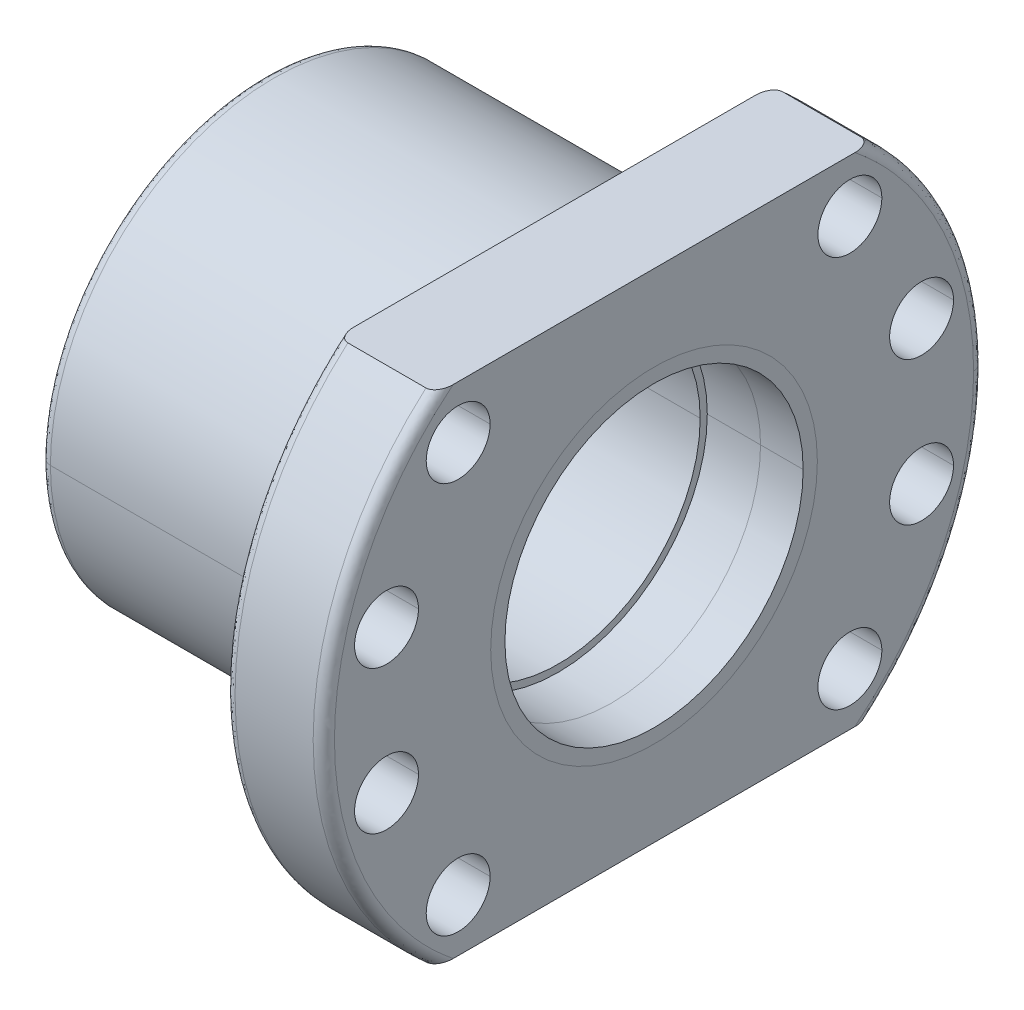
ISO-10303-21;
HEADER;
FILE_DESCRIPTION(('STEP AP214'),'2;1');
FILE_NAME('part.step','',(''),(''),'','','');
FILE_SCHEMA(('AUTOMOTIVE_DESIGN { 1 0 10303 214 1 1 1 1 }'));
ENDSEC;
DATA;
#1=APPLICATION_CONTEXT('core data for automotive mechanical design processes');
#2=APPLICATION_PROTOCOL_DEFINITION('international standard','automotive_design',2000,#1);
#3=PRODUCT_CONTEXT('',#1,'mechanical');
#4=PRODUCT('Part','Part','',(#3));
#5=PRODUCT_RELATED_PRODUCT_CATEGORY('part','',(#4));
#6=PRODUCT_DEFINITION_FORMATION('','',#4);
#7=PRODUCT_DEFINITION_CONTEXT('part definition',#1,'design');
#8=PRODUCT_DEFINITION('design','',#6,#7);
#9=PRODUCT_DEFINITION_SHAPE('','',#8);
#10=(LENGTH_UNIT() NAMED_UNIT(*) SI_UNIT(.MILLI.,.METRE.));
#11=(NAMED_UNIT(*) PLANE_ANGLE_UNIT() SI_UNIT($,.RADIAN.));
#12=(NAMED_UNIT(*) SI_UNIT($,.STERADIAN.) SOLID_ANGLE_UNIT());
#13=UNCERTAINTY_MEASURE_WITH_UNIT(LENGTH_MEASURE(1.E-05),#10,'distance_accuracy_value','');
#14=(GEOMETRIC_REPRESENTATION_CONTEXT(3) GLOBAL_UNCERTAINTY_ASSIGNED_CONTEXT((#13)) GLOBAL_UNIT_ASSIGNED_CONTEXT((#10,
#11,#12)) REPRESENTATION_CONTEXT('',''));
#15=CARTESIAN_POINT('',(0.,0.,0.));
#16=DIRECTION('',(0.,0.,1.));
#17=DIRECTION('',(1.,0.,0.));
#18=AXIS2_PLACEMENT_3D('',#15,#16,#17);
#19=CARTESIAN_POINT('',(0.,0.,0.));
#20=DIRECTION('',(-1.,0.,0.));
#21=DIRECTION('',(0.,0.,1.));
#22=AXIS2_PLACEMENT_3D('',#19,#20,#21);
#23=CYLINDRICAL_SURFACE('',#22,20.);
#24=DIRECTION('',(-1.,0.,0.));
#25=VECTOR('',#24,1.);
#26=CARTESIAN_POINT('',(0.,0.,-20.));
#27=LINE('',#26,#25);
#28=CARTESIAN_POINT('',(-33.5,0.,-20.));
#29=VERTEX_POINT('',#28);
#30=CARTESIAN_POINT('',(-73.5,0.,-20.));
#31=VERTEX_POINT('',#30);
#32=EDGE_CURVE('P0_E886',#29,#31,#27,.T.);
#33=ORIENTED_EDGE('',*,*,#32,.F.);
#34=CARTESIAN_POINT('',(-33.5,0.,0.));
#35=DIRECTION('',(-1.,0.,0.));
#36=DIRECTION('',(0.,0.,-1.));
#37=AXIS2_PLACEMENT_3D('',#34,#35,#36);
#38=CIRCLE('',#37,20.);
#39=CARTESIAN_POINT('',(-33.5,0.,20.));
#40=VERTEX_POINT('',#39);
#41=EDGE_CURVE('P0_E1092',#40,#29,#38,.T.);
#42=ORIENTED_EDGE('',*,*,#41,.F.);
#43=DIRECTION('',(-1.,0.,0.));
#44=VECTOR('',#43,1.);
#45=CARTESIAN_POINT('',(0.,0.,20.));
#46=LINE('',#45,#44);
#47=CARTESIAN_POINT('',(-73.5,0.,20.));
#48=VERTEX_POINT('',#47);
#49=EDGE_CURVE('P0_E868',#40,#48,#46,.T.);
#50=ORIENTED_EDGE('',*,*,#49,.T.);
#51=CARTESIAN_POINT('',(-73.5,0.,0.));
#52=DIRECTION('',(-1.,0.,0.));
#53=DIRECTION('',(0.,0.,-1.));
#54=AXIS2_PLACEMENT_3D('',#51,#52,#53);
#55=CIRCLE('',#54,20.);
#56=EDGE_CURVE('P0_E1143',#48,#31,#55,.T.);
#57=ORIENTED_EDGE('',*,*,#56,.T.);
#58=EDGE_LOOP('',(#33,#42,#50,#57));
#59=FACE_BOUND('',#58,.T.);
#60=ADVANCED_FACE('P0_F17',(#59),#23,.F.);
#61=CARTESIAN_POINT('',(-73.5,0.,31.5));
#62=CARTESIAN_POINT('',(-73.5,-63.,31.5));
#63=CARTESIAN_POINT('',(-73.5,-63.,-31.5));
#64=CARTESIAN_POINT('',(-73.5,0.,-31.5));
#65=CARTESIAN_POINT('',(-74.3786796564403,0.,31.5));
#66=CARTESIAN_POINT('',(-74.3786796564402,-63.,31.5));
#67=CARTESIAN_POINT('',(-74.3786796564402,-63.,-31.5));
#68=CARTESIAN_POINT('',(-74.3786796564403,0.,-31.5));
#69=CARTESIAN_POINT('',(-74.9999999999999,0.,30.8786796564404));
#70=CARTESIAN_POINT('',(-75.,-61.7573593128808,30.8786796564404));
#71=CARTESIAN_POINT('',(-75.,-61.7573593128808,-30.8786796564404));
#72=CARTESIAN_POINT('',(-74.9999999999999,0.,-30.8786796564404));
#73=CARTESIAN_POINT('',(-75.,0.,30.));
#74=CARTESIAN_POINT('',(-75.,-60.,30.));
#75=CARTESIAN_POINT('',(-75.,-60.,-30.));
#76=CARTESIAN_POINT('',(-75.,0.,-30.));
#77=(BOUNDED_SURFACE() B_SPLINE_SURFACE(3,3,((#61,#62,#63,#64),(#65,#66,#67,#68),(#69,#70,#71,
#72),(#73,#74,#75,#76)),.UNSPECIFIED.,.F.,.F.,.F.) B_SPLINE_SURFACE_WITH_KNOTS((4,4),(4,4),(0.,
1.),(0.,1.),.UNSPECIFIED.) GEOMETRIC_REPRESENTATION_ITEM() RATIONAL_B_SPLINE_SURFACE(((1.,
0.333333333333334,0.333333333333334,1.),(0.80473785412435,0.268245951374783,0.268245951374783,
0.80473785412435),(0.80473785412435,0.268245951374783,0.268245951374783,0.80473785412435),(1.,
0.333333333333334,0.333333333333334,1.))) REPRESENTATION_ITEM('') SURFACE());
#78=CARTESIAN_POINT('',(-73.5,0.,0.));
#79=DIRECTION('',(1.,0.,0.));
#80=DIRECTION('',(0.,0.,-1.));
#81=AXIS2_PLACEMENT_3D('',#78,#79,#80);
#82=CIRCLE('',#81,31.4999999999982);
#83=CARTESIAN_POINT('',(-73.5,0.,31.4999999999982));
#84=VERTEX_POINT('',#83);
#85=CARTESIAN_POINT('',(-73.5,0.,-31.4999999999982));
#86=VERTEX_POINT('',#85);
#87=EDGE_CURVE('P0_E11',#84,#86,#82,.T.);
#88=CARTESIAN_POINT('',(-73.5,0.,30.));
#89=DIRECTION('',(0.,-1.,0.));
#90=DIRECTION('',(0.,0.,1.));
#91=AXIS2_PLACEMENT_3D('',#88,#89,#90);
#92=CIRCLE('',#91,1.5);
#93=CARTESIAN_POINT('',(-75.,0.,30.));
#94=VERTEX_POINT('',#93);
#95=EDGE_CURVE('P0_E1123',#84,#94,#92,.T.);
#96=CARTESIAN_POINT('',(-75.,0.,30.));
#97=CARTESIAN_POINT('',(-75.,-60.,30.));
#98=CARTESIAN_POINT('',(-75.,-60.,-30.));
#99=CARTESIAN_POINT('',(-75.,0.,-30.));
#100=(BOUNDED_CURVE() B_SPLINE_CURVE(3,(#96,#97,#98,#99),.UNSPECIFIED.,.F.,
.F.) B_SPLINE_CURVE_WITH_KNOTS((4,4),(0.,1.),
.UNSPECIFIED.) CURVE() GEOMETRIC_REPRESENTATION_ITEM() RATIONAL_B_SPLINE_CURVE((1.,
0.333333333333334,0.333333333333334,1.)) REPRESENTATION_ITEM(''));
#101=CARTESIAN_POINT('',(-75.,0.,-30.));
#102=VERTEX_POINT('',#101);
#103=EDGE_CURVE('P0_E792',#94,#102,#100,.T.);
#104=CARTESIAN_POINT('',(-73.5,0.,-30.));
#105=DIRECTION('',(0.,1.,0.));
#106=DIRECTION('',(0.,0.,-1.));
#107=AXIS2_PLACEMENT_3D('',#104,#105,#106);
#108=CIRCLE('',#107,1.5);
#109=EDGE_CURVE('P0_E1115',#86,#102,#108,.T.);
#110=ORIENTED_EDGE('',*,*,#87,.F.);
#111=ORIENTED_EDGE('',*,*,#95,.T.);
#112=ORIENTED_EDGE('',*,*,#103,.T.);
#113=ORIENTED_EDGE('',*,*,#109,.F.);
#114=EDGE_LOOP('',(#110,#111,#112,#113));
#115=FACE_BOUND('',#114,.T.);
#116=ADVANCED_FACE('P0_F369',(#115),#77,.T.);
#117=CARTESIAN_POINT('',(-20.,0.,-45.));
#118=CARTESIAN_POINT('',(-20.,13.9178534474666,-45.));
#119=CARTESIAN_POINT('',(-20.,26.460811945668,-38.9683471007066));
#120=CARTESIAN_POINT('',(-20.,35.1507275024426,-28.0967321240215));
#121=CARTESIAN_POINT('',(-20.,0.,-45.8786796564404));
#122=CARTESIAN_POINT('',(-20.,14.1896164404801,-45.8786796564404));
#123=CARTESIAN_POINT('',(-20.,26.9774914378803,-39.7292514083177));
#124=CARTESIAN_POINT('',(-20.,35.8370881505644,-28.6453549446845));
#125=CARTESIAN_POINT('',(-20.6213203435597,0.,-46.5));
#126=CARTESIAN_POINT('',(-20.6213203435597,14.3817818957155,-46.5));
#127=CARTESIAN_POINT('',(-20.6213203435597,27.3428390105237,-40.2672920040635));
#128=CARTESIAN_POINT('',(-20.6213203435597,36.3224184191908,-29.0332898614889));
#129=CARTESIAN_POINT('',(-21.5,0.,-46.5));
#130=CARTESIAN_POINT('',(-21.5,14.3817818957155,-46.5));
#131=CARTESIAN_POINT('',(-21.5,27.3428390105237,-40.2672920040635));
#132=CARTESIAN_POINT('',(-21.5,36.3224184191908,-29.0332898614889));
#133=(BOUNDED_SURFACE() B_SPLINE_SURFACE(3,3,((#117,#118,#119,#120),(#121,#122,#123,#124),(#125,
#126,#127,#128),(#129,#130,#131,#132)),.UNSPECIFIED.,.F.,.F.,
.F.) B_SPLINE_SURFACE_WITH_KNOTS((4,4),(4,4),(0.,1.),(0.,1.),
.UNSPECIFIED.) GEOMETRIC_REPRESENTATION_ITEM() RATIONAL_B_SPLINE_SURFACE(((1.,0.93414238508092,
0.93414238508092,1.),(0.804737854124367,0.751739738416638,0.751739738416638,0.804737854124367),
(0.804737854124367,0.751739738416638,0.751739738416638,0.804737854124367),(1.,0.93414238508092,
0.93414238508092,1.))) REPRESENTATION_ITEM('') SURFACE());
#134=CARTESIAN_POINT('',(-20.,0.,-45.));
#135=CARTESIAN_POINT('',(-20.,1.55237196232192,-45.));
#136=CARTESIAN_POINT('',(-20.,3.87005069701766,-44.8804974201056));
#137=CARTESIAN_POINT('',(-20.,6.55497060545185,-44.5319482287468));
#138=CARTESIAN_POINT('',(-20.,7.70157086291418,-44.3377565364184));
#139=CARTESIAN_POINT('',(-20.,8.13103599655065,-44.2593329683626));
#140=CARTESIAN_POINT('',(-20.,8.17817472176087,-44.2506505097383));
#141=CARTESIAN_POINT('',(-20.,8.27931432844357,-44.2318409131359));
#142=CARTESIAN_POINT('',(-20.,8.43095125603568,-44.203373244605));
#143=CARTESIAN_POINT('',(-20.,8.78426337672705,-44.1351757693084));
#144=CARTESIAN_POINT('',(-20.,10.6967347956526,-43.7457121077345));
#145=CARTESIAN_POINT('',(-20.,13.2685719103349,-43.054719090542));
#146=CARTESIAN_POINT('',(-20.,15.5869088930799,-42.2223652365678));
#147=CARTESIAN_POINT('',(-20.,16.4493269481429,-41.8859182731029));
#148=CARTESIAN_POINT('',(-20.,16.5442764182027,-41.8485158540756));
#149=CARTESIAN_POINT('',(-20.,16.7434440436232,-41.769235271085));
#150=CARTESIAN_POINT('',(-20.,17.0416705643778,-41.6492983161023));
#151=CARTESIAN_POINT('',(-20.,17.7338580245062,-41.3623328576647));
#152=CARTESIAN_POINT('',(-20.,19.8862079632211,-40.4157338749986));
#153=CARTESIAN_POINT('',(-20.,22.1502392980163,-39.2205075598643));
#154=CARTESIAN_POINT('',(-20.,24.0577782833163,-38.0324332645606));
#155=CARTESIAN_POINT('',(-20.,24.5075799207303,-37.7410910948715));
#156=CARTESIAN_POINT('',(-20.,24.6871506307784,-37.623876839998));
#157=CARTESIAN_POINT('',(-20.,24.7799469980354,-37.5628358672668));
#158=CARTESIAN_POINT('',(-20.,25.0535575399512,-37.3814090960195));
#159=CARTESIAN_POINT('',(-20.,25.9605850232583,-36.7704744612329));
#160=CARTESIAN_POINT('',(-20.,28.2537569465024,-35.1017209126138));
#161=CARTESIAN_POINT('',(-20.,30.226310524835,-33.383385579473));
#162=CARTESIAN_POINT('',(-20.,32.1027171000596,-31.5464186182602));
#163=CARTESIAN_POINT('',(-20.,32.7105919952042,-30.9158907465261));
#164=CARTESIAN_POINT('',(-20.,33.8850241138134,-29.624538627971));
#165=CARTESIAN_POINT('',(-20.,34.4525042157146,-28.9627937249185));
#166=CARTESIAN_POINT('',(-20.,35.,-28.2847792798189));
#167=(BOUNDED_CURVE() B_SPLINE_CURVE(3,(#134,#135,#136,#137,#138,#139,#140,#141,#142,#143,#144,
#145,#146,#147,#148,#149,#150,#151,#152,#153,#154,#155,#156,#157,#158,#159,#160,#161,#162,#163,
#164,#165,#166),.UNSPECIFIED.,.F.,.F.) B_SPLINE_CURVE_WITH_KNOTS((4,1,1,2,2,1,1,1,1,2,2,1,1,1,1,
1,2,2,1,1,2,2,4),(0.,0.0352524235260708,0.0528786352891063,0.0616917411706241,
0.0627933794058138,0.0638950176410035,0.066098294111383,0.070504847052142,0.105757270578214,
0.12338348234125,0.12558675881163,0.127790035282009,0.132196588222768,0.141009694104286,
0.176262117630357,0.185075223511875,0.187278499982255,0.189481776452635,0.193888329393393,
0.21151454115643,0.246766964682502,0.264393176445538,0.282019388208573),
.UNSPECIFIED.) CURVE() GEOMETRIC_REPRESENTATION_ITEM() RATIONAL_B_SPLINE_CURVE((1.,1.,1.,1.,1.,
1.,1.,1.,1.,1.,1.,1.,1.,1.,1.,1.,1.,1.,1.,1.,1.,1.,1.,1.,1.,1.,1.,1.,1.,1.,1.,1.,1.)) REPRESENTATION_ITEM(''));
#168=CARTESIAN_POINT('',(-20.,0.,-45.));
#169=VERTEX_POINT('',#168);
#170=CARTESIAN_POINT('',(-20.,35.,-28.2847792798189));
#171=VERTEX_POINT('',#170);
#172=EDGE_CURVE('P0_E293',#169,#171,#167,.T.);
#173=CARTESIAN_POINT('',(-21.5,0.,-45.));
#174=DIRECTION('',(0.,1.,0.));
#175=DIRECTION('',(0.,0.,-1.));
#176=AXIS2_PLACEMENT_3D('',#173,#174,#175);
#177=CIRCLE('',#176,1.5);
#178=CARTESIAN_POINT('',(-21.5,0.,-46.5));
#179=VERTEX_POINT('',#178);
#180=EDGE_CURVE('P0_E464',#169,#179,#177,.T.);
#181=CARTESIAN_POINT('',(-21.5,0.,0.));
#182=DIRECTION('',(1.,0.,0.));
#183=DIRECTION('',(0.,0.,-1.));
#184=AXIS2_PLACEMENT_3D('',#181,#182,#183);
#185=CIRCLE('',#184,46.5);
#186=CARTESIAN_POINT('',(-21.5,35.,-30.6145390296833));
#187=VERTEX_POINT('',#186);
#188=EDGE_CURVE('P0_E552',#179,#187,#185,.T.);
#189=CARTESIAN_POINT('',(-21.5,35.,-30.6145390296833));
#190=CARTESIAN_POINT('',(-21.4896240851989,35.0000000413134,-30.6145391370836));
#191=CARTESIAN_POINT('',(-21.479248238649,35.0000013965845,-30.6143739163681));
#192=CARTESIAN_POINT('',(-21.4584748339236,35.0000056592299,-30.613714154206));
#193=CARTESIAN_POINT('',(-21.4480773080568,35.0000085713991,-30.613218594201));
#194=CARTESIAN_POINT('',(-21.4272677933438,35.0000148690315,-30.6118972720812));
#195=CARTESIAN_POINT('',(-21.416855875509,35.00001825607,-30.6110703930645));
#196=CARTESIAN_POINT('',(-21.3960248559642,35.0000247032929,-30.60908592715));
#197=CARTESIAN_POINT('',(-21.3856058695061,35.0000277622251,-30.6079271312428));
#198=CARTESIAN_POINT('',(-21.3647680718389,35.000032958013,-30.6052785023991));
#199=CARTESIAN_POINT('',(-21.3543494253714,35.0000350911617,-30.603787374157));
#200=CARTESIAN_POINT('',(-21.3335197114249,35.0000380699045,-30.6004739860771));
#201=CARTESIAN_POINT('',(-21.323108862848,35.0000389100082,-30.5986503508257));
#202=CARTESIAN_POINT('',(-21.3023021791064,35.000039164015,-30.594672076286));
#203=CARTESIAN_POINT('',(-21.2919066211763,35.0000385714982,-30.5925159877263));
#204=CARTESIAN_POINT('',(-21.2711379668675,35.000036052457,-30.5878731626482));
#205=CARTESIAN_POINT('',(-21.2607652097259,35.0000341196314,-30.5853849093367));
#206=CARTESIAN_POINT('',(-21.2400495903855,35.0000292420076,-30.5800783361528));
#207=CARTESIAN_POINT('',(-21.2297071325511,35.0000262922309,-30.5772584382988));
#208=CARTESIAN_POINT('',(-21.2090595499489,35.000019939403,-30.5712893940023));
#209=CARTESIAN_POINT('',(-21.1987548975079,35.0000165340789,-30.5681386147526));
#210=CARTESIAN_POINT('',(-21.1781902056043,35.0000100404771,-30.5615088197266));
#211=CARTESIAN_POINT('',(-21.1679307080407,35.000006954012,-30.5580281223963));
#212=CARTESIAN_POINT('',(-21.147463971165,35.0000021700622,-30.5507398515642));
#213=CARTESIAN_POINT('',(-21.1372573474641,35.0000004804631,-30.5469305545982));
#214=CARTESIAN_POINT('',(-21.1083028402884,34.9999991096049,-30.5356299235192));
#215=CARTESIAN_POINT('',(-21.0896974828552,35.0000023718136,-30.5277700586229));
#216=CARTESIAN_POINT('',(-21.0525569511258,35.0000103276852,-30.5109075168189));
#217=CARTESIAN_POINT('',(-21.0340308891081,35.0000150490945,-30.5018848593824));
#218=CARTESIAN_POINT('',(-20.9970920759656,35.0000222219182,-30.4826956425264));
#219=CARTESIAN_POINT('',(-20.9786896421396,35.0000246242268,-30.4725092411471));
#220=CARTESIAN_POINT('',(-20.942043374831,35.0000253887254,-30.4509946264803));
#221=CARTESIAN_POINT('',(-20.9238110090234,35.0000236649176,-30.4396469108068));
#222=CARTESIAN_POINT('',(-20.8875508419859,35.0000180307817,-30.4158132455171));
#223=CARTESIAN_POINT('',(-20.8695355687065,35.000014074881,-30.4033082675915));
#224=CARTESIAN_POINT('',(-20.8337528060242,35.0000039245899,-30.3771688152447));
#225=CARTESIAN_POINT('',(-20.8159987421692,34.9999976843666,-30.3635159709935));
#226=CARTESIAN_POINT('',(-20.7843774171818,35.000001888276,-30.3379771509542));
#227=CARTESIAN_POINT('',(-20.7703975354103,35.0000094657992,-30.3262301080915));
#228=CARTESIAN_POINT('',(-20.742491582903,35.0000375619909,-30.3018777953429));
#229=CARTESIAN_POINT('',(-20.7285785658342,35.0000584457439,-30.2892575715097));
#230=CARTESIAN_POINT('',(-20.7008351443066,35.0001032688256,-30.2631572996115));
#231=CARTESIAN_POINT('',(-20.6870181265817,35.0001272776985,-30.2496630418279));
#232=CARTESIAN_POINT('',(-20.659498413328,35.0001734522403,-30.2218117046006));
#233=CARTESIAN_POINT('',(-20.6458094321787,35.0001955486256,-30.2074410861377));
#234=CARTESIAN_POINT('',(-20.618578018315,35.0002333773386,-30.177836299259));
#235=CARTESIAN_POINT('',(-20.6050495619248,35.0002489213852,-30.1625892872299));
#236=CARTESIAN_POINT('',(-20.5781723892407,35.0002709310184,-30.1312323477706));
#237=CARTESIAN_POINT('',(-20.5648378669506,35.000277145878,-30.1151102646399));
#238=CARTESIAN_POINT('',(-20.5383823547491,35.0002793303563,-30.0820055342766));
#239=CARTESIAN_POINT('',(-20.5252757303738,35.0002750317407,-30.0650114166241));
#240=CARTESIAN_POINT('',(-20.4993102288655,35.0002567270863,-30.0301666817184));
#241=CARTESIAN_POINT('',(-20.4864658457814,35.0002424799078,-30.0123052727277));
#242=CARTESIAN_POINT('',(-20.4610592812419,35.0002067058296,-29.9757317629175));
#243=CARTESIAN_POINT('',(-20.4485116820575,35.0001850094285,-29.9570095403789));
#244=CARTESIAN_POINT('',(-20.4237329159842,35.000138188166,-29.9187221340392));
#245=CARTESIAN_POINT('',(-20.4115163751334,35.0001129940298,-29.8991474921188));
#246=CARTESIAN_POINT('',(-20.387434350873,35.0000665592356,-29.8591643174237));
#247=CARTESIAN_POINT('',(-20.375583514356,35.0000454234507,-29.838746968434));
#248=CARTESIAN_POINT('',(-20.3522642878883,35.0000100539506,-29.7970910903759));
#249=CARTESIAN_POINT('',(-20.3408104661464,34.9999959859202,-29.7758444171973));
#250=CARTESIAN_POINT('',(-20.3136697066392,35.0000057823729,-29.7235684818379));
#251=CARTESIAN_POINT('',(-20.298340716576,35.0000490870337,-29.6923529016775));
#252=CARTESIAN_POINT('',(-20.2676976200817,35.0001557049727,-29.6265500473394));
#253=CARTESIAN_POINT('',(-20.2525029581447,35.0002204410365,-29.591907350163));
#254=CARTESIAN_POINT('',(-20.2224247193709,35.0003171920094,-29.5192364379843));
#255=CARTESIAN_POINT('',(-20.207662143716,35.0003461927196,-29.4811582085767));
#256=CARTESIAN_POINT('',(-20.1787687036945,35.0003530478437,-29.4016299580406));
#257=CARTESIAN_POINT('',(-20.1647608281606,35.0003270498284,-29.3601353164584));
#258=CARTESIAN_POINT('',(-20.1377097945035,35.0002394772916,-29.2738211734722));
#259=CARTESIAN_POINT('',(-20.1247910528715,35.0001756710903,-29.2289627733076));
#260=CARTESIAN_POINT('',(-20.100251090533,35.0000495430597,-29.1360015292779));
#261=CARTESIAN_POINT('',(-20.088754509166,34.9999875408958,-29.0878657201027));
#262=CARTESIAN_POINT('',(-20.0721834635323,35.0000074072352,-29.0107402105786));
#263=CARTESIAN_POINT('',(-20.0663951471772,35.0000411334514,-28.981901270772));
#264=CARTESIAN_POINT('',(-20.0531852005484,35.0000843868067,-28.9113978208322));
#265=CARTESIAN_POINT('',(-20.0461613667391,35.0000768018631,-28.869658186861));
#266=CARTESIAN_POINT('',(-20.0317655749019,35.0000399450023,-28.7734982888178));
#267=CARTESIAN_POINT('',(-20.0249117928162,35.0000048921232,-28.7190000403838));
#268=CARTESIAN_POINT('',(-20.0142168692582,34.9999617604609,-28.6148553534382));
#269=CARTESIAN_POINT('',(-20.0101540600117,34.9999514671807,-28.5652314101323));
#270=CARTESIAN_POINT('',(-20.0044956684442,34.9999469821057,-28.4734359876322));
#271=CARTESIAN_POINT('',(-20.0026183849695,34.9999505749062,-28.4312816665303));
#272=CARTESIAN_POINT('',(-20.0004866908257,34.9999691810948,-28.3543403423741));
#273=CARTESIAN_POINT('',(-20.0000051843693,34.999982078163,-28.319559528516));
#274=CARTESIAN_POINT('',(-20.0000000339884,34.9999999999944,-28.2847792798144));
#275=B_SPLINE_CURVE_WITH_KNOTS('',3,(#189,#190,#191,#192,#193,#194,#195,#196,#197,#198,#199,
#200,#201,#202,#203,#204,#205,#206,#207,#208,#209,#210,#211,#212,#213,#214,#215,#216,#217,#218,
#219,#220,#221,#222,#223,#224,#225,#226,#227,#228,#229,#230,#231,#232,#233,#234,#235,#236,#237,
#238,#239,#240,#241,#242,#243,#244,#245,#246,#247,#248,#249,#250,#251,#252,#253,#254,#255,#256,
#257,#258,#259,#260,#261,#262,#263,#264,#265,#266,#267,#268,#269,#270,#271,#272,#273,#274),
.UNSPECIFIED.,.F.,.F.,(4,2,2,2,2,2,2,2,2,2,2,2,2,2,2,2,2,2,2,2,2,2,2,2,2,2,2,2,2,2,2,2,2,2,2,2,
2,2,2,2,2,2,4),(0.,0.0311263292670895,0.0623490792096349,0.0936779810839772,0.125122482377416,
0.156691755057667,0.188394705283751,0.220239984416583,0.252236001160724,0.284390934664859,
0.316712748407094,0.349209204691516,0.381887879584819,0.442448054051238,0.504239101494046,
0.567311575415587,0.631710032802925,0.697473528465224,0.764636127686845,0.819403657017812,
0.875742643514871,0.933669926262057,0.993198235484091,1.05433651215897,1.11709021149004,
1.18146159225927,1.24744999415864,1.31505210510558,1.38426222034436,1.45507249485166,
1.52747319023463,1.63176803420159,1.74521877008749,1.86769864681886,1.99904036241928,
2.13903787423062,2.28744902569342,2.37568300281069,2.50263355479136,2.66735486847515,
2.81668393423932,2.94324824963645,3.04758707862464),.UNSPECIFIED.);
#276=EDGE_CURVE('P0_E560',#187,#171,#275,.T.);
#277=ORIENTED_EDGE('',*,*,#172,.F.);
#278=ORIENTED_EDGE('',*,*,#180,.T.);
#279=ORIENTED_EDGE('',*,*,#188,.T.);
#280=ORIENTED_EDGE('',*,*,#276,.T.);
#281=EDGE_LOOP('',(#277,#278,#279,#280));
#282=FACE_BOUND('',#281,.T.);
#283=ADVANCED_FACE('P0_F572',(#282),#133,.T.);
#284=CARTESIAN_POINT('',(-95.,0.,0.));
#285=DIRECTION('',(1.,0.,0.));
#286=DIRECTION('',(0.,0.,-1.));
#287=AXIS2_PLACEMENT_3D('',#284,#285,#286);
#288=CYLINDRICAL_SURFACE('',#287,23.);
#289=CARTESIAN_POINT('',(-26.,0.,0.));
#290=DIRECTION('',(1.,0.,0.));
#291=DIRECTION('',(0.,0.,-1.));
#292=AXIS2_PLACEMENT_3D('',#289,#290,#291);
#293=CIRCLE('',#292,23.);
#294=CARTESIAN_POINT('',(-26.,0.,23.));
#295=VERTEX_POINT('',#294);
#296=CARTESIAN_POINT('',(-26.,0.,-23.));
#297=VERTEX_POINT('',#296);
#298=EDGE_CURVE('P0_E1049',#295,#297,#293,.T.);
#299=ORIENTED_EDGE('',*,*,#298,.F.);
#300=DIRECTION('',(1.,0.,0.));
#301=VECTOR('',#300,1.);
#302=CARTESIAN_POINT('',(-95.,0.,23.));
#303=LINE('',#302,#301);
#304=CARTESIAN_POINT('',(-20.,0.,23.));
#305=VERTEX_POINT('',#304);
#306=EDGE_CURVE('P0_E837',#295,#305,#303,.T.);
#307=ORIENTED_EDGE('',*,*,#306,.T.);
#308=CARTESIAN_POINT('',(-20.,0.,0.));
#309=DIRECTION('',(-1.,0.,0.));
#310=DIRECTION('',(0.,0.,-1.));
#311=AXIS2_PLACEMENT_3D('',#308,#309,#310);
#312=CIRCLE('',#311,23.);
#313=CARTESIAN_POINT('',(-20.,0.,-23.));
#314=VERTEX_POINT('',#313);
#315=EDGE_CURVE('P0_E772',#314,#305,#312,.T.);
#316=ORIENTED_EDGE('',*,*,#315,.F.);
#317=DIRECTION('',(1.,0.,0.));
#318=VECTOR('',#317,1.);
#319=CARTESIAN_POINT('',(-95.,0.,-23.));
#320=LINE('',#319,#318);
#321=EDGE_CURVE('P0_E312',#297,#314,#320,.T.);
#322=ORIENTED_EDGE('',*,*,#321,.F.);
#323=EDGE_LOOP('',(#299,#307,#316,#322));
#324=FACE_BOUND('',#323,.T.);
#325=ADVANCED_FACE('P0_F583',(#324),#288,.F.);
#326=CARTESIAN_POINT('',(-20.,10.09,37.67));
#327=DIRECTION('',(-1.,0.,0.));
#328=DIRECTION('',(0.,0.,1.));
#329=AXIS2_PLACEMENT_3D('',#326,#327,#328);
#330=CYLINDRICAL_SURFACE('',#329,4.5);
#331=CARTESIAN_POINT('',(-20.,10.09,37.67));
#332=DIRECTION('',(-1.,0.,0.));
#333=DIRECTION('',(0.,0.,1.));
#334=AXIS2_PLACEMENT_3D('',#331,#332,#333);
#335=CIRCLE('',#334,4.5);
#336=CARTESIAN_POINT('',(-20.,10.09,33.17));
#337=VERTEX_POINT('',#336);
#338=CARTESIAN_POINT('',(-20.,10.09,42.17));
#339=VERTEX_POINT('',#338);
#340=EDGE_CURVE('P0_E775',#337,#339,#335,.T.);
#341=ORIENTED_EDGE('',*,*,#340,.F.);
#342=DIRECTION('',(-1.,0.,0.));
#343=VECTOR('',#342,1.);
#344=CARTESIAN_POINT('',(-20.,10.09,33.17));
#345=LINE('',#344,#343);
#346=CARTESIAN_POINT('',(-34.,10.09,33.17));
#347=VERTEX_POINT('',#346);
#348=EDGE_CURVE('P0_E1285',#337,#347,#345,.T.);
#349=ORIENTED_EDGE('',*,*,#348,.T.);
#350=CARTESIAN_POINT('',(-34.,10.09,37.67));
#351=DIRECTION('',(1.,0.,0.));
#352=DIRECTION('',(0.,0.,1.));
#353=AXIS2_PLACEMENT_3D('',#350,#351,#352);
#354=CIRCLE('',#353,4.5);
#355=CARTESIAN_POINT('',(-34.,10.09,42.17));
#356=VERTEX_POINT('',#355);
#357=EDGE_CURVE('P0_E1312',#356,#347,#354,.T.);
#358=ORIENTED_EDGE('',*,*,#357,.F.);
#359=DIRECTION('',(-1.,0.,0.));
#360=VECTOR('',#359,1.);
#361=CARTESIAN_POINT('',(-20.,10.09,42.17));
#362=LINE('',#361,#360);
#363=EDGE_CURVE('P0_E1303',#339,#356,#362,.T.);
#364=ORIENTED_EDGE('',*,*,#363,.F.);
#365=EDGE_LOOP('',(#341,#349,#358,#364));
#366=FACE_BOUND('',#365,.T.);
#367=ADVANCED_FACE('P0_F591',(#366),#330,.F.);
#368=CARTESIAN_POINT('',(-20.,-10.09,37.67));
#369=DIRECTION('',(-1.,0.,0.));
#370=DIRECTION('',(0.,0.,1.));
#371=AXIS2_PLACEMENT_3D('',#368,#369,#370);
#372=CYLINDRICAL_SURFACE('',#371,4.5);
#373=CARTESIAN_POINT('',(-20.,-10.09,37.67));
#374=DIRECTION('',(-1.,0.,0.));
#375=DIRECTION('',(0.,0.,1.));
#376=AXIS2_PLACEMENT_3D('',#373,#374,#375);
#377=CIRCLE('',#376,4.5);
#378=CARTESIAN_POINT('',(-20.,-10.09,33.17));
#379=VERTEX_POINT('',#378);
#380=CARTESIAN_POINT('',(-20.,-10.09,42.17));
#381=VERTEX_POINT('',#380);
#382=EDGE_CURVE('P0_E1159',#379,#381,#377,.T.);
#383=ORIENTED_EDGE('',*,*,#382,.F.);
#384=DIRECTION('',(-1.,0.,0.));
#385=VECTOR('',#384,1.);
#386=CARTESIAN_POINT('',(-20.,-10.09,33.17));
#387=LINE('',#386,#385);
#388=CARTESIAN_POINT('',(-34.,-10.09,33.17));
#389=VERTEX_POINT('',#388);
#390=EDGE_CURVE('P0_E1243',#379,#389,#387,.T.);
#391=ORIENTED_EDGE('',*,*,#390,.T.);
#392=CARTESIAN_POINT('',(-34.,-10.09,37.67));
#393=DIRECTION('',(1.,0.,0.));
#394=DIRECTION('',(0.,0.,1.));
#395=AXIS2_PLACEMENT_3D('',#392,#393,#394);
#396=CIRCLE('',#395,4.5);
#397=CARTESIAN_POINT('',(-34.,-10.09,42.17));
#398=VERTEX_POINT('',#397);
#399=EDGE_CURVE('P0_E1309',#398,#389,#396,.T.);
#400=ORIENTED_EDGE('',*,*,#399,.F.);
#401=DIRECTION('',(-1.,0.,0.));
#402=VECTOR('',#401,1.);
#403=CARTESIAN_POINT('',(-20.,-10.09,42.17));
#404=LINE('',#403,#402);
#405=EDGE_CURVE('P0_E1286',#381,#398,#404,.T.);
#406=ORIENTED_EDGE('',*,*,#405,.F.);
#407=EDGE_LOOP('',(#383,#391,#400,#406));
#408=FACE_BOUND('',#407,.T.);
#409=ADVANCED_FACE('P0_F595',(#408),#372,.F.);
#410=CARTESIAN_POINT('',(-20.,-10.09,-37.67));
#411=DIRECTION('',(-1.,0.,0.));
#412=DIRECTION('',(0.,0.,1.));
#413=AXIS2_PLACEMENT_3D('',#410,#411,#412);
#414=CYLINDRICAL_SURFACE('',#413,4.5);
#415=CARTESIAN_POINT('',(-20.,-10.09,-37.67));
#416=DIRECTION('',(-1.,0.,0.));
#417=DIRECTION('',(0.,0.,1.));
#418=AXIS2_PLACEMENT_3D('',#415,#416,#417);
#419=CIRCLE('',#418,4.5);
#420=CARTESIAN_POINT('',(-20.,-10.09,-42.17));
#421=VERTEX_POINT('',#420);
#422=CARTESIAN_POINT('',(-20.,-10.09,-33.17));
#423=VERTEX_POINT('',#422);
#424=EDGE_CURVE('P0_E1261',#421,#423,#419,.T.);
#425=ORIENTED_EDGE('',*,*,#424,.F.);
#426=DIRECTION('',(-1.,0.,0.));
#427=VECTOR('',#426,1.);
#428=CARTESIAN_POINT('',(-20.,-10.09,-42.17));
#429=LINE('',#428,#427);
#430=CARTESIAN_POINT('',(-34.,-10.09,-42.17));
#431=VERTEX_POINT('',#430);
#432=EDGE_CURVE('P0_E1210',#421,#431,#429,.T.);
#433=ORIENTED_EDGE('',*,*,#432,.T.);
#434=CARTESIAN_POINT('',(-34.,-10.09,-37.67));
#435=DIRECTION('',(1.,0.,0.));
#436=DIRECTION('',(0.,0.,1.));
#437=AXIS2_PLACEMENT_3D('',#434,#435,#436);
#438=CIRCLE('',#437,4.5);
#439=CARTESIAN_POINT('',(-34.,-10.09,-33.17));
#440=VERTEX_POINT('',#439);
#441=EDGE_CURVE('P0_E1313',#440,#431,#438,.T.);
#442=ORIENTED_EDGE('',*,*,#441,.F.);
#443=DIRECTION('',(-1.,0.,0.));
#444=VECTOR('',#443,1.);
#445=CARTESIAN_POINT('',(-20.,-10.09,-33.17));
#446=LINE('',#445,#444);
#447=EDGE_CURVE('P0_E1244',#423,#440,#446,.T.);
#448=ORIENTED_EDGE('',*,*,#447,.F.);
#449=EDGE_LOOP('',(#425,#433,#442,#448));
#450=FACE_BOUND('',#449,.T.);
#451=ADVANCED_FACE('P0_F599',(#450),#414,.F.);
#452=CARTESIAN_POINT('',(-20.,10.09,-37.67));
#453=DIRECTION('',(-1.,0.,0.));
#454=DIRECTION('',(0.,0.,1.));
#455=AXIS2_PLACEMENT_3D('',#452,#453,#454);
#456=CYLINDRICAL_SURFACE('',#455,4.5);
#457=CARTESIAN_POINT('',(-20.,10.09,-37.67));
#458=DIRECTION('',(-1.,0.,0.));
#459=DIRECTION('',(0.,0.,1.));
#460=AXIS2_PLACEMENT_3D('',#457,#458,#459);
#461=CIRCLE('',#460,4.5);
#462=CARTESIAN_POINT('',(-20.,10.09,-42.17));
#463=VERTEX_POINT('',#462);
#464=CARTESIAN_POINT('',(-20.,10.09,-33.17));
#465=VERTEX_POINT('',#464);
#466=EDGE_CURVE('P0_E1258',#463,#465,#461,.T.);
#467=ORIENTED_EDGE('',*,*,#466,.F.);
#468=DIRECTION('',(-1.,0.,0.));
#469=VECTOR('',#468,1.);
#470=CARTESIAN_POINT('',(-20.,10.09,-42.17));
#471=LINE('',#470,#469);
#472=CARTESIAN_POINT('',(-34.,10.09,-42.17));
#473=VERTEX_POINT('',#472);
#474=EDGE_CURVE('P0_E1238',#463,#473,#471,.T.);
#475=ORIENTED_EDGE('',*,*,#474,.T.);
#476=CARTESIAN_POINT('',(-34.,10.09,-37.67));
#477=DIRECTION('',(1.,0.,0.));
#478=DIRECTION('',(0.,0.,1.));
#479=AXIS2_PLACEMENT_3D('',#476,#477,#478);
#480=CIRCLE('',#479,4.5);
#481=CARTESIAN_POINT('',(-34.,10.09,-33.17));
#482=VERTEX_POINT('',#481);
#483=EDGE_CURVE('P0_E1295',#482,#473,#480,.T.);
#484=ORIENTED_EDGE('',*,*,#483,.F.);
#485=DIRECTION('',(-1.,0.,0.));
#486=VECTOR('',#485,1.);
#487=CARTESIAN_POINT('',(-20.,10.09,-33.17));
#488=LINE('',#487,#486);
#489=EDGE_CURVE('P0_E1227',#465,#482,#488,.T.);
#490=ORIENTED_EDGE('',*,*,#489,.F.);
#491=EDGE_LOOP('',(#467,#475,#484,#490));
#492=FACE_BOUND('',#491,.T.);
#493=ADVANCED_FACE('P0_F622',(#492),#456,.F.);
#494=CARTESIAN_POINT('',(-20.,-27.58,27.58));
#495=DIRECTION('',(-1.,0.,0.));
#496=DIRECTION('',(0.,0.,1.));
#497=AXIS2_PLACEMENT_3D('',#494,#495,#496);
#498=CYLINDRICAL_SURFACE('',#497,4.5);
#499=CARTESIAN_POINT('',(-20.,-27.58,27.58));
#500=DIRECTION('',(-1.,0.,0.));
#501=DIRECTION('',(0.,0.,1.));
#502=AXIS2_PLACEMENT_3D('',#499,#500,#501);
#503=CIRCLE('',#502,4.5);
#504=CARTESIAN_POINT('',(-20.,-27.58,23.08));
#505=VERTEX_POINT('',#504);
#506=CARTESIAN_POINT('',(-20.,-27.58,32.08));
#507=VERTEX_POINT('',#506);
#508=EDGE_CURVE('P0_E1255',#505,#507,#503,.T.);
#509=ORIENTED_EDGE('',*,*,#508,.F.);
#510=DIRECTION('',(-1.,0.,0.));
#511=VECTOR('',#510,1.);
#512=CARTESIAN_POINT('',(-20.,-27.58,23.08));
#513=LINE('',#512,#511);
#514=CARTESIAN_POINT('',(-34.,-27.58,23.08));
#515=VERTEX_POINT('',#514);
#516=EDGE_CURVE('P0_E930',#505,#515,#513,.T.);
#517=ORIENTED_EDGE('',*,*,#516,.T.);
#518=CARTESIAN_POINT('',(-34.,-27.58,27.58));
#519=DIRECTION('',(1.,0.,0.));
#520=DIRECTION('',(0.,0.,1.));
#521=AXIS2_PLACEMENT_3D('',#518,#519,#520);
#522=CIRCLE('',#521,4.5);
#523=CARTESIAN_POINT('',(-34.,-27.58,32.08));
#524=VERTEX_POINT('',#523);
#525=EDGE_CURVE('P0_E1248',#524,#515,#522,.T.);
#526=ORIENTED_EDGE('',*,*,#525,.F.);
#527=DIRECTION('',(-1.,0.,0.));
#528=VECTOR('',#527,1.);
#529=CARTESIAN_POINT('',(-20.,-27.58,32.08));
#530=LINE('',#529,#528);
#531=EDGE_CURVE('P0_E912',#507,#524,#530,.T.);
#532=ORIENTED_EDGE('',*,*,#531,.F.);
#533=EDGE_LOOP('',(#509,#517,#526,#532));
#534=FACE_BOUND('',#533,.T.);
#535=ADVANCED_FACE('P0_F605',(#534),#498,.F.);
#536=CARTESIAN_POINT('',(-20.,27.58,27.58));
#537=DIRECTION('',(-1.,0.,0.));
#538=DIRECTION('',(0.,0.,1.));
#539=AXIS2_PLACEMENT_3D('',#536,#537,#538);
#540=CYLINDRICAL_SURFACE('',#539,4.5);
#541=CARTESIAN_POINT('',(-20.,27.58,27.58));
#542=DIRECTION('',(-1.,0.,0.));
#543=DIRECTION('',(0.,0.,1.));
#544=AXIS2_PLACEMENT_3D('',#541,#542,#543);
#545=CIRCLE('',#544,4.5);
#546=CARTESIAN_POINT('',(-20.,27.58,23.08));
#547=VERTEX_POINT('',#546);
#548=CARTESIAN_POINT('',(-20.,27.58,32.08));
#549=VERTEX_POINT('',#548);
#550=EDGE_CURVE('P0_E1253',#547,#549,#545,.T.);
#551=ORIENTED_EDGE('',*,*,#550,.F.);
#552=DIRECTION('',(-1.,0.,0.));
#553=VECTOR('',#552,1.);
#554=CARTESIAN_POINT('',(-20.,27.58,23.08));
#555=LINE('',#554,#553);
#556=CARTESIAN_POINT('',(-34.,27.58,23.08));
#557=VERTEX_POINT('',#556);
#558=EDGE_CURVE('P0_E963',#547,#557,#555,.T.);
#559=ORIENTED_EDGE('',*,*,#558,.T.);
#560=CARTESIAN_POINT('',(-34.,27.58,27.58));
#561=DIRECTION('',(1.,0.,0.));
#562=DIRECTION('',(0.,0.,1.));
#563=AXIS2_PLACEMENT_3D('',#560,#561,#562);
#564=CIRCLE('',#563,4.5);
#565=CARTESIAN_POINT('',(-34.,27.58,32.08));
#566=VERTEX_POINT('',#565);
#567=EDGE_CURVE('P0_E1246',#566,#557,#564,.T.);
#568=ORIENTED_EDGE('',*,*,#567,.F.);
#569=DIRECTION('',(-1.,0.,0.));
#570=VECTOR('',#569,1.);
#571=CARTESIAN_POINT('',(-20.,27.58,32.08));
#572=LINE('',#571,#570);
#573=EDGE_CURVE('P0_E947',#549,#566,#572,.T.);
#574=ORIENTED_EDGE('',*,*,#573,.F.);
#575=EDGE_LOOP('',(#551,#559,#568,#574));
#576=FACE_BOUND('',#575,.T.);
#577=ADVANCED_FACE('P0_F601',(#576),#540,.F.);
#578=CARTESIAN_POINT('',(-20.,-27.58,-27.58));
#579=DIRECTION('',(-1.,0.,0.));
#580=DIRECTION('',(0.,0.,1.));
#581=AXIS2_PLACEMENT_3D('',#578,#579,#580);
#582=CYLINDRICAL_SURFACE('',#581,4.5);
#583=CARTESIAN_POINT('',(-20.,-27.58,-27.58));
#584=DIRECTION('',(-1.,0.,0.));
#585=DIRECTION('',(0.,0.,1.));
#586=AXIS2_PLACEMENT_3D('',#583,#584,#585);
#587=CIRCLE('',#586,4.5);
#588=CARTESIAN_POINT('',(-20.,-27.58,-32.08));
#589=VERTEX_POINT('',#588);
#590=CARTESIAN_POINT('',(-20.,-27.58,-23.08));
#591=VERTEX_POINT('',#590);
#592=EDGE_CURVE('P0_E1256',#589,#591,#587,.T.);
#593=ORIENTED_EDGE('',*,*,#592,.F.);
#594=DIRECTION('',(-1.,0.,0.));
#595=VECTOR('',#594,1.);
#596=CARTESIAN_POINT('',(-20.,-27.58,-32.08));
#597=LINE('',#596,#595);
#598=CARTESIAN_POINT('',(-34.,-27.58,-32.08));
#599=VERTEX_POINT('',#598);
#600=EDGE_CURVE('P0_E997',#589,#599,#597,.T.);
#601=ORIENTED_EDGE('',*,*,#600,.T.);
#602=CARTESIAN_POINT('',(-34.,-27.58,-27.58));
#603=DIRECTION('',(1.,0.,0.));
#604=DIRECTION('',(0.,0.,1.));
#605=AXIS2_PLACEMENT_3D('',#602,#603,#604);
#606=CIRCLE('',#605,4.5);
#607=CARTESIAN_POINT('',(-34.,-27.58,-23.08));
#608=VERTEX_POINT('',#607);
#609=EDGE_CURVE('P0_E1249',#608,#599,#606,.T.);
#610=ORIENTED_EDGE('',*,*,#609,.F.);
#611=DIRECTION('',(-1.,0.,0.));
#612=VECTOR('',#611,1.);
#613=CARTESIAN_POINT('',(-20.,-27.58,-23.08));
#614=LINE('',#613,#612);
#615=EDGE_CURVE('P0_E980',#591,#608,#614,.T.);
#616=ORIENTED_EDGE('',*,*,#615,.F.);
#617=EDGE_LOOP('',(#593,#601,#610,#616));
#618=FACE_BOUND('',#617,.T.);
#619=ADVANCED_FACE('P0_F604',(#618),#582,.F.);
#620=CARTESIAN_POINT('',(-20.,27.58,-27.58));
#621=DIRECTION('',(-1.,0.,0.));
#622=DIRECTION('',(0.,0.,1.));
#623=AXIS2_PLACEMENT_3D('',#620,#621,#622);
#624=CYLINDRICAL_SURFACE('',#623,4.5);
#625=CARTESIAN_POINT('',(-20.,27.58,-27.58));
#626=DIRECTION('',(-1.,0.,0.));
#627=DIRECTION('',(0.,0.,1.));
#628=AXIS2_PLACEMENT_3D('',#625,#626,#627);
#629=CIRCLE('',#628,4.5);
#630=CARTESIAN_POINT('',(-20.,27.58,-32.08));
#631=VERTEX_POINT('',#630);
#632=CARTESIAN_POINT('',(-20.,27.58,-23.08));
#633=VERTEX_POINT('',#632);
#634=EDGE_CURVE('P0_E292',#631,#633,#629,.T.);
#635=ORIENTED_EDGE('',*,*,#634,.F.);
#636=DIRECTION('',(-1.,0.,0.));
#637=VECTOR('',#636,1.);
#638=CARTESIAN_POINT('',(-20.,27.58,-32.08));
#639=LINE('',#638,#637);
#640=CARTESIAN_POINT('',(-34.,27.58,-32.08));
#641=VERTEX_POINT('',#640);
#642=EDGE_CURVE('P0_E1033',#631,#641,#639,.T.);
#643=ORIENTED_EDGE('',*,*,#642,.T.);
#644=CARTESIAN_POINT('',(-34.,27.58,-27.58));
#645=DIRECTION('',(1.,0.,0.));
#646=DIRECTION('',(0.,0.,1.));
#647=AXIS2_PLACEMENT_3D('',#644,#645,#646);
#648=CIRCLE('',#647,4.5);
#649=CARTESIAN_POINT('',(-34.,27.58,-23.08));
#650=VERTEX_POINT('',#649);
#651=EDGE_CURVE('P0_E535',#650,#641,#648,.T.);
#652=ORIENTED_EDGE('',*,*,#651,.F.);
#653=DIRECTION('',(-1.,0.,0.));
#654=VECTOR('',#653,1.);
#655=CARTESIAN_POINT('',(-20.,27.58,-23.08));
#656=LINE('',#655,#654);
#657=EDGE_CURVE('P0_E1015',#633,#650,#656,.T.);
#658=ORIENTED_EDGE('',*,*,#657,.F.);
#659=EDGE_LOOP('',(#635,#643,#652,#658));
#660=FACE_BOUND('',#659,.T.);
#661=ADVANCED_FACE('P0_F609',(#660),#624,.F.);
#662=CARTESIAN_POINT('',(-95.,0.,0.));
#663=DIRECTION('',(1.,0.,0.));
#664=DIRECTION('',(0.,0.,-1.));
#665=AXIS2_PLACEMENT_3D('',#662,#663,#664);
#666=CYLINDRICAL_SURFACE('',#665,21.);
#667=CARTESIAN_POINT('',(-33.5,0.,0.));
#668=DIRECTION('',(1.,0.,0.));
#669=DIRECTION('',(0.,0.,-1.));
#670=AXIS2_PLACEMENT_3D('',#667,#668,#669);
#671=CIRCLE('',#670,21.);
#672=CARTESIAN_POINT('',(-33.5,0.,21.));
#673=VERTEX_POINT('',#672);
#674=CARTESIAN_POINT('',(-33.5,0.,-21.));
#675=VERTEX_POINT('',#674);
#676=EDGE_CURVE('P0_E1100',#673,#675,#671,.T.);
#677=ORIENTED_EDGE('',*,*,#676,.F.);
#678=DIRECTION('',(1.,0.,0.));
#679=VECTOR('',#678,1.);
#680=CARTESIAN_POINT('',(-95.,0.,21.));
#681=LINE('',#680,#679);
#682=CARTESIAN_POINT('',(-26.,0.,21.));
#683=VERTEX_POINT('',#682);
#684=EDGE_CURVE('P0_E1084',#673,#683,#681,.T.);
#685=ORIENTED_EDGE('',*,*,#684,.T.);
#686=CARTESIAN_POINT('',(-26.,0.,0.));
#687=DIRECTION('',(-1.,0.,0.));
#688=DIRECTION('',(0.,0.,-1.));
#689=AXIS2_PLACEMENT_3D('',#686,#687,#688);
#690=CIRCLE('',#689,21.);
#691=CARTESIAN_POINT('',(-26.,0.,-21.));
#692=VERTEX_POINT('',#691);
#693=EDGE_CURVE('P0_E1042',#692,#683,#690,.T.);
#694=ORIENTED_EDGE('',*,*,#693,.F.);
#695=DIRECTION('',(1.,0.,0.));
#696=VECTOR('',#695,1.);
#697=CARTESIAN_POINT('',(-95.,0.,-21.));
#698=LINE('',#697,#696);
#699=EDGE_CURVE('P0_E1076',#675,#692,#698,.T.);
#700=ORIENTED_EDGE('',*,*,#699,.F.);
#701=EDGE_LOOP('',(#677,#685,#694,#700));
#702=FACE_BOUND('',#701,.T.);
#703=ADVANCED_FACE('P0_F613',(#702),#666,.F.);
#704=CARTESIAN_POINT('',(-73.5,0.,0.));
#705=DIRECTION('',(1.,0.,0.));
#706=DIRECTION('',(0.,0.,-1.));
#707=AXIS2_PLACEMENT_3D('',#704,#705,#706);
#708=CYLINDRICAL_SURFACE('',#707,31.4999999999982);
#709=DIRECTION('',(1.,0.,0.));
#710=VECTOR('',#709,1.);
#711=CARTESIAN_POINT('',(-73.5,0.,31.4999999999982));
#712=LINE('',#711,#710);
#713=CARTESIAN_POINT('',(-34.,0.,31.4999999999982));
#714=VERTEX_POINT('',#713);
#715=EDGE_CURVE('P0_E850',#84,#714,#712,.T.);
#716=ORIENTED_EDGE('',*,*,#715,.F.);
#717=ORIENTED_EDGE('',*,*,#87,.T.);
#718=DIRECTION('',(1.,0.,0.));
#719=VECTOR('',#718,1.);
#720=CARTESIAN_POINT('',(-73.5,0.,-31.4999999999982));
#721=LINE('',#720,#719);
#722=CARTESIAN_POINT('',(-34.,0.,-31.4999999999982));
#723=VERTEX_POINT('',#722);
#724=EDGE_CURVE('P0_E421',#86,#723,#721,.T.);
#725=ORIENTED_EDGE('',*,*,#724,.T.);
#726=CARTESIAN_POINT('',(-34.,0.,0.));
#727=DIRECTION('',(-1.,0.,0.));
#728=DIRECTION('',(0.,0.,-1.));
#729=AXIS2_PLACEMENT_3D('',#726,#727,#728);
#730=CIRCLE('',#729,31.4999999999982);
#731=EDGE_CURVE('P0_E1335',#723,#714,#730,.T.);
#732=ORIENTED_EDGE('',*,*,#731,.T.);
#733=EDGE_LOOP('',(#716,#717,#725,#732));
#734=FACE_BOUND('',#733,.T.);
#735=ADVANCED_FACE('P0_F615',(#734),#708,.T.);
#736=CARTESIAN_POINT('',(-69.,0.,0.));
#737=DIRECTION('',(-1.,0.,0.));
#738=DIRECTION('',(0.,0.,1.));
#739=AXIS2_PLACEMENT_3D('',#736,#737,#738);
#740=CYLINDRICAL_SURFACE('',#739,21.);
#741=CARTESIAN_POINT('',(-73.5,0.,0.));
#742=DIRECTION('',(-1.,0.,0.));
#743=DIRECTION('',(0.,0.,1.));
#744=AXIS2_PLACEMENT_3D('',#741,#742,#743);
#745=CIRCLE('',#744,21.);
#746=CARTESIAN_POINT('',(-73.5,0.,-21.));
#747=VERTEX_POINT('',#746);
#748=CARTESIAN_POINT('',(-73.5,0.,21.));
#749=VERTEX_POINT('',#748);
#750=EDGE_CURVE('P0_E1220',#747,#749,#745,.T.);
#751=ORIENTED_EDGE('',*,*,#750,.F.);
#752=DIRECTION('',(-1.,0.,0.));
#753=VECTOR('',#752,1.);
#754=CARTESIAN_POINT('',(-69.,0.,-21.));
#755=LINE('',#754,#753);
#756=CARTESIAN_POINT('',(-75.,0.,-21.));
#757=VERTEX_POINT('',#756);
#758=EDGE_CURVE('P0_E1147',#747,#757,#755,.T.);
#759=ORIENTED_EDGE('',*,*,#758,.T.);
#760=CARTESIAN_POINT('',(-75.,0.,0.));
#761=DIRECTION('',(-1.,0.,0.));
#762=DIRECTION('',(0.,0.,1.));
#763=AXIS2_PLACEMENT_3D('',#760,#761,#762);
#764=CIRCLE('',#763,21.);
#765=CARTESIAN_POINT('',(-75.,0.,21.));
#766=VERTEX_POINT('',#765);
#767=EDGE_CURVE('P0_E791',#757,#766,#764,.T.);
#768=ORIENTED_EDGE('',*,*,#767,.T.);
#769=DIRECTION('',(-1.,0.,0.));
#770=VECTOR('',#769,1.);
#771=CARTESIAN_POINT('',(-69.,0.,21.));
#772=LINE('',#771,#770);
#773=EDGE_CURVE('P0_E1152',#749,#766,#772,.T.);
#774=ORIENTED_EDGE('',*,*,#773,.F.);
#775=EDGE_LOOP('',(#751,#759,#768,#774));
#776=FACE_BOUND('',#775,.T.);
#777=ADVANCED_FACE('P0_F618',(#776),#740,.F.);
#778=CARTESIAN_POINT('',(-95.,0.,0.));
#779=DIRECTION('',(1.,0.,0.));
#780=DIRECTION('',(0.,0.,-1.));
#781=AXIS2_PLACEMENT_3D('',#778,#779,#780);
#782=CYLINDRICAL_SURFACE('',#781,46.5);
#783=CARTESIAN_POINT('',(-32.5,0.,0.));
#784=DIRECTION('',(1.,0.,0.));
#785=DIRECTION('',(0.,0.,-1.));
#786=AXIS2_PLACEMENT_3D('',#783,#784,#785);
#787=CIRCLE('',#786,46.5);
#788=CARTESIAN_POINT('',(-32.5,-35.,-30.6145390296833));
#789=VERTEX_POINT('',#788);
#790=CARTESIAN_POINT('',(-32.5,0.,-46.5));
#791=VERTEX_POINT('',#790);
#792=EDGE_CURVE('P0_E27',#789,#791,#787,.T.);
#793=ORIENTED_EDGE('',*,*,#792,.T.);
#794=DIRECTION('',(1.,0.,0.));
#795=VECTOR('',#794,1.);
#796=CARTESIAN_POINT('',(-95.,0.,-46.5));
#797=LINE('',#796,#795);
#798=EDGE_CURVE('P0_E553',#791,#179,#797,.T.);
#799=ORIENTED_EDGE('',*,*,#798,.T.);
#800=CARTESIAN_POINT('',(-21.5,0.,0.));
#801=DIRECTION('',(1.,0.,0.));
#802=DIRECTION('',(0.,0.,-1.));
#803=AXIS2_PLACEMENT_3D('',#800,#801,#802);
#804=CIRCLE('',#803,46.5);
#805=CARTESIAN_POINT('',(-21.5,-35.,-30.6145390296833));
#806=VERTEX_POINT('',#805);
#807=EDGE_CURVE('P0_E457',#806,#179,#804,.T.);
#808=ORIENTED_EDGE('',*,*,#807,.F.);
#809=DIRECTION('',(-1.,0.,0.));
#810=VECTOR('',#809,1.);
#811=CARTESIAN_POINT('',(-95.,-35.,-30.6145390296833));
#812=LINE('',#811,#810);
#813=EDGE_CURVE('P0_E467',#806,#789,#812,.T.);
#814=ORIENTED_EDGE('',*,*,#813,.T.);
#815=EDGE_LOOP('',(#793,#799,#808,#814));
#816=FACE_BOUND('',#815,.T.);
#817=ADVANCED_FACE('P0_F626',(#816),#782,.T.);
#818=CARTESIAN_POINT('',(-32.5,36.4771318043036,28.8386694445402));
#819=CARTESIAN_POINT('',(-32.5,16.2817235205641,54.3832102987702));
#820=CARTESIAN_POINT('',(-32.5,-16.2817235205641,54.3832102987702));
#821=CARTESIAN_POINT('',(-32.5,-36.4771318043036,28.8386694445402));
#822=CARTESIAN_POINT('',(-33.3786796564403,36.4771318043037,28.8386694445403));
#823=CARTESIAN_POINT('',(-33.3786796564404,16.2817235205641,54.3832102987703));
#824=CARTESIAN_POINT('',(-33.3786796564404,-16.2817235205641,54.3832102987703));
#825=CARTESIAN_POINT('',(-33.3786796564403,-36.4771318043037,28.8386694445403));
#826=CARTESIAN_POINT('',(-34.,35.9897342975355,28.453334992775));
#827=CARTESIAN_POINT('',(-34.0000000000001,16.0641715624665,53.6565566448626));
#828=CARTESIAN_POINT('',(-34.0000000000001,-16.0641715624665,53.6565566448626));
#829=CARTESIAN_POINT('',(-34.,-35.9897342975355,28.453334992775));
#830=CARTESIAN_POINT('',(-34.,35.300450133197,27.908389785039));
#831=CARTESIAN_POINT('',(-34.,15.756506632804,52.6289131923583));
#832=CARTESIAN_POINT('',(-34.,-15.756506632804,52.6289131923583));
#833=CARTESIAN_POINT('',(-34.,-35.3004501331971,27.908389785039));
#834=(BOUNDED_SURFACE() B_SPLINE_SURFACE(3,3,((#818,#819,#820,#821),(#822,#823,#824,#825),(#826,
#827,#828,#829),(#830,#831,#832,#833)),.UNSPECIFIED.,.F.,.F.,
.F.) B_SPLINE_SURFACE_WITH_KNOTS((4,4),(4,4),(0.,1.),(0.,1.),
.UNSPECIFIED.) GEOMETRIC_REPRESENTATION_ITEM() RATIONAL_B_SPLINE_SURFACE(((1.,0.746790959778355,
0.746790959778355,1.),(0.804737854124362,0.600970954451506,0.600970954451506,0.804737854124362),
(0.804737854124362,0.600970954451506,0.600970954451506,0.804737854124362),(1.,0.746790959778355,
0.746790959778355,1.))) REPRESENTATION_ITEM('') SURFACE());
#835=CARTESIAN_POINT('',(-34.,35.0000000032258,28.2847801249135));
#836=CARTESIAN_POINT('',(-34.,15.5065652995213,52.4057320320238));
#837=CARTESIAN_POINT('',(-34.,-15.5065660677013,52.4057318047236));
#838=CARTESIAN_POINT('',(-34.,-35.0000000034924,28.2847792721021));
#839=(BOUNDED_CURVE() B_SPLINE_CURVE(3,(#835,#836,#837,#838),.UNSPECIFIED.,.F.,
.F.) B_SPLINE_CURVE_WITH_KNOTS((4,4),(0.216349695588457,0.783650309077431),
.UNSPECIFIED.) CURVE() GEOMETRIC_REPRESENTATION_ITEM() RATIONAL_B_SPLINE_CURVE((1.,
0.752364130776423,0.752364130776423,1.)) REPRESENTATION_ITEM(''));
#840=CARTESIAN_POINT('',(-34.,35.0000000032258,28.2847801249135));
#841=VERTEX_POINT('',#840);
#842=CARTESIAN_POINT('',(-34.,-35.0000000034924,28.2847792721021));
#843=VERTEX_POINT('',#842);
#844=EDGE_CURVE('P0_E536',#841,#843,#839,.T.);
#845=CARTESIAN_POINT('',(-33.999999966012,-35.0000000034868,28.2847792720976));
#846=CARTESIAN_POINT('',(-33.9999937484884,-34.9999690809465,28.3268117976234));
#847=CARTESIAN_POINT('',(-33.9992918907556,-34.9999550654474,28.3688479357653));
#848=CARTESIAN_POINT('',(-33.9960975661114,-34.999944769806,28.4642079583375));
#849=CARTESIAN_POINT('',(-33.9931731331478,-34.9999542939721,28.5175177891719));
#850=CARTESIAN_POINT('',(-33.9867163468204,-34.999969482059,28.6016966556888));
#851=CARTESIAN_POINT('',(-33.9839498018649,-34.9999750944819,28.632626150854));
#852=CARTESIAN_POINT('',(-33.9773896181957,-34.9999920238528,28.6966716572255));
#853=CARTESIAN_POINT('',(-33.9735354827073,-35.000003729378,28.729781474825));
#854=CARTESIAN_POINT('',(-33.9621487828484,-35.0000458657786,28.816877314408));
#855=CARTESIAN_POINT('',(-33.9538347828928,-35.0000834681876,28.8707640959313));
#856=CARTESIAN_POINT('',(-33.9375966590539,-35.000048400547,28.9616851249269));
#857=CARTESIAN_POINT('',(-33.9303293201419,-35.0000059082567,28.9988387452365));
#858=CARTESIAN_POINT('',(-33.9100995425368,-34.999990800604,29.0934974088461));
#859=CARTESIAN_POINT('',(-33.8962197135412,-35.0000702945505,29.1508104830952));
#860=CARTESIAN_POINT('',(-33.8662775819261,-35.0002194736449,29.2607139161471));
#861=CARTESIAN_POINT('',(-33.8504260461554,-35.0002894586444,29.3133617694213));
#862=CARTESIAN_POINT('',(-33.8171090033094,-35.0003530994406,29.4137840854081));
#863=CARTESIAN_POINT('',(-33.7998534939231,-35.0003520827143,29.4616280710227));
#864=CARTESIAN_POINT('',(-33.7642890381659,-35.0002753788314,29.5523639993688));
#865=CARTESIAN_POINT('',(-33.7461872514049,-35.0002059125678,29.5953367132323));
#866=CARTESIAN_POINT('',(-33.7179729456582,-35.00010052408,29.6575382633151));
#867=CARTESIAN_POINT('',(-33.7087626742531,-35.0000665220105,29.6771793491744));
#868=CARTESIAN_POINT('',(-33.6902960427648,-35.0000184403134,29.7152312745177));
#869=CARTESIAN_POINT('',(-33.6810651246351,-35.0000034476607,29.7336544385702));
#870=CARTESIAN_POINT('',(-33.6583190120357,-34.9999951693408,29.7775913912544));
#871=CARTESIAN_POINT('',(-33.6445706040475,-35.0000130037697,29.8029849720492));
#872=CARTESIAN_POINT('',(-33.6164826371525,-35.0000585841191,29.8525708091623));
#873=CARTESIAN_POINT('',(-33.6021678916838,-35.0000860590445,29.8767771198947));
#874=CARTESIAN_POINT('',(-33.5730017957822,-35.0001428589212,29.9239656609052));
#875=CARTESIAN_POINT('',(-33.5581753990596,-35.0001721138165,29.9469632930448));
#876=CARTESIAN_POINT('',(-33.5280451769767,-35.000221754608,29.9917164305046));
#877=CARTESIAN_POINT('',(-33.5127662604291,-35.0002423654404,30.0134886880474));
#878=CARTESIAN_POINT('',(-33.481789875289,-35.0002696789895,30.0557764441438));
#879=CARTESIAN_POINT('',(-33.466117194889,-35.0002767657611,30.0763100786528));
#880=CARTESIAN_POINT('',(-33.4344123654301,-35.0002754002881,30.1161096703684));
#881=CARTESIAN_POINT('',(-33.4184047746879,-35.0002674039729,30.1353951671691));
#882=CARTESIAN_POINT('',(-33.3860885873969,-35.0002380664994,30.1726910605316));
#883=CARTESIAN_POINT('',(-33.3698042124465,-35.0002171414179,30.1907224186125));
#884=CARTESIAN_POINT('',(-33.3369918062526,-35.0001675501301,30.2255061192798));
#885=CARTESIAN_POINT('',(-33.3204875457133,-35.0001391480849,30.2422808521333));
#886=CARTESIAN_POINT('',(-33.2872913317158,-35.0000836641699,30.2745502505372));
#887=CARTESIAN_POINT('',(-33.2706225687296,-35.0000565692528,30.2900687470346));
#888=CARTESIAN_POINT('',(-33.2371508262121,-35.0000150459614,30.3198289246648));
#889=CARTESIAN_POINT('',(-33.2203703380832,-35.000000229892,30.3340958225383));
#890=CARTESIAN_POINT('',(-33.1924048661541,-34.9999998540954,30.356754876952));
#891=CARTESIAN_POINT('',(-33.181415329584,-35.0000055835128,30.3653890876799));
#892=CARTESIAN_POINT('',(-33.1592898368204,-35.0000266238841,30.382226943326));
#893=CARTESIAN_POINT('',(-33.148156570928,-35.0000418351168,30.390434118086));
#894=CARTESIAN_POINT('',(-33.1257545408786,-35.0000782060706,30.4064139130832));
#895=CARTESIAN_POINT('',(-33.1144883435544,-35.0000993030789,30.4141901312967));
#896=CARTESIAN_POINT('',(-33.0918311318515,-35.0001445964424,30.4293043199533));
#897=CARTESIAN_POINT('',(-33.080442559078,-35.0001687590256,30.4366459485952));
#898=CARTESIAN_POINT('',(-33.0575516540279,-35.0002176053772,30.4508876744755));
#899=CARTESIAN_POINT('',(-33.0460516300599,-35.0002422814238,30.4577914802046));
#900=CARTESIAN_POINT('',(-33.0229490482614,-35.0002899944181,30.4711546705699));
#901=CARTESIAN_POINT('',(-33.0113486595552,-35.0003130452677,30.4776178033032));
#902=CARTESIAN_POINT('',(-32.9880567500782,-35.0003557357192,30.4900971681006));
#903=CARTESIAN_POINT('',(-32.9763672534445,-35.0003754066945,30.4961171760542));
#904=CARTESIAN_POINT('',(-32.9529086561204,-35.0004099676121,30.5077082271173));
#905=CARTESIAN_POINT('',(-32.9411414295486,-35.0004249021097,30.5132830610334));
#906=CARTESIAN_POINT('',(-32.9175389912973,-35.0004490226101,30.5239821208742));
#907=CARTESIAN_POINT('',(-32.9057054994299,-35.0004582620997,30.5291101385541));
#908=CARTESIAN_POINT('',(-32.8819822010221,-35.0004704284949,30.5389143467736));
#909=CARTESIAN_POINT('',(-32.870093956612,-35.0004734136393,30.5435943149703));
#910=CARTESIAN_POINT('',(-32.8462728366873,-35.0004729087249,30.5525016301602));
#911=CARTESIAN_POINT('',(-32.834341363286,-35.0004694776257,30.5567327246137));
#912=CARTESIAN_POINT('',(-32.810445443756,-35.000456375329,30.5647419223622));
#913=CARTESIAN_POINT('',(-32.7984822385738,-35.0004467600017,30.5685237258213));
#914=CARTESIAN_POINT('',(-32.7745344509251,-35.0004219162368,30.5756343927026));
#915=CARTESIAN_POINT('',(-32.7625509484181,-35.0004067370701,30.5789668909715));
#916=CARTESIAN_POINT('',(-32.7385740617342,-35.000371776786,30.5851794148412));
#917=CARTESIAN_POINT('',(-32.7265815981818,-35.0003520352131,30.588062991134));
#918=CARTESIAN_POINT('',(-32.7025981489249,-35.0003093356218,30.5933785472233));
#919=CARTESIAN_POINT('',(-32.6906079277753,-35.0002864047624,30.5958139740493));
#920=CARTESIAN_POINT('',(-32.6666401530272,-35.0002390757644,30.6002345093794));
#921=CARTESIAN_POINT('',(-32.6546632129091,-35.0002146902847,30.6022229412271));
#922=CARTESIAN_POINT('',(-32.6307329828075,-35.0001665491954,30.6057511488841));
#923=CARTESIAN_POINT('',(-32.6187801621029,-35.0001427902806,30.6072941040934));
#924=CARTESIAN_POINT('',(-32.59490892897,-35.000098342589,30.6099334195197));
#925=CARTESIAN_POINT('',(-32.5829908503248,-35.0000776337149,30.6110327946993));
#926=CARTESIAN_POINT('',(-32.5591995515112,-35.0000420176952,30.6127872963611));
#927=CARTESIAN_POINT('',(-32.5473265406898,-35.0000270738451,30.6134452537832));
#928=CARTESIAN_POINT('',(-32.5236356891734,-35.0000061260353,30.6143199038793));
#929=CARTESIAN_POINT('',(-32.5118179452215,-35.0000000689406,30.6145392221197));
#930=CARTESIAN_POINT('',(-32.5,-35.,30.6145390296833));
#931=B_SPLINE_CURVE_WITH_KNOTS('',3,(#845,#846,#847,#848,#849,#850,#851,#852,#853,#854,#855,
#856,#857,#858,#859,#860,#861,#862,#863,#864,#865,#866,#867,#868,#869,#870,#871,#872,#873,#874,
#875,#876,#877,#878,#879,#880,#881,#882,#883,#884,#885,#886,#887,#888,#889,#890,#891,#892,#893,
#894,#895,#896,#897,#898,#899,#900,#901,#902,#903,#904,#905,#906,#907,#908,#909,#910,#911,#912,
#913,#914,#915,#916,#917,#918,#919,#920,#921,#922,#923,#924,#925,#926,#927,#928,#929,#930),
.UNSPECIFIED.,.F.,.F.,(4,2,2,2,2,2,2,2,2,2,2,2,2,2,2,2,2,2,2,2,2,2,2,2,2,2,2,2,2,2,2,2,2,2,2,2,
2,2,2,2,2,2,4),(0.,0.126099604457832,0.286216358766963,0.379366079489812,0.479354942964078,
0.642859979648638,0.75641616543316,0.933227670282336,1.09809525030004,1.2506066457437,
1.39042649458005,1.45550024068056,1.51731278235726,1.60392087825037,1.68826725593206,
1.7703343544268,1.85010879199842,1.92758198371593,2.00275077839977,2.07561811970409,
2.14619373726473,2.21449487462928,2.28054706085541,2.32246812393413,2.36395556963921,
2.40501682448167,2.44565967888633,2.485892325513,2.52572339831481,2.56516201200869,
2.60421780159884,2.64290096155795,2.68122228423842,2.71919319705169,2.75682579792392,
2.79413288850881,2.83112800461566,2.86782544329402,2.90424028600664,2.94038841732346,
2.97628653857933,3.0119521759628,3.04740368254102),.UNSPECIFIED.);
#932=CARTESIAN_POINT('',(-32.5,-35.,30.6145390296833));
#933=VERTEX_POINT('',#932);
#934=EDGE_CURVE('P0_E404',#843,#933,#931,.T.);
#935=CARTESIAN_POINT('',(-32.5,0.,0.));
#936=DIRECTION('',(1.,0.,0.));
#937=DIRECTION('',(0.,0.,-1.));
#938=AXIS2_PLACEMENT_3D('',#935,#936,#937);
#939=CIRCLE('',#938,46.5);
#940=CARTESIAN_POINT('',(-32.5,35.,30.6145390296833));
#941=VERTEX_POINT('',#940);
#942=EDGE_CURVE('P0_E669',#941,#933,#939,.T.);
#943=CARTESIAN_POINT('',(-32.5,34.9999999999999,30.6145390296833));
#944=CARTESIAN_POINT('',(-32.5103771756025,35.0000000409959,30.6145391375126));
#945=CARTESIAN_POINT('',(-32.5207542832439,35.0000013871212,30.6143738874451));
#946=CARTESIAN_POINT('',(-32.5415299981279,35.0000056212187,30.6137140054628));
#947=CARTESIAN_POINT('',(-32.5519285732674,35.0000085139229,30.6132183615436));
#948=CARTESIAN_POINT('',(-32.5727399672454,35.0000147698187,30.6118968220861));
#949=CARTESIAN_POINT('',(-32.5831527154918,35.0000181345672,30.6110698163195));
#950=CARTESIAN_POINT('',(-32.6039851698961,35.0000245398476,30.609085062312));
#951=CARTESIAN_POINT('',(-32.6144047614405,35.0000275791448,30.6079261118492));
#952=CARTESIAN_POINT('',(-32.6352435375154,35.0000327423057,30.605277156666));
#953=CARTESIAN_POINT('',(-32.6456625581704,35.0000348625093,30.6037858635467));
#954=CARTESIAN_POINT('',(-32.6664927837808,35.0000378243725,30.6004721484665));
#955=CARTESIAN_POINT('',(-32.6769037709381,35.0000386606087,30.5986483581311));
#956=CARTESIAN_POINT('',(-32.6977104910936,35.0000389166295,30.5946697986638));
#957=CARTESIAN_POINT('',(-32.7081059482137,35.0000383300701,30.5925135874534));
#958=CARTESIAN_POINT('',(-32.7288741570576,35.0000358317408,30.5878705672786));
#959=CARTESIAN_POINT('',(-32.739246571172,35.0000339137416,30.5853822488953));
#960=CARTESIAN_POINT('',(-32.7599612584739,35.0000290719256,30.5800756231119));
#961=CARTESIAN_POINT('',(-32.7703031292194,35.0000261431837,30.5772557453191));
#962=CARTESIAN_POINT('',(-32.7909492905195,35.0000198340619,30.5712868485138));
#963=CARTESIAN_POINT('',(-32.8012531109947,35.000016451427,30.5681362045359));
#964=CARTESIAN_POINT('',(-32.821815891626,35.0000099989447,30.5615068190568));
#965=CARTESIAN_POINT('',(-32.8320743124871,35.0000069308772,30.5580264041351));
#966=CARTESIAN_POINT('',(-32.8525386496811,35.0000021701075,30.5507388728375));
#967=CARTESIAN_POINT('',(-32.8627439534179,35.0000004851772,30.5469300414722));
#968=CARTESIAN_POINT('',(-32.891703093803,34.9999991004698,30.5356276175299));
#969=CARTESIAN_POINT('',(-32.9103142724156,35.0000023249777,30.5277651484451));
#970=CARTESIAN_POINT('',(-32.9474640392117,35.0000102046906,30.5108977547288));
#971=CARTESIAN_POINT('',(-32.9659935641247,35.0000148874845,30.5018729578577));
#972=CARTESIAN_POINT('',(-33.002936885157,35.0000220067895,30.4826802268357));
#973=CARTESIAN_POINT('',(-33.0213404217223,35.0000243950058,30.4724925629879));
#974=CARTESIAN_POINT('',(-33.0579864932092,35.0000251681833,30.4509766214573));
#975=CARTESIAN_POINT('',(-33.0762176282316,35.0000234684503,30.4396289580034));
#976=CARTESIAN_POINT('',(-33.1124729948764,35.0000178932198,30.4157970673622));
#977=CARTESIAN_POINT('',(-33.1304847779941,35.0000139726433,30.4032939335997));
#978=CARTESIAN_POINT('',(-33.1662582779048,35.0000039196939,30.3771602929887));
#979=CARTESIAN_POINT('',(-33.1840066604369,34.9999977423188,30.3635115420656));
#980=CARTESIAN_POINT('',(-33.2156426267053,35.0000018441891,30.3379610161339));
#981=CARTESIAN_POINT('',(-33.2296419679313,35.0000093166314,30.3261971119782));
#982=CARTESIAN_POINT('',(-33.2575827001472,35.0000370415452,30.3018123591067));
#983=CARTESIAN_POINT('',(-33.2715111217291,35.00005765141,30.2891766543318));
#984=CARTESIAN_POINT('',(-33.2992812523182,35.0001018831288,30.2630471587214));
#985=CARTESIAN_POINT('',(-33.3131096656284,35.0001255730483,30.2495392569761));
#986=CARTESIAN_POINT('',(-33.3406481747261,35.0001711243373,30.2216628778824));
#987=CARTESIAN_POINT('',(-33.3543446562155,35.0001929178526,30.2072809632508));
#988=CARTESIAN_POINT('',(-33.3815872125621,35.0002302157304,30.1776563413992));
#989=CARTESIAN_POINT('',(-33.3951194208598,35.000245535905,30.1624008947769));
#990=CARTESIAN_POINT('',(-33.4220004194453,35.0002672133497,30.131030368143));
#991=CARTESIAN_POINT('',(-33.435335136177,35.0002733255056,30.1149032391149));
#992=CARTESIAN_POINT('',(-33.4617875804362,35.0002754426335,30.0817922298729));
#993=CARTESIAN_POINT('',(-33.4748910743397,35.0002711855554,30.0647969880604));
#994=CARTESIAN_POINT('',(-33.5008471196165,35.0002531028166,30.0299543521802));
#995=CARTESIAN_POINT('',(-33.513685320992,35.0002390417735,30.0120962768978));
#996=CARTESIAN_POINT('',(-33.5390766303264,35.0002037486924,29.9755343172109));
#997=CARTESIAN_POINT('',(-33.5516153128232,35.0001823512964,29.9568204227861));
#998=CARTESIAN_POINT('',(-33.5763736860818,35.0001361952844,29.9185550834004));
#999=CARTESIAN_POINT('',(-33.5885789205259,35.0001113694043,29.8989942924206));
#1000=CARTESIAN_POINT('',(-33.612636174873,35.0000655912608,29.8590447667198));
#1001=CARTESIAN_POINT('',(-33.6244737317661,35.0000447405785,29.8386473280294));
#1002=CARTESIAN_POINT('',(-33.6477645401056,35.0000099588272,29.7970376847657));
#1003=CARTESIAN_POINT('',(-33.6592034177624,34.9999961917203,29.7758174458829));
#1004=CARTESIAN_POINT('',(-33.686400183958,35.0000055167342,29.7234341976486));
#1005=CARTESIAN_POINT('',(-33.7017935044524,35.0000479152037,29.6920814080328));
#1006=CARTESIAN_POINT('',(-33.7325293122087,35.0001521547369,29.6260515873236));
#1007=CARTESIAN_POINT('',(-33.7477542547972,35.0002153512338,29.5913200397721));
#1008=CARTESIAN_POINT('',(-33.7778620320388,35.0003096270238,29.5185238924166));
#1009=CARTESIAN_POINT('',(-33.7926260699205,35.000337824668,29.4804102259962));
#1010=CARTESIAN_POINT('',(-33.8214976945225,35.0003443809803,29.4008685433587));
#1011=CARTESIAN_POINT('',(-33.8354848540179,35.0003190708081,29.3593968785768));
#1012=CARTESIAN_POINT('',(-33.8624774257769,35.0002331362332,29.2731906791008));
#1013=CARTESIAN_POINT('',(-33.8753613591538,35.0001703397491,29.2284181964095));
#1014=CARTESIAN_POINT('',(-33.8998222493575,35.000049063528,29.1356946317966));
#1015=CARTESIAN_POINT('',(-33.9112777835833,34.9999910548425,29.0877114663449));
#1016=CARTESIAN_POINT('',(-33.9280888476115,35.0000055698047,29.0094752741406));
#1017=CARTESIAN_POINT('',(-33.9341150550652,35.0000370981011,28.9793640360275));
#1018=CARTESIAN_POINT('',(-33.9474813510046,35.0000749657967,28.9075796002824));
#1019=CARTESIAN_POINT('',(-33.9544571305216,35.0000672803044,28.8658380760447));
#1020=CARTESIAN_POINT('',(-33.9685558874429,35.0000338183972,28.7709421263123));
#1021=CARTESIAN_POINT('',(-33.9752198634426,35.0000037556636,28.7177192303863));
#1022=CARTESIAN_POINT('',(-33.9858331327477,34.999962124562,28.6143672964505));
#1023=CARTESIAN_POINT('',(-33.9899261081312,34.9999495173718,28.56425288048));
#1024=CARTESIAN_POINT('',(-33.9955777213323,34.9999436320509,28.4719723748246));
#1025=CARTESIAN_POINT('',(-33.997438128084,34.999947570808,28.4298245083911));
#1026=CARTESIAN_POINT('',(-33.9995266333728,34.9999676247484,28.3533733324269));
#1027=CARTESIAN_POINT('',(-33.9999948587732,34.9999813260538,28.3190764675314));
#1028=CARTESIAN_POINT('',(-33.9999999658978,35.0000000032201,28.2847801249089));
#1029=B_SPLINE_CURVE_WITH_KNOTS('',3,(#943,#944,#945,#946,#947,#948,#949,#950,#951,#952,#953,
#954,#955,#956,#957,#958,#959,#960,#961,#962,#963,#964,#965,#966,#967,#968,#969,#970,#971,#972,
#973,#974,#975,#976,#977,#978,#979,#980,#981,#982,#983,#984,#985,#986,#987,#988,#989,#990,#991,
#992,#993,#994,#995,#996,#997,#998,#999,#1000,#1001,#1002,#1003,#1004,#1005,#1006,#1007,#1008,
#1009,#1010,#1011,#1012,#1013,#1014,#1015,#1016,#1017,#1018,#1019,#1020,#1021,#1022,#1023,#1024,
#1025,#1026,#1027,#1028),.UNSPECIFIED.,.F.,.F.,(4,2,2,2,2,2,2,2,2,2,2,2,2,2,2,2,2,2,2,2,2,2,2,2,
2,2,2,2,2,2,2,2,2,2,2,2,2,2,2,2,2,2,4),(0.,0.0311301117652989,0.0623560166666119,
0.0936874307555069,0.125133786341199,0.156704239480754,0.188407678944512,0.220252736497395,
0.252247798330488,0.28440101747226,0.316720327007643,0.349213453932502,0.381887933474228,
0.442467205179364,0.504270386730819,0.56734758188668,0.63174282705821,0.697494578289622,
0.76463621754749,0.819480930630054,0.875885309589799,0.933865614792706,0.993433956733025,
1.05459861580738,1.11736434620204,1.18173266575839,1.24770213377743,1.3152686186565,
1.38442555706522,1.4551642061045,1.527473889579,1.63222284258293,1.74595392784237,
1.8685344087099,1.99979107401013,2.13951219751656,2.2874502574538,2.3795655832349,
2.5064978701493,2.66735677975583,2.81815811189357,2.94470092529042,3.04758809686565),.UNSPECIFIED.);
#1030=EDGE_CURVE('P0_E546',#941,#841,#1029,.T.);
#1031=ORIENTED_EDGE('',*,*,#844,.T.);
#1032=ORIENTED_EDGE('',*,*,#934,.T.);
#1033=ORIENTED_EDGE('',*,*,#942,.F.);
#1034=ORIENTED_EDGE('',*,*,#1030,.T.);
#1035=EDGE_LOOP('',(#1031,#1032,#1033,#1034));
#1036=FACE_BOUND('',#1035,.T.);
#1037=ADVANCED_FACE('P0_F495',(#1036),#834,.T.);
#1038=CARTESIAN_POINT('',(-32.5,-36.4771318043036,-28.8386694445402));
#1039=CARTESIAN_POINT('',(-32.5,-16.2817235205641,-54.3832102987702));
#1040=CARTESIAN_POINT('',(-32.5,16.2817235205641,-54.3832102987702));
#1041=CARTESIAN_POINT('',(-32.5,36.4771318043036,-28.8386694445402));
#1042=CARTESIAN_POINT('',(-33.3786796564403,-36.4771318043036,-28.8386694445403));
#1043=CARTESIAN_POINT('',(-33.3786796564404,-16.2817235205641,-54.3832102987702));
#1044=CARTESIAN_POINT('',(-33.3786796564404,16.2817235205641,-54.3832102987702));
#1045=CARTESIAN_POINT('',(-33.3786796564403,36.4771318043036,-28.8386694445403));
#1046=CARTESIAN_POINT('',(-34.,-35.9897342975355,-28.453334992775));
#1047=CARTESIAN_POINT('',(-34.,-16.0641715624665,-53.6565566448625));
#1048=CARTESIAN_POINT('',(-34.,16.0641715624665,-53.6565566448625));
#1049=CARTESIAN_POINT('',(-34.,35.9897342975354,-28.453334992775));
#1050=CARTESIAN_POINT('',(-34.,-35.3004501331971,-27.908389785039));
#1051=CARTESIAN_POINT('',(-34.,-15.756506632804,-52.6289131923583));
#1052=CARTESIAN_POINT('',(-34.,15.756506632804,-52.6289131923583));
#1053=CARTESIAN_POINT('',(-34.,35.300450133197,-27.908389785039));
#1054=(BOUNDED_SURFACE() B_SPLINE_SURFACE(3,3,((#1038,#1039,#1040,#1041),(#1042,#1043,#1044,
#1045),(#1046,#1047,#1048,#1049),(#1050,#1051,#1052,#1053)),.UNSPECIFIED.,.F.,.F.,
.F.) B_SPLINE_SURFACE_WITH_KNOTS((4,4),(4,4),(0.,1.),(0.,1.),
.UNSPECIFIED.) GEOMETRIC_REPRESENTATION_ITEM() RATIONAL_B_SPLINE_SURFACE(((1.,0.746790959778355,
0.746790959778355,1.),(0.804737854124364,0.600970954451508,0.600970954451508,0.804737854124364),
(0.804737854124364,0.600970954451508,0.600970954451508,0.804737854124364),(1.,0.746790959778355,
0.746790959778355,1.))) REPRESENTATION_ITEM('') SURFACE());
#1055=CARTESIAN_POINT('',(-32.5,-35.,-30.6145390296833));
#1056=CARTESIAN_POINT('',(-32.5103771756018,-35.000000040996,-30.6145391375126));
#1057=CARTESIAN_POINT('',(-32.5207542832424,-35.0000013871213,-30.6143738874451));
#1058=CARTESIAN_POINT('',(-32.5415299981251,-35.0000056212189,-30.6137140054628));
#1059=CARTESIAN_POINT('',(-32.5519285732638,-35.000008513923,-30.6132183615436));
#1060=CARTESIAN_POINT('',(-32.5727399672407,-35.0000147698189,-30.6118968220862));
#1061=CARTESIAN_POINT('',(-32.5831527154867,-35.0000181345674,-30.6110698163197));
#1062=CARTESIAN_POINT('',(-32.6039851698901,-35.0000245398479,-30.6090850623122));
#1063=CARTESIAN_POINT('',(-32.6144047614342,-35.0000275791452,-30.6079261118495));
#1064=CARTESIAN_POINT('',(-32.6352435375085,-35.0000327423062,-30.6052771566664));
#1065=CARTESIAN_POINT('',(-32.6456625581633,-35.0000348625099,-30.6037858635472));
#1066=CARTESIAN_POINT('',(-32.6664927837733,-35.0000378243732,-30.6004721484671));
#1067=CARTESIAN_POINT('',(-32.6769037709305,-35.0000386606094,-30.5986483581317));
#1068=CARTESIAN_POINT('',(-32.697710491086,-35.0000389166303,-30.5946697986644));
#1069=CARTESIAN_POINT('',(-32.7081059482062,-35.000038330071,-30.5925135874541));
#1070=CARTESIAN_POINT('',(-32.7288741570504,-35.0000358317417,-30.5878705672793));
#1071=CARTESIAN_POINT('',(-32.7392465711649,-35.0000339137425,-30.5853822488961));
#1072=CARTESIAN_POINT('',(-32.7599612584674,-35.0000290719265,-30.5800756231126));
#1073=CARTESIAN_POINT('',(-32.7703031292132,-35.0000261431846,-30.5772557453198));
#1074=CARTESIAN_POINT('',(-32.7909492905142,-35.0000198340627,-30.5712868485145));
#1075=CARTESIAN_POINT('',(-32.8012531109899,-35.0000164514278,-30.5681362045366));
#1076=CARTESIAN_POINT('',(-32.8218158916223,-35.0000099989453,-30.5615068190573));
#1077=CARTESIAN_POINT('',(-32.8320743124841,-35.0000069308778,-30.5580264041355));
#1078=CARTESIAN_POINT('',(-32.8525386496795,-35.0000021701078,-30.5507388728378));
#1079=CARTESIAN_POINT('',(-32.8627439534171,-35.0000004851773,-30.5469300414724));
#1080=CARTESIAN_POINT('',(-32.8917030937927,-34.9999991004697,-30.5356276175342));
#1081=CARTESIAN_POINT('',(-32.910314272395,-35.0000023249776,-30.5277651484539));
#1082=CARTESIAN_POINT('',(-32.947464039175,-35.0000102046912,-30.5108977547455));
#1083=CARTESIAN_POINT('',(-32.9659935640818,-35.0000148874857,-30.5018729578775));
#1084=CARTESIAN_POINT('',(-33.0029368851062,-35.0000220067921,-30.4826802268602));
#1085=CARTESIAN_POINT('',(-33.0213404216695,-35.0000243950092,-30.4724925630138));
#1086=CARTESIAN_POINT('',(-33.0579864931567,-35.0000251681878,-30.4509766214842));
#1087=CARTESIAN_POINT('',(-33.0762176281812,-35.0000234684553,-30.4396289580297));
#1088=CARTESIAN_POINT('',(-33.1124729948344,-35.000017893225,-30.415797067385));
#1089=CARTESIAN_POINT('',(-33.1304847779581,-35.0000139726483,-30.4032939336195));
#1090=CARTESIAN_POINT('',(-33.1662582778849,-35.0000039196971,-30.3771602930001));
#1091=CARTESIAN_POINT('',(-33.1840066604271,-34.9999977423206,-30.3635115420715));
#1092=CARTESIAN_POINT('',(-33.2156426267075,-35.0000018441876,-30.3379610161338));
#1093=CARTESIAN_POINT('',(-33.2296419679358,-35.0000093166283,-30.3261971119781));
#1094=CARTESIAN_POINT('',(-33.2575827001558,-35.000037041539,-30.3018123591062));
#1095=CARTESIAN_POINT('',(-33.2715111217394,-35.0000576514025,-30.2891766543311));
#1096=CARTESIAN_POINT('',(-33.2992812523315,-35.0001018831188,-30.2630471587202));
#1097=CARTESIAN_POINT('',(-33.313109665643,-35.0001255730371,-30.2495392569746));
#1098=CARTESIAN_POINT('',(-33.3406481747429,-35.000171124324,-30.2216628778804));
#1099=CARTESIAN_POINT('',(-33.3543446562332,-35.0001929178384,-30.2072809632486));
#1100=CARTESIAN_POINT('',(-33.381587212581,-35.0002302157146,-30.1776563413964));
#1101=CARTESIAN_POINT('',(-33.3951194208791,-35.0002455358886,-30.1624008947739));
#1102=CARTESIAN_POINT('',(-33.4220004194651,-35.0002672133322,-30.1310303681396));
#1103=CARTESIAN_POINT('',(-33.4353351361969,-35.0002733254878,-30.1149032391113));
#1104=CARTESIAN_POINT('',(-33.4617875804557,-35.0002754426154,-30.081792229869));
#1105=CARTESIAN_POINT('',(-33.4748910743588,-35.0002711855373,-30.0647969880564));
#1106=CARTESIAN_POINT('',(-33.5008471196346,-35.0002531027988,-30.029954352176));
#1107=CARTESIAN_POINT('',(-33.5136853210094,-35.0002390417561,-30.0120962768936));
#1108=CARTESIAN_POINT('',(-33.5390766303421,-35.0002037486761,-29.9755343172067));
#1109=CARTESIAN_POINT('',(-33.5516153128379,-35.0001823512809,-29.9568204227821));
#1110=CARTESIAN_POINT('',(-33.5763736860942,-35.0001361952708,-29.9185550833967));
#1111=CARTESIAN_POINT('',(-33.588578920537,-35.0001113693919,-29.8989942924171));
#1112=CARTESIAN_POINT('',(-33.6126361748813,-35.0000655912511,-29.859044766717));
#1113=CARTESIAN_POINT('',(-33.6244737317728,-35.0000447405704,-29.8386473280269));
#1114=CARTESIAN_POINT('',(-33.6477645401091,-35.0000099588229,-29.7970376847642));
#1115=CARTESIAN_POINT('',(-33.6592034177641,-34.9999961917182,-29.775817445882));
#1116=CARTESIAN_POINT('',(-33.6864001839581,-35.0000055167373,-29.7234341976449));
#1117=CARTESIAN_POINT('',(-33.7017935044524,-35.0000479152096,-29.6920814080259));
#1118=CARTESIAN_POINT('',(-33.7325293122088,-35.0001521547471,-29.6260515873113));
#1119=CARTESIAN_POINT('',(-33.7477542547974,-35.0002153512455,-29.5913200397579));
#1120=CARTESIAN_POINT('',(-33.7778620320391,-35.0003096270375,-29.5185238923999));
#1121=CARTESIAN_POINT('',(-33.7926260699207,-35.0003378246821,-29.4804102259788));
#1122=CARTESIAN_POINT('',(-33.8214976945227,-35.0003443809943,-29.4008685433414));
#1123=CARTESIAN_POINT('',(-33.8354848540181,-35.0003190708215,-29.3593968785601));
#1124=CARTESIAN_POINT('',(-33.862477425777,-35.0002331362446,-29.2731906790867));
#1125=CARTESIAN_POINT('',(-33.8753613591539,-35.0001703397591,-29.2284181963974));
#1126=CARTESIAN_POINT('',(-33.8998222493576,-35.0000490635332,-29.1356946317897));
#1127=CARTESIAN_POINT('',(-33.9112777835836,-34.9999910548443,-29.0877114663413));
#1128=CARTESIAN_POINT('',(-33.9280888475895,-35.0000055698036,-29.0094752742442));
#1129=CARTESIAN_POINT('',(-33.9341150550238,-35.0000370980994,-28.9793640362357));
#1130=CARTESIAN_POINT('',(-33.9474813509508,-35.0000749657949,-28.9075796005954));
#1131=CARTESIAN_POINT('',(-33.9544571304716,-35.0000672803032,-28.8658380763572));
#1132=CARTESIAN_POINT('',(-33.9685558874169,-35.000033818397,-28.7709421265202));
#1133=CARTESIAN_POINT('',(-33.9752198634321,-35.0000037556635,-28.7177192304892));
#1134=CARTESIAN_POINT('',(-33.9858331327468,-34.9999621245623,-28.6143672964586));
#1135=CARTESIAN_POINT('',(-33.9899261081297,-34.9999495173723,-28.5642528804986));
#1136=CARTESIAN_POINT('',(-33.9955777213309,-34.9999436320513,-28.4719723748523));
#1137=CARTESIAN_POINT('',(-33.997438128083,-34.9999475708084,-28.4298245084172));
#1138=CARTESIAN_POINT('',(-33.9995266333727,-34.9999676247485,-28.3533733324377));
#1139=CARTESIAN_POINT('',(-33.9999948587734,-34.9999813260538,-28.3190764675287));
#1140=CARTESIAN_POINT('',(-33.9999999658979,-35.0000000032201,-28.2847801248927));
#1141=B_SPLINE_CURVE_WITH_KNOTS('',3,(#1055,#1056,#1057,#1058,#1059,#1060,#1061,#1062,#1063,
#1064,#1065,#1066,#1067,#1068,#1069,#1070,#1071,#1072,#1073,#1074,#1075,#1076,#1077,#1078,#1079,
#1080,#1081,#1082,#1083,#1084,#1085,#1086,#1087,#1088,#1089,#1090,#1091,#1092,#1093,#1094,#1095,
#1096,#1097,#1098,#1099,#1100,#1101,#1102,#1103,#1104,#1105,#1106,#1107,#1108,#1109,#1110,#1111,
#1112,#1113,#1114,#1115,#1116,#1117,#1118,#1119,#1120,#1121,#1122,#1123,#1124,#1125,#1126,#1127,
#1128,#1129,#1130,#1131,#1132,#1133,#1134,#1135,#1136,#1137,#1138,#1139,#1140),.UNSPECIFIED.,
.F.,.F.,(4,2,2,2,2,2,2,2,2,2,2,2,2,2,2,2,2,2,2,2,2,2,2,2,2,2,2,2,2,2,2,2,2,2,2,2,2,2,2,2,2,2,4),
(0.,0.0311301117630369,0.0623560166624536,0.093687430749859,0.12513378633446,0.156704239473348,
0.188407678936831,0.220252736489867,0.252247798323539,0.284401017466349,0.316720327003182,
0.349213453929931,0.381887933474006,0.442467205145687,0.50427038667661,0.56734758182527,
0.631742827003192,0.697494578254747,0.764636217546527,0.819480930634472,0.875885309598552,
0.933865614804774,0.993433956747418,1.05459861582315,1.11736434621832,1.18173266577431,
1.24770213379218,1.31526861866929,1.38442555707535,1.45516420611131,1.52747388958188,
1.63222284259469,1.74595392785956,1.86853440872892,1.99979107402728,2.13951219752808,
2.28745025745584,2.37956558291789,2.50649786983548,2.66735677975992,2.81815811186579,
2.94470092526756,3.04758809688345),.UNSPECIFIED.);
#1142=CARTESIAN_POINT('',(-34.,-35.0000000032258,-28.2847801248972));
#1143=VERTEX_POINT('',#1142);
#1144=EDGE_CURVE('P0_E420',#789,#1143,#1141,.T.);
#1145=CARTESIAN_POINT('',(-34.,-35.0000000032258,-28.2847801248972));
#1146=CARTESIAN_POINT('',(-34.,-15.5065652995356,-52.4057320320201));
#1147=CARTESIAN_POINT('',(-34.,15.5065660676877,-52.405731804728));
#1148=CARTESIAN_POINT('',(-34.,35.0000000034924,-28.2847792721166));
#1149=(BOUNDED_CURVE() B_SPLINE_CURVE(3,(#1145,#1146,#1147,#1148),.UNSPECIFIED.,.F.,
.F.) B_SPLINE_CURVE_WITH_KNOTS((4,4),(0.216349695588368,0.783650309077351),
.UNSPECIFIED.) CURVE() GEOMETRIC_REPRESENTATION_ITEM() RATIONAL_B_SPLINE_CURVE((1.,
0.752364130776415,0.752364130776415,1.)) REPRESENTATION_ITEM(''));
#1150=CARTESIAN_POINT('',(-34.,35.0000000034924,-28.2847792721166));
#1151=VERTEX_POINT('',#1150);
#1152=EDGE_CURVE('P0_E527',#1143,#1151,#1149,.T.);
#1153=CARTESIAN_POINT('',(-33.999999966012,35.0000000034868,-28.2847792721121));
#1154=CARTESIAN_POINT('',(-33.9999937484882,34.9999690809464,-28.326811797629));
#1155=CARTESIAN_POINT('',(-33.9992918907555,34.9999550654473,-28.368847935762));
#1156=CARTESIAN_POINT('',(-33.996097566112,34.9999447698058,-28.4642079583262));
#1157=CARTESIAN_POINT('',(-33.9931731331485,34.9999542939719,-28.5175177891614));
#1158=CARTESIAN_POINT('',(-33.9867163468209,34.9999694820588,-28.6016966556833));
#1159=CARTESIAN_POINT('',(-33.9839498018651,34.9999750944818,-28.6326261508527));
#1160=CARTESIAN_POINT('',(-33.9773896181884,34.9999920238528,-28.6966716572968));
#1161=CARTESIAN_POINT('',(-33.9735354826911,35.0000037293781,-28.7297814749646));
#1162=CARTESIAN_POINT('',(-33.9621487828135,35.0000458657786,-28.8168773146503));
#1163=CARTESIAN_POINT('',(-33.9538347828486,35.0000834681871,-28.8707640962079));
#1164=CARTESIAN_POINT('',(-33.9375966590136,35.0000484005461,-28.961685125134));
#1165=CARTESIAN_POINT('',(-33.9303293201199,35.0000059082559,-28.9988387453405));
#1166=CARTESIAN_POINT('',(-33.9100995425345,34.9999908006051,-29.0934974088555));
#1167=CARTESIAN_POINT('',(-33.896219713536,35.0000702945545,-29.1508104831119));
#1168=CARTESIAN_POINT('',(-33.8662775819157,35.0002194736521,-29.2607139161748));
#1169=CARTESIAN_POINT('',(-33.8504260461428,35.0002894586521,-29.3133617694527));
#1170=CARTESIAN_POINT('',(-33.8171090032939,35.0003530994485,-29.4137840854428));
#1171=CARTESIAN_POINT('',(-33.7998534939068,35.0003520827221,-29.4616280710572));
#1172=CARTESIAN_POINT('',(-33.7642890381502,35.0002753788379,-29.5523639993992));
#1173=CARTESIAN_POINT('',(-33.7461872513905,35.0002059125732,-29.5953367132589));
#1174=CARTESIAN_POINT('',(-33.7179729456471,35.0001005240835,-29.6575382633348));
#1175=CARTESIAN_POINT('',(-33.7087626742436,35.0000665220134,-29.6771793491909));
#1176=CARTESIAN_POINT('',(-33.6902960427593,35.0000184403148,-29.715231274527));
#1177=CARTESIAN_POINT('',(-33.681065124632,35.0000034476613,-29.7336544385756));
#1178=CARTESIAN_POINT('',(-33.6583190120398,34.9999951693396,-29.7775913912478));
#1179=CARTESIAN_POINT('',(-33.6445706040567,35.0000130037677,-29.8029849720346));
#1180=CARTESIAN_POINT('',(-33.6164826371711,35.0000585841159,-29.8525708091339));
#1181=CARTESIAN_POINT('',(-33.6021678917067,35.000086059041,-29.8767771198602));
#1182=CARTESIAN_POINT('',(-33.573001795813,35.0001428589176,-29.9239656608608));
#1183=CARTESIAN_POINT('',(-33.5581753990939,35.000172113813,-29.9469632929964));
#1184=CARTESIAN_POINT('',(-33.5280451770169,35.0002217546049,-29.9917164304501));
#1185=CARTESIAN_POINT('',(-33.5127662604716,35.0002423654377,-30.0134886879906));
#1186=CARTESIAN_POINT('',(-33.4817898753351,35.0002696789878,-30.0557764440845));
#1187=CARTESIAN_POINT('',(-33.4661171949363,35.0002767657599,-30.076310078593));
#1188=CARTESIAN_POINT('',(-33.4344123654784,35.000275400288,-30.1161096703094));
#1189=CARTESIAN_POINT('',(-33.4184047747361,35.0002674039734,-30.1353951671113));
#1190=CARTESIAN_POINT('',(-33.3860885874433,35.000238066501,-30.1726910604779));
#1191=CARTESIAN_POINT('',(-33.3698042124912,35.0002171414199,-30.1907224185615));
#1192=CARTESIAN_POINT('',(-33.3369918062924,35.0001675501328,-30.2255061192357));
#1193=CARTESIAN_POINT('',(-33.32048754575,35.0001391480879,-30.2422808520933));
#1194=CARTESIAN_POINT('',(-33.2872913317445,35.0000836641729,-30.2745502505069));
#1195=CARTESIAN_POINT('',(-33.2706225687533,35.0000565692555,-30.2900687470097));
#1196=CARTESIAN_POINT('',(-33.2371508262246,35.0000150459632,-30.319828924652));
#1197=CARTESIAN_POINT('',(-33.2203703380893,35.0000002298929,-30.3340958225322));
#1198=CARTESIAN_POINT('',(-33.1924048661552,34.9999998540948,-30.3567548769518));
#1199=CARTESIAN_POINT('',(-33.1814153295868,35.0000055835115,-30.3653890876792));
#1200=CARTESIAN_POINT('',(-33.1592898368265,35.0000266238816,-30.3822269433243));
#1201=CARTESIAN_POINT('',(-33.1481565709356,35.0000418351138,-30.3904341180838));
#1202=CARTESIAN_POINT('',(-33.1257545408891,35.0000782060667,-30.4064139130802));
#1203=CARTESIAN_POINT('',(-33.1144883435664,35.0000993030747,-30.4141901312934));
#1204=CARTESIAN_POINT('',(-33.0918311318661,35.0001445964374,-30.4293043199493));
#1205=CARTESIAN_POINT('',(-33.0804425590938,35.0001687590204,-30.436645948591));
#1206=CARTESIAN_POINT('',(-33.0575516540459,35.0002176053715,-30.4508876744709));
#1207=CARTESIAN_POINT('',(-33.0460516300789,35.000242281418,-30.4577914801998));
#1208=CARTESIAN_POINT('',(-33.0229490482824,35.000289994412,-30.4711546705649));
#1209=CARTESIAN_POINT('',(-33.011348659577,35.0003130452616,-30.4776178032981));
#1210=CARTESIAN_POINT('',(-32.9880567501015,35.000355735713,-30.4900971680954));
#1211=CARTESIAN_POINT('',(-32.9763672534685,35.0003754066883,-30.496117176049));
#1212=CARTESIAN_POINT('',(-32.9529086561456,35.0004099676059,-30.5077082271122));
#1213=CARTESIAN_POINT('',(-32.9411414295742,35.0004249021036,-30.5132830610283));
#1214=CARTESIAN_POINT('',(-32.9175389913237,35.0004490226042,-30.5239821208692));
#1215=CARTESIAN_POINT('',(-32.9057054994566,35.0004582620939,-30.5291101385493));
#1216=CARTESIAN_POINT('',(-32.8819822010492,35.0004704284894,-30.538914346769));
#1217=CARTESIAN_POINT('',(-32.8700939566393,35.000473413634,-30.5435943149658));
#1218=CARTESIAN_POINT('',(-32.8462728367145,35.0004729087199,-30.552501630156));
#1219=CARTESIAN_POINT('',(-32.8343413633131,35.0004694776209,-30.5567327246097));
#1220=CARTESIAN_POINT('',(-32.8104454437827,35.0004563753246,-30.5647419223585));
#1221=CARTESIAN_POINT('',(-32.7984822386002,35.0004467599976,-30.5685237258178));
#1222=CARTESIAN_POINT('',(-32.7745344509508,35.0004219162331,-30.5756343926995));
#1223=CARTESIAN_POINT('',(-32.7625509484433,35.0004067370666,-30.5789668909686));
#1224=CARTESIAN_POINT('',(-32.7385740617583,35.000371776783,-30.5851794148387));
#1225=CARTESIAN_POINT('',(-32.7265815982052,35.0003520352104,-30.5880629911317));
#1226=CARTESIAN_POINT('',(-32.7025981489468,35.0003093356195,-30.5933785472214));
#1227=CARTESIAN_POINT('',(-32.6906079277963,35.0002864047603,-30.5958139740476));
#1228=CARTESIAN_POINT('',(-32.6666401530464,35.0002390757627,-30.600234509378));
#1229=CARTESIAN_POINT('',(-32.6546632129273,35.0002146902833,-30.6022229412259));
#1230=CARTESIAN_POINT('',(-32.6307329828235,35.0001665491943,-30.6057511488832));
#1231=CARTESIAN_POINT('',(-32.6187801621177,35.0001427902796,-30.6072941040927));
#1232=CARTESIAN_POINT('',(-32.5949089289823,35.0000983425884,-30.6099334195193));
#1233=CARTESIAN_POINT('',(-32.5829908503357,35.0000776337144,-30.6110327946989));
#1234=CARTESIAN_POINT('',(-32.5591995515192,35.000042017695,-30.6127872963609));
#1235=CARTESIAN_POINT('',(-32.5473265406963,35.0000270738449,-30.6134452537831));
#1236=CARTESIAN_POINT('',(-32.5236356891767,35.0000061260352,-30.6143199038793));
#1237=CARTESIAN_POINT('',(-32.5118179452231,35.0000000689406,-30.6145392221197));
#1238=CARTESIAN_POINT('',(-32.5,35.,-30.6145390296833));
#1239=B_SPLINE_CURVE_WITH_KNOTS('',3,(#1153,#1154,#1155,#1156,#1157,#1158,#1159,#1160,#1161,
#1162,#1163,#1164,#1165,#1166,#1167,#1168,#1169,#1170,#1171,#1172,#1173,#1174,#1175,#1176,#1177,
#1178,#1179,#1180,#1181,#1182,#1183,#1184,#1185,#1186,#1187,#1188,#1189,#1190,#1191,#1192,#1193,
#1194,#1195,#1196,#1197,#1198,#1199,#1200,#1201,#1202,#1203,#1204,#1205,#1206,#1207,#1208,#1209,
#1210,#1211,#1212,#1213,#1214,#1215,#1216,#1217,#1218,#1219,#1220,#1221,#1222,#1223,#1224,#1225,
#1226,#1227,#1228,#1229,#1230,#1231,#1232,#1233,#1234,#1235,#1236,#1237,#1238),.UNSPECIFIED.,
.F.,.F.,(4,2,2,2,2,2,2,2,2,2,2,2,2,2,2,2,2,2,2,2,2,2,2,2,2,2,2,2,2,2,2,2,2,2,2,2,2,2,2,2,2,2,4),
(0.,0.126099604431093,0.286216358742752,0.379366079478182,0.479354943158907,0.642859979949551,
0.756416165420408,0.933227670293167,1.09809525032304,1.25060664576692,1.39042649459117,
1.45550024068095,1.51731278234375,1.60392087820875,1.68826725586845,1.77033435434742,
1.85010879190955,1.9275819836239,2.00275077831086,2.07561811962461,2.14619373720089,
2.2144948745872,2.28054706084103,2.32246812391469,2.36395556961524,2.40501682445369,
2.44565967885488,2.48589232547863,2.52572339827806,2.56516201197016,2.60421780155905,
2.64290096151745,2.68122228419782,2.71919319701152,2.75682579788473,2.79413288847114,
2.83112800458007,2.867825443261,2.90424028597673,2.94038841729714,2.9762865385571,
3.01195217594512,3.04740368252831),.UNSPECIFIED.);
#1240=CARTESIAN_POINT('',(-32.5,35.,-30.6145390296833));
#1241=VERTEX_POINT('',#1240);
#1242=EDGE_CURVE('P0_E522',#1151,#1241,#1239,.T.);
#1243=CARTESIAN_POINT('',(-32.5,0.,0.));
#1244=DIRECTION('',(1.,0.,0.));
#1245=DIRECTION('',(0.,0.,-1.));
#1246=AXIS2_PLACEMENT_3D('',#1243,#1244,#1245);
#1247=CIRCLE('',#1246,46.5);
#1248=EDGE_CURVE('P0_E549',#791,#1241,#1247,.T.);
#1249=ORIENTED_EDGE('',*,*,#792,.F.);
#1250=ORIENTED_EDGE('',*,*,#1144,.T.);
#1251=ORIENTED_EDGE('',*,*,#1152,.T.);
#1252=ORIENTED_EDGE('',*,*,#1242,.T.);
#1253=ORIENTED_EDGE('',*,*,#1248,.F.);
#1254=EDGE_LOOP('',(#1249,#1250,#1251,#1252,#1253));
#1255=FACE_BOUND('',#1254,.T.);
#1256=ADVANCED_FACE('P0_F482',(#1255),#1054,.T.);
#1257=CARTESIAN_POINT('',(-34.,38.2499999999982,0.));
#1258=DIRECTION('',(1.,0.,0.));
#1259=DIRECTION('',(0.,1.,0.));
#1260=AXIS2_PLACEMENT_3D('',#1257,#1258,#1259);
#1261=PLANE('',#1260);
#1262=ORIENTED_EDGE('',*,*,#731,.F.);
#1263=CARTESIAN_POINT('',(-34.,0.,0.));
#1264=DIRECTION('',(-1.,0.,0.));
#1265=DIRECTION('',(0.,0.,-1.));
#1266=AXIS2_PLACEMENT_3D('',#1263,#1264,#1265);
#1267=CIRCLE('',#1266,31.4999999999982);
#1268=EDGE_CURVE('P0_E831',#714,#723,#1267,.T.);
#1269=ORIENTED_EDGE('',*,*,#1268,.F.);
#1270=EDGE_LOOP('',(#1262,#1269));
#1271=FACE_BOUND('',#1270,.T.);
#1272=ORIENTED_EDGE('',*,*,#357,.T.);
#1273=CARTESIAN_POINT('',(-34.,10.09,37.67));
#1274=DIRECTION('',(1.,0.,0.));
#1275=DIRECTION('',(0.,0.,1.));
#1276=AXIS2_PLACEMENT_3D('',#1273,#1274,#1275);
#1277=CIRCLE('',#1276,4.5);
#1278=EDGE_CURVE('P0_E841',#347,#356,#1277,.T.);
#1279=ORIENTED_EDGE('',*,*,#1278,.T.);
#1280=EDGE_LOOP('',(#1272,#1279));
#1281=FACE_BOUND('',#1280,.T.);
#1282=ORIENTED_EDGE('',*,*,#399,.T.);
#1283=CARTESIAN_POINT('',(-34.,-10.09,37.67));
#1284=DIRECTION('',(1.,0.,0.));
#1285=DIRECTION('',(0.,0.,1.));
#1286=AXIS2_PLACEMENT_3D('',#1283,#1284,#1285);
#1287=CIRCLE('',#1286,4.5);
#1288=EDGE_CURVE('P0_E1281',#389,#398,#1287,.T.);
#1289=ORIENTED_EDGE('',*,*,#1288,.T.);
#1290=EDGE_LOOP('',(#1282,#1289));
#1291=FACE_BOUND('',#1290,.T.);
#1292=ORIENTED_EDGE('',*,*,#441,.T.);
#1293=CARTESIAN_POINT('',(-34.,-10.09,-37.67));
#1294=DIRECTION('',(1.,0.,0.));
#1295=DIRECTION('',(0.,0.,1.));
#1296=AXIS2_PLACEMENT_3D('',#1293,#1294,#1295);
#1297=CIRCLE('',#1296,4.5);
#1298=EDGE_CURVE('P0_E1240',#431,#440,#1297,.T.);
#1299=ORIENTED_EDGE('',*,*,#1298,.T.);
#1300=EDGE_LOOP('',(#1292,#1299));
#1301=FACE_BOUND('',#1300,.T.);
#1302=ORIENTED_EDGE('',*,*,#483,.T.);
#1303=CARTESIAN_POINT('',(-34.,10.09,-37.67));
#1304=DIRECTION('',(1.,0.,0.));
#1305=DIRECTION('',(0.,0.,1.));
#1306=AXIS2_PLACEMENT_3D('',#1303,#1304,#1305);
#1307=CIRCLE('',#1306,4.5);
#1308=EDGE_CURVE('P0_E1214',#473,#482,#1307,.T.);
#1309=ORIENTED_EDGE('',*,*,#1308,.T.);
#1310=EDGE_LOOP('',(#1302,#1309));
#1311=FACE_BOUND('',#1310,.T.);
#1312=ORIENTED_EDGE('',*,*,#525,.T.);
#1313=CARTESIAN_POINT('',(-34.,-27.58,27.58));
#1314=DIRECTION('',(1.,0.,0.));
#1315=DIRECTION('',(0.,0.,1.));
#1316=AXIS2_PLACEMENT_3D('',#1313,#1314,#1315);
#1317=CIRCLE('',#1316,4.5);
#1318=EDGE_CURVE('P0_E916',#515,#524,#1317,.T.);
#1319=ORIENTED_EDGE('',*,*,#1318,.T.);
#1320=EDGE_LOOP('',(#1312,#1319));
#1321=FACE_BOUND('',#1320,.T.);
#1322=ORIENTED_EDGE('',*,*,#567,.T.);
#1323=CARTESIAN_POINT('',(-34.,27.58,27.58));
#1324=DIRECTION('',(1.,0.,0.));
#1325=DIRECTION('',(0.,0.,1.));
#1326=AXIS2_PLACEMENT_3D('',#1323,#1324,#1325);
#1327=CIRCLE('',#1326,4.5);
#1328=EDGE_CURVE('P0_E939',#557,#566,#1327,.T.);
#1329=ORIENTED_EDGE('',*,*,#1328,.T.);
#1330=EDGE_LOOP('',(#1322,#1329));
#1331=FACE_BOUND('',#1330,.T.);
#1332=ORIENTED_EDGE('',*,*,#609,.T.);
#1333=CARTESIAN_POINT('',(-34.,-27.58,-27.58));
#1334=DIRECTION('',(1.,0.,0.));
#1335=DIRECTION('',(0.,0.,1.));
#1336=AXIS2_PLACEMENT_3D('',#1333,#1334,#1335);
#1337=CIRCLE('',#1336,4.5);
#1338=EDGE_CURVE('P0_E972',#599,#608,#1337,.T.);
#1339=ORIENTED_EDGE('',*,*,#1338,.T.);
#1340=EDGE_LOOP('',(#1332,#1339));
#1341=FACE_BOUND('',#1340,.T.);
#1342=ORIENTED_EDGE('',*,*,#651,.T.);
#1343=CARTESIAN_POINT('',(-34.,27.58,-27.58));
#1344=DIRECTION('',(1.,0.,0.));
#1345=DIRECTION('',(0.,0.,1.));
#1346=AXIS2_PLACEMENT_3D('',#1343,#1344,#1345);
#1347=CIRCLE('',#1346,4.5);
#1348=EDGE_CURVE('P0_E1006',#641,#650,#1347,.T.);
#1349=ORIENTED_EDGE('',*,*,#1348,.T.);
#1350=EDGE_LOOP('',(#1342,#1349));
#1351=FACE_BOUND('',#1350,.T.);
#1352=DIRECTION('',(0.,0.,-1.));
#1353=VECTOR('',#1352,1.);
#1354=CARTESIAN_POINT('',(-34.,-35.,0.));
#1355=LINE('',#1354,#1353);
#1356=EDGE_CURVE('P0_E417',#843,#1143,#1355,.T.);
#1357=ORIENTED_EDGE('',*,*,#1356,.F.);
#1358=ORIENTED_EDGE('',*,*,#844,.F.);
#1359=DIRECTION('',(0.,0.,1.));
#1360=VECTOR('',#1359,1.);
#1361=CARTESIAN_POINT('',(-34.,35.,0.));
#1362=LINE('',#1361,#1360);
#1363=EDGE_CURVE('P0_E412',#1151,#841,#1362,.T.);
#1364=ORIENTED_EDGE('',*,*,#1363,.F.);
#1365=ORIENTED_EDGE('',*,*,#1152,.F.);
#1366=EDGE_LOOP('',(#1357,#1358,#1364,#1365));
#1367=FACE_BOUND('',#1366,.T.);
#1368=ADVANCED_FACE('P0_F494',(#1271,#1281,#1291,#1301,#1311,#1321,#1331,#1341,#1351,#1367),
#1261,.F.);
#1369=CARTESIAN_POINT('',(-95.,0.,0.));
#1370=DIRECTION('',(1.,0.,0.));
#1371=DIRECTION('',(0.,0.,-1.));
#1372=AXIS2_PLACEMENT_3D('',#1369,#1370,#1371);
#1373=CYLINDRICAL_SURFACE('',#1372,46.5);
#1374=ORIENTED_EDGE('',*,*,#798,.F.);
#1375=ORIENTED_EDGE('',*,*,#1248,.T.);
#1376=DIRECTION('',(1.,0.,0.));
#1377=VECTOR('',#1376,1.);
#1378=CARTESIAN_POINT('',(-95.,35.,-30.6145390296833));
#1379=LINE('',#1378,#1377);
#1380=EDGE_CURVE('P0_E556',#1241,#187,#1379,.T.);
#1381=ORIENTED_EDGE('',*,*,#1380,.T.);
#1382=ORIENTED_EDGE('',*,*,#188,.F.);
#1383=EDGE_LOOP('',(#1374,#1375,#1381,#1382));
#1384=FACE_BOUND('',#1383,.T.);
#1385=ADVANCED_FACE('P0_F743',(#1384),#1373,.T.);
#1386=CARTESIAN_POINT('',(-95.,0.,0.));
#1387=DIRECTION('',(1.,0.,0.));
#1388=DIRECTION('',(0.,0.,-1.));
#1389=AXIS2_PLACEMENT_3D('',#1386,#1387,#1388);
#1390=CYLINDRICAL_SURFACE('',#1389,46.5);
#1391=ORIENTED_EDGE('',*,*,#942,.T.);
#1392=DIRECTION('',(1.,0.,0.));
#1393=VECTOR('',#1392,1.);
#1394=CARTESIAN_POINT('',(-95.,-35.,30.6145390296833));
#1395=LINE('',#1394,#1393);
#1396=CARTESIAN_POINT('',(-21.5,-35.,30.6145390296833));
#1397=VERTEX_POINT('',#1396);
#1398=EDGE_CURVE('P0_E399',#933,#1397,#1395,.T.);
#1399=ORIENTED_EDGE('',*,*,#1398,.T.);
#1400=CARTESIAN_POINT('',(-21.5,0.,0.));
#1401=DIRECTION('',(1.,0.,0.));
#1402=DIRECTION('',(0.,0.,-1.));
#1403=AXIS2_PLACEMENT_3D('',#1400,#1401,#1402);
#1404=CIRCLE('',#1403,46.5);
#1405=CARTESIAN_POINT('',(-21.5,35.,30.6145390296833));
#1406=VERTEX_POINT('',#1405);
#1407=EDGE_CURVE('P0_E463',#1406,#1397,#1404,.T.);
#1408=ORIENTED_EDGE('',*,*,#1407,.F.);
#1409=DIRECTION('',(-1.,0.,0.));
#1410=VECTOR('',#1409,1.);
#1411=CARTESIAN_POINT('',(-95.,35.,30.6145390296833));
#1412=LINE('',#1411,#1410);
#1413=EDGE_CURVE('P0_E683',#1406,#941,#1412,.T.);
#1414=ORIENTED_EDGE('',*,*,#1413,.T.);
#1415=EDGE_LOOP('',(#1391,#1399,#1408,#1414));
#1416=FACE_BOUND('',#1415,.T.);
#1417=ADVANCED_FACE('P0_F368',(#1416),#1390,.T.);
#1418=CARTESIAN_POINT('',(-20.,35.300450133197,27.908389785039));
#1419=CARTESIAN_POINT('',(-20.,15.756506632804,52.6289131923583));
#1420=CARTESIAN_POINT('',(-20.,-15.756506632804,52.6289131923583));
#1421=CARTESIAN_POINT('',(-20.,-35.300450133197,27.908389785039));
#1422=CARTESIAN_POINT('',(-20.,35.9897342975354,28.453334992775));
#1423=CARTESIAN_POINT('',(-20.,16.0641715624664,53.6565566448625));
#1424=CARTESIAN_POINT('',(-20.,-16.0641715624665,53.6565566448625));
#1425=CARTESIAN_POINT('',(-20.,-35.9897342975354,28.453334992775));
#1426=CARTESIAN_POINT('',(-20.6213203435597,36.4771318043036,28.8386694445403));
#1427=CARTESIAN_POINT('',(-20.6213203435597,16.2817235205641,54.3832102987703));
#1428=CARTESIAN_POINT('',(-20.6213203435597,-16.2817235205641,54.3832102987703));
#1429=CARTESIAN_POINT('',(-20.6213203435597,-36.4771318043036,28.8386694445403));
#1430=CARTESIAN_POINT('',(-21.5,36.4771318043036,28.8386694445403));
#1431=CARTESIAN_POINT('',(-21.5,16.2817235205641,54.3832102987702));
#1432=CARTESIAN_POINT('',(-21.5,-16.2817235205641,54.3832102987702));
#1433=CARTESIAN_POINT('',(-21.5,-36.4771318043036,28.8386694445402));
#1434=(BOUNDED_SURFACE() B_SPLINE_SURFACE(3,3,((#1418,#1419,#1420,#1421),(#1422,#1423,#1424,
#1425),(#1426,#1427,#1428,#1429),(#1430,#1431,#1432,#1433)),.UNSPECIFIED.,.F.,.F.,
.F.) B_SPLINE_SURFACE_WITH_KNOTS((4,4),(4,4),(0.,1.),(0.,1.),
.UNSPECIFIED.) GEOMETRIC_REPRESENTATION_ITEM() RATIONAL_B_SPLINE_SURFACE(((1.,0.746790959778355,
0.746790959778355,1.),(0.804737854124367,0.60097095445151,0.60097095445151,0.804737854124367),
(0.804737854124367,0.60097095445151,0.60097095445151,0.804737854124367),(1.,0.746790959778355,
0.746790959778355,1.))) REPRESENTATION_ITEM('') SURFACE());
#1435=CARTESIAN_POINT('',(-21.5,-35.,30.6145390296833));
#1436=CARTESIAN_POINT('',(-21.4896228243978,-35.000000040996,30.6145391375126));
#1437=CARTESIAN_POINT('',(-21.4792457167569,-35.0000013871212,30.6143738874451));
#1438=CARTESIAN_POINT('',(-21.4584700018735,-35.0000056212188,30.6137140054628));
#1439=CARTESIAN_POINT('',(-21.4480714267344,-35.0000085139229,30.6132183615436));
#1440=CARTESIAN_POINT('',(-21.4272600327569,-35.0000147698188,30.6118968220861));
#1441=CARTESIAN_POINT('',(-21.4168472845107,-35.0000181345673,30.6110698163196));
#1442=CARTESIAN_POINT('',(-21.3960148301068,-35.0000245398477,30.6090850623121));
#1443=CARTESIAN_POINT('',(-21.3855952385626,-35.000027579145,30.6079261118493));
#1444=CARTESIAN_POINT('',(-21.364756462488,-35.0000327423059,30.6052771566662));
#1445=CARTESIAN_POINT('',(-21.3543374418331,-35.0000348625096,30.6037858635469));
#1446=CARTESIAN_POINT('',(-21.3335072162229,-35.0000378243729,30.6004721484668));
#1447=CARTESIAN_POINT('',(-21.3230962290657,-35.0000386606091,30.5986483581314));
#1448=CARTESIAN_POINT('',(-21.3022895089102,-35.0000389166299,30.5946697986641));
#1449=CARTESIAN_POINT('',(-21.29189405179,-35.0000383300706,30.5925135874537));
#1450=CARTESIAN_POINT('',(-21.2711258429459,-35.0000358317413,30.5878705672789));
#1451=CARTESIAN_POINT('',(-21.2607534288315,-35.000033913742,30.5853822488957));
#1452=CARTESIAN_POINT('',(-21.2400387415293,-35.000029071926,30.5800756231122));
#1453=CARTESIAN_POINT('',(-21.2296968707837,-35.0000261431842,30.5772557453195));
#1454=CARTESIAN_POINT('',(-21.2090507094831,-35.0000198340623,30.5712868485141));
#1455=CARTESIAN_POINT('',(-21.1987468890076,-35.0000164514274,30.5681362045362));
#1456=CARTESIAN_POINT('',(-21.1781841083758,-35.000009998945,30.5615068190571));
#1457=CARTESIAN_POINT('',(-21.1679256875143,-35.0000069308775,30.5580264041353));
#1458=CARTESIAN_POINT('',(-21.1474613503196,-35.0000021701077,30.5507388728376));
#1459=CARTESIAN_POINT('',(-21.1372560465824,-35.0000004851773,30.5469300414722));
#1460=CARTESIAN_POINT('',(-21.1082969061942,-34.9999991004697,30.535627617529));
#1461=CARTESIAN_POINT('',(-21.0896857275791,-35.0000023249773,30.5277651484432));
#1462=CARTESIAN_POINT('',(-21.0525359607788,-35.0000102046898,30.5108977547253));
#1463=CARTESIAN_POINT('',(-21.0340064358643,-35.0000148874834,30.5018729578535));
#1464=CARTESIAN_POINT('',(-20.99706311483,-35.0000220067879,30.4826802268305));
#1465=CARTESIAN_POINT('',(-20.9786595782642,-35.000024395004,30.4724925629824));
#1466=CARTESIAN_POINT('',(-20.9420135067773,-35.0000251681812,30.4509766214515));
#1467=CARTESIAN_POINT('',(-20.9237823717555,-35.0000234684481,30.4396289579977));
#1468=CARTESIAN_POINT('',(-20.8875270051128,-35.0000178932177,30.4157970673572));
#1469=CARTESIAN_POINT('',(-20.8695152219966,-35.0000139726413,30.4032939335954));
#1470=CARTESIAN_POINT('',(-20.8337417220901,-35.0000039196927,30.3771602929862));
#1471=CARTESIAN_POINT('',(-20.8159933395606,-34.9999977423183,30.3635115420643));
#1472=CARTESIAN_POINT('',(-20.7843573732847,-35.0000018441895,30.3379610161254));
#1473=CARTESIAN_POINT('',(-20.7703580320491,-35.0000093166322,30.3261971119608));
#1474=CARTESIAN_POINT('',(-20.7424172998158,-35.000037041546,30.3018123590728));
#1475=CARTESIAN_POINT('',(-20.7284888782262,-35.0000576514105,30.2891766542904));
#1476=CARTESIAN_POINT('',(-20.7007187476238,-35.0001018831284,30.2630471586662));
#1477=CARTESIAN_POINT('',(-20.6868903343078,-35.0001255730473,30.2495392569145));
#1478=CARTESIAN_POINT('',(-20.6593518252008,-35.0001711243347,30.2216628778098));
#1479=CARTESIAN_POINT('',(-20.6456553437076,-35.0001929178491,30.2072809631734));
#1480=CARTESIAN_POINT('',(-20.6184127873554,-35.000230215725,30.1776563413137));
#1481=CARTESIAN_POINT('',(-20.6048805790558,-35.0002455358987,30.1624008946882));
#1482=CARTESIAN_POINT('',(-20.5779995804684,-35.0002672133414,30.1310303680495));
#1483=CARTESIAN_POINT('',(-20.5646648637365,-35.0002733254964,30.1149032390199));
#1484=CARTESIAN_POINT('',(-20.5382124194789,-35.0002754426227,30.0817922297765));
#1485=CARTESIAN_POINT('',(-20.525108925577,-35.0002711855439,30.0647969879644));
#1486=CARTESIAN_POINT('',(-20.4991528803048,-35.000253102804,30.0299543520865));
#1487=CARTESIAN_POINT('',(-20.4863146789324,-35.0002390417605,30.0120962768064));
#1488=CARTESIAN_POINT('',(-20.4609233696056,-35.0002037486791,29.9755343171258));
#1489=CARTESIAN_POINT('',(-20.4483846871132,-35.0001823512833,29.9568204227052));
#1490=CARTESIAN_POINT('',(-20.4236263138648,-35.0001361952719,29.91855508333));
#1491=CARTESIAN_POINT('',(-20.4114210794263,-35.0001113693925,29.8989942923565));
#1492=CARTESIAN_POINT('',(-20.3873638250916,-35.0000655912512,29.8590447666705));
#1493=CARTESIAN_POINT('',(-20.3755262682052,-35.0000447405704,29.8386473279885));
#1494=CARTESIAN_POINT('',(-20.3522354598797,-35.0000099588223,29.7970376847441));
#1495=CARTESIAN_POINT('',(-20.3407965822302,-34.9999961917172,29.7758174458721));
#1496=CARTESIAN_POINT('',(-20.3135998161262,-35.0000055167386,29.7234341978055));
#1497=CARTESIAN_POINT('',(-20.2982064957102,-35.000047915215,29.69208140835));
#1498=CARTESIAN_POINT('',(-20.2674706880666,-35.000152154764,29.6260515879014));
#1499=CARTESIAN_POINT('',(-20.2522457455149,-35.0002153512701,29.5913200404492));
#1500=CARTESIAN_POINT('',(-20.2221379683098,-35.0003096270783,29.5185238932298));
#1501=CARTESIAN_POINT('',(-20.2073739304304,-35.0003378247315,29.4804102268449));
#1502=CARTESIAN_POINT('',(-20.1785023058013,-35.0003443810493,29.4008685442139));
#1503=CARTESIAN_POINT('',(-20.1645151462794,-35.0003190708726,29.3593968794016));
#1504=CARTESIAN_POINT('',(-20.1375225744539,-35.0002331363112,29.2731906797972));
#1505=CARTESIAN_POINT('',(-20.1246386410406,-35.0001703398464,29.2284181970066));
#1506=CARTESIAN_POINT('',(-20.1001777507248,-35.0000490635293,29.1356946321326));
#1507=CARTESIAN_POINT('',(-20.0887222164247,-34.9999910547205,29.0877114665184));
#1508=CARTESIAN_POINT('',(-20.071911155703,-35.0000055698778,29.0094752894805));
#1509=CARTESIAN_POINT('',(-20.0658849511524,-35.0000370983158,28.9793640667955));
#1510=CARTESIAN_POINT('',(-20.0525186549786,-35.0000749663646,28.9075796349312));
#1511=CARTESIAN_POINT('',(-20.0455428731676,-35.0000672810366,28.8658380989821));
#1512=CARTESIAN_POINT('',(-20.0314441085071,-35.000033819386,28.7709420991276));
#1513=CARTESIAN_POINT('',(-20.024780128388,-35.0000037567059,28.717719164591));
#1514=CARTESIAN_POINT('',(-20.0141668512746,-34.9999621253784,28.6143671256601));
#1515=CARTESIAN_POINT('',(-20.0100738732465,-34.9999495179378,28.5642526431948));
#1516=CARTESIAN_POINT('',(-20.0044222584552,-34.9999436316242,28.4719719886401));
#1517=CARTESIAN_POINT('',(-20.0025618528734,-34.9999475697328,28.4298240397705));
#1518=CARTESIAN_POINT('',(-20.00047335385,-34.9999676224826,28.3533726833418));
#1519=CARTESIAN_POINT('',(-20.0000051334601,-34.9999813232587,28.3190757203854));
#1520=CARTESIAN_POINT('',(-20.0000000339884,-34.9999999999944,28.2847792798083));
#1521=B_SPLINE_CURVE_WITH_KNOTS('',3,(#1435,#1436,#1437,#1438,#1439,#1440,#1441,#1442,#1443,
#1444,#1445,#1446,#1447,#1448,#1449,#1450,#1451,#1452,#1453,#1454,#1455,#1456,#1457,#1458,#1459,
#1460,#1461,#1462,#1463,#1464,#1465,#1466,#1467,#1468,#1469,#1470,#1471,#1472,#1473,#1474,#1475,
#1476,#1477,#1478,#1479,#1480,#1481,#1482,#1483,#1484,#1485,#1486,#1487,#1488,#1489,#1490,#1491,
#1492,#1493,#1494,#1495,#1496,#1497,#1498,#1499,#1500,#1501,#1502,#1503,#1504,#1505,#1506,#1507,
#1508,#1509,#1510,#1511,#1512,#1513,#1514,#1515,#1516,#1517,#1518,#1519,#1520),.UNSPECIFIED.,
.F.,.F.,(4,2,2,2,2,2,2,2,2,2,2,2,2,2,2,2,2,2,2,2,2,2,2,2,2,2,2,2,2,2,2,2,2,2,2,2,2,2,2,2,2,2,4),
(0.,0.0311301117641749,0.0623560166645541,0.093687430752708,0.125133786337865,0.156704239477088,
0.188407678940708,0.220252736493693,0.252247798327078,0.284401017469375,0.316720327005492,
0.349213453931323,0.381887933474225,0.442467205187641,0.504270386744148,0.567347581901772,
0.631742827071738,0.697494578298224,0.764636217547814,0.819480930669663,0.875885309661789,
0.933865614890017,0.993433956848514,1.05459861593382,1.11736434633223,1.18173266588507,
1.24770213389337,1.31526861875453,1.38442555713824,1.45516420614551,1.52747388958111,
1.63222284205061,1.74595392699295,1.86853440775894,1.99979107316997,2.13951219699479,
2.28745025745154,2.37956553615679,2.50649785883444,2.66735688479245,2.81815841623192,
2.94470147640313,3.04758894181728),.UNSPECIFIED.);
#1522=CARTESIAN_POINT('',(-20.,-35.,28.2847792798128));
#1523=VERTEX_POINT('',#1522);
#1524=EDGE_CURVE('P0_E297',#1397,#1523,#1521,.T.);
#1525=CARTESIAN_POINT('',(-20.,0.,45.));
#1526=CARTESIAN_POINT('',(-20.,-1.55237196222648,45.));
#1527=CARTESIAN_POINT('',(-20.,-3.87005069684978,44.8804974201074));
#1528=CARTESIAN_POINT('',(-20.,-6.55497060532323,44.5319482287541));
#1529=CARTESIAN_POINT('',(-20.,-7.70157086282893,44.3377565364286));
#1530=CARTESIAN_POINT('',(-20.,-8.13103599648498,44.2593329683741));
#1531=CARTESIAN_POINT('',(-20.,-8.17817472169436,44.2506505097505));
#1532=CARTESIAN_POINT('',(-20.,-8.27931432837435,44.2318409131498));
#1533=CARTESIAN_POINT('',(-20.,-8.43095125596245,44.2033732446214));
#1534=CARTESIAN_POINT('',(-20.,-8.78426337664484,44.1351757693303));
#1535=CARTESIAN_POINT('',(-20.,-10.6967347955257,43.745712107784));
#1536=CARTESIAN_POINT('',(-20.,-13.2685719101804,43.0547190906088));
#1537=CARTESIAN_POINT('',(-20.,-15.586908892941,42.2223652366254));
#1538=CARTESIAN_POINT('',(-20.,-16.449326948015,41.8859182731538));
#1539=CARTESIAN_POINT('',(-20.,-16.5442764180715,41.8485158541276));
#1540=CARTESIAN_POINT('',(-20.,-16.7434440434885,41.7692352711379));
#1541=CARTESIAN_POINT('',(-20.,-17.0416705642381,41.6492983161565));
#1542=CARTESIAN_POINT('',(-20.,-17.7338580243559,41.3623328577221));
#1543=CARTESIAN_POINT('',(-20.,-19.8862079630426,40.4157338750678));
#1544=CARTESIAN_POINT('',(-20.,-22.150239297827,39.2205075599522));
#1545=CARTESIAN_POINT('',(-20.,-24.0577782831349,38.0324332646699));
#1546=CARTESIAN_POINT('',(-20.,-24.5075799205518,37.7410910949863));
#1547=CARTESIAN_POINT('',(-20.,-24.6871506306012,37.623876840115));
#1548=CARTESIAN_POINT('',(-20.,-24.7799469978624,37.5628358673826));
#1549=CARTESIAN_POINT('',(-20.,-25.0535575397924,37.3814090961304));
#1550=CARTESIAN_POINT('',(-20.,-25.9605850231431,36.7704744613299));
#1551=CARTESIAN_POINT('',(-20.,-28.2537569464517,35.1017209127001));
#1552=CARTESIAN_POINT('',(-20.,-30.2263105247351,33.3833855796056));
#1553=CARTESIAN_POINT('',(-20.,-32.1027170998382,31.5464186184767));
#1554=CARTESIAN_POINT('',(-20.,-32.7105919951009,30.9158907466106));
#1555=CARTESIAN_POINT('',(-20.,-33.8850241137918,29.624538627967));
#1556=CARTESIAN_POINT('',(-20.,-34.4525042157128,28.9627937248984));
#1557=CARTESIAN_POINT('',(-20.,-35.,28.2847792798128));
#1558=(BOUNDED_CURVE() B_SPLINE_CURVE(3,(#1525,#1526,#1527,#1528,#1529,#1530,#1531,#1532,#1533,
#1534,#1535,#1536,#1537,#1538,#1539,#1540,#1541,#1542,#1543,#1544,#1545,#1546,#1547,#1548,#1549,
#1550,#1551,#1552,#1553,#1554,#1555,#1556,#1557),.UNSPECIFIED.,.F.,
.F.) B_SPLINE_CURVE_WITH_KNOTS((4,1,1,2,2,1,1,1,1,2,2,1,1,1,1,1,2,2,1,1,2,2,4),(0.,
0.0352524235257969,0.0528786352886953,0.0616917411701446,0.0627933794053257,0.0638950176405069,
0.0660982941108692,0.0705048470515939,0.105757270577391,0.12338348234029,0.125586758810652,
0.127790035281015,0.132196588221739,0.141009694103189,0.176262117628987,0.185075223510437,
0.1872784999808,0.189481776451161,0.193888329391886,0.211514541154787,0.246766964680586,
0.264393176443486,0.282019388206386),
.UNSPECIFIED.) CURVE() GEOMETRIC_REPRESENTATION_ITEM() RATIONAL_B_SPLINE_CURVE((1.,1.,1.,1.,1.,
1.,1.,1.,1.,1.,1.,1.,1.,1.,1.,1.,1.,1.,1.,1.,1.,1.,1.,1.,1.,1.,1.,1.,1.,1.,1.,1.,1.)) REPRESENTATION_ITEM(''));
#1559=CARTESIAN_POINT('',(-20.,0.,45.));
#1560=VERTEX_POINT('',#1559);
#1561=EDGE_CURVE('P0_E284',#1560,#1523,#1558,.T.);
#1562=CARTESIAN_POINT('',(-20.,35.000000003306,28.2847801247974));
#1563=CARTESIAN_POINT('',(-20.,34.4525066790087,28.9627757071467));
#1564=CARTESIAN_POINT('',(-20.,33.8849931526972,29.6245461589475));
#1565=CARTESIAN_POINT('',(-20.,32.710423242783,30.9160388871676));
#1566=CARTESIAN_POINT('',(-20.,32.1023176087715,31.5468126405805));
#1567=CARTESIAN_POINT('',(-20.,30.2263407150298,33.3833914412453));
#1568=CARTESIAN_POINT('',(-20.,28.2539532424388,35.1015575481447));
#1569=CARTESIAN_POINT('',(-20.,25.9605329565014,36.7704835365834));
#1570=CARTESIAN_POINT('',(-20.,25.0533413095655,37.3815415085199));
#1571=CARTESIAN_POINT('',(-20.,24.7796774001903,37.5630087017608));
#1572=CARTESIAN_POINT('',(-20.,24.6868397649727,37.62407867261));
#1573=CARTESIAN_POINT('',(-20.,24.5073143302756,37.741267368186));
#1574=CARTESIAN_POINT('',(-20.,24.0576220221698,38.0325476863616));
#1575=CARTESIAN_POINT('',(-20.,22.1504611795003,39.220405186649));
#1576=CARTESIAN_POINT('',(-20.,19.8864915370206,40.4155802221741));
#1577=CARTESIAN_POINT('',(-20.,17.7338585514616,41.3623123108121));
#1578=CARTESIAN_POINT('',(-20.,17.0415486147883,41.6493373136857));
#1579=CARTESIAN_POINT('',(-20.,16.7432626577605,41.7693034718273));
#1580=CARTESIAN_POINT('',(-20.,16.54405386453,41.8486043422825));
#1581=CARTESIAN_POINT('',(-20.,16.4491468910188,41.8859919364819));
#1582=CARTESIAN_POINT('',(-20.,15.5869410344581,42.222371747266));
#1583=CARTESIAN_POINT('',(-20.,13.2690099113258,43.0545945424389));
#1584=CARTESIAN_POINT('',(-20.,10.6970924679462,43.7456016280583));
#1585=CARTESIAN_POINT('',(-20.,8.78427734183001,44.1351610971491));
#1586=CARTESIAN_POINT('',(-20.,8.43089315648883,44.20337884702));
#1587=CARTESIAN_POINT('',(-20.,8.27922346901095,44.23185576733));
#1588=CARTESIAN_POINT('',(-20.,8.17806160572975,44.2506716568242));
#1589=CARTESIAN_POINT('',(-20.,8.13093965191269,44.2593520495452));
#1590=CARTESIAN_POINT('',(-20.,7.70153489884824,44.3377735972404));
#1591=CARTESIAN_POINT('',(-20.,6.55507448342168,44.5319602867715));
#1592=CARTESIAN_POINT('',(-20.,3.87033266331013,44.8805004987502));
#1593=CARTESIAN_POINT('',(-20.,1.55255250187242,45.));
#1594=CARTESIAN_POINT('',(-20.,0.,45.));
#1595=(BOUNDED_CURVE() B_SPLINE_CURVE(3,(#1562,#1563,#1564,#1565,#1566,#1567,#1568,#1569,#1570,
#1571,#1572,#1573,#1574,#1575,#1576,#1577,#1578,#1579,#1580,#1581,#1582,#1583,#1584,#1585,#1586,
#1587,#1588,#1589,#1590,#1591,#1592,#1593,#1594),.UNSPECIFIED.,.F.,
.F.) B_SPLINE_CURVE_WITH_KNOTS((4,2,2,1,1,2,2,1,1,1,1,1,2,2,1,1,1,1,2,2,1,1,4),
(0.717984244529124,0.735610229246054,0.753236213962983,0.788488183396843,0.806114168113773,
0.810520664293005,0.812723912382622,0.814927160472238,0.823740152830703,0.858992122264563,
0.867805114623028,0.87221161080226,0.874414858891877,0.876618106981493,0.894244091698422,
0.929496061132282,0.933902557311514,0.93610580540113,0.937207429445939,0.938309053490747,
0.947122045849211,0.964748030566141,1.),
.UNSPECIFIED.) CURVE() GEOMETRIC_REPRESENTATION_ITEM() RATIONAL_B_SPLINE_CURVE((1.,1.,1.,1.,1.,
1.,1.,1.,1.,1.,1.,1.,1.,1.,1.,1.,1.,1.,1.,1.,1.,1.,1.,1.,1.,1.,1.,1.,1.,1.,1.,1.,1.)) REPRESENTATION_ITEM(''));
#1596=CARTESIAN_POINT('',(-20.,35.000000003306,28.2847801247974));
#1597=VERTEX_POINT('',#1596);
#1598=EDGE_CURVE('P0_E280',#1597,#1560,#1595,.T.);
#1599=CARTESIAN_POINT('',(-20.0000000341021,35.0000000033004,28.2847801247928));
#1600=CARTESIAN_POINT('',(-20.0000062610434,34.9999690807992,28.3268125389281));
#1601=CARTESIAN_POINT('',(-20.0007081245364,34.9999550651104,28.3688485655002));
#1602=CARTESIAN_POINT('',(-20.003902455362,34.9999447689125,28.4642083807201));
#1603=CARTESIAN_POINT('',(-20.0068268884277,34.9999542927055,28.5175181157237));
#1604=CARTESIAN_POINT('',(-20.0132836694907,34.9999694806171,28.601696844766));
#1605=CARTESIAN_POINT('',(-20.0160502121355,34.9999750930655,28.6326262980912));
#1606=CARTESIAN_POINT('',(-20.0226103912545,34.9999920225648,28.696671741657));
#1607=CARTESIAN_POINT('',(-20.0264645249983,35.0000037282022,28.7297815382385));
#1608=CARTESIAN_POINT('',(-20.0378512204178,35.0000458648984,28.8168773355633));
#1609=CARTESIAN_POINT('',(-20.0461652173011,35.0000834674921,28.8707640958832));
#1610=CARTESIAN_POINT('',(-20.0624033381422,35.000048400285,28.9616851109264));
#1611=CARTESIAN_POINT('',(-20.0696706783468,35.0000059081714,28.9988387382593));
#1612=CARTESIAN_POINT('',(-20.0899004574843,34.9999908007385,29.0934974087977));
#1613=CARTESIAN_POINT('',(-20.1037802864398,35.0000702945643,29.1508104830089));
#1614=CARTESIAN_POINT('',(-20.1337224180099,35.00021947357,29.2607139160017));
#1615=CARTESIAN_POINT('',(-20.149573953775,35.0002894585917,29.3133617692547));
#1616=CARTESIAN_POINT('',(-20.1828909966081,35.0003530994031,29.4137840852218));
#1617=CARTESIAN_POINT('',(-20.200146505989,35.0003520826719,29.4616280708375));
#1618=CARTESIAN_POINT('',(-20.2357109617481,35.0002753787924,29.5523639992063));
#1619=CARTESIAN_POINT('',(-20.2538127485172,35.0002059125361,29.595336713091));
#1620=CARTESIAN_POINT('',(-20.2820270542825,35.0001005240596,29.6575382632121));
#1621=CARTESIAN_POINT('',(-20.2912373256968,35.0000665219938,29.6771793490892));
#1622=CARTESIAN_POINT('',(-20.3097039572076,35.0000184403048,29.7152312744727));
#1623=CARTESIAN_POINT('',(-20.3189348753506,35.0000034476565,29.7336544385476));
#1624=CARTESIAN_POINT('',(-20.3416809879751,34.9999951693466,29.7775913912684));
#1625=CARTESIAN_POINT('',(-20.3554293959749,35.000013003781,29.8029849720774));
#1626=CARTESIAN_POINT('',(-20.3835173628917,35.0000585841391,29.8525708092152));
#1627=CARTESIAN_POINT('',(-20.3978321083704,35.0000860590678,29.8767771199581));
#1628=CARTESIAN_POINT('',(-20.42699820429,35.0001428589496,29.9239656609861));
#1629=CARTESIAN_POINT('',(-20.4418246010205,35.0001721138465,29.9469632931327));
#1630=CARTESIAN_POINT('',(-20.471954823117,35.00022175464,29.9917164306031));
#1631=CARTESIAN_POINT('',(-20.4872337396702,35.0002423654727,30.0134886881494));
#1632=CARTESIAN_POINT('',(-20.5182101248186,35.0002696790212,30.0557764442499));
#1633=CARTESIAN_POINT('',(-20.5338828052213,35.000276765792,30.0763100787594));
#1634=CARTESIAN_POINT('',(-20.5655876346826,35.0002754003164,30.116109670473));
#1635=CARTESIAN_POINT('',(-20.5815952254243,35.0002674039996,30.1353951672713));
#1636=CARTESIAN_POINT('',(-20.6139114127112,35.0002380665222,30.1726910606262));
#1637=CARTESIAN_POINT('',(-20.6301957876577,35.0002171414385,30.1907224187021));
#1638=CARTESIAN_POINT('',(-20.6630081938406,35.0001675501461,30.2255061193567));
#1639=CARTESIAN_POINT('',(-20.6795124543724,35.0001391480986,30.2422808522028));
#1640=CARTESIAN_POINT('',(-20.7127086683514,35.000083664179,30.2745502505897));
#1641=CARTESIAN_POINT('',(-20.7293774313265,35.0000565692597,30.2900687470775));
#1642=CARTESIAN_POINT('',(-20.7628491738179,35.0000150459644,30.3198289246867));
#1643=CARTESIAN_POINT('',(-20.7796296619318,35.0000002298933,30.3340958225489));
#1644=CARTESIAN_POINT('',(-20.8075951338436,34.9999998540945,30.3567548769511));
#1645=CARTESIAN_POINT('',(-20.8185846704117,35.0000055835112,30.3653890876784));
#1646=CARTESIAN_POINT('',(-20.8407101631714,35.0000266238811,30.3822269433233));
#1647=CARTESIAN_POINT('',(-20.851843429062,35.0000418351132,30.3904341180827));
#1648=CARTESIAN_POINT('',(-20.8742454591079,35.0000782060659,30.406413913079));
#1649=CARTESIAN_POINT('',(-20.8855116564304,35.0000993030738,30.4141901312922));
#1650=CARTESIAN_POINT('',(-20.9081688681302,35.0001445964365,30.429304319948));
#1651=CARTESIAN_POINT('',(-20.9195574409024,35.0001687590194,30.4366459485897));
#1652=CARTESIAN_POINT('',(-20.9424483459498,35.0002176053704,30.4508876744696));
#1653=CARTESIAN_POINT('',(-20.9539483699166,35.0002422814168,30.4577914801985));
#1654=CARTESIAN_POINT('',(-20.9770509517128,35.0002899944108,30.4711546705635));
#1655=CARTESIAN_POINT('',(-20.988651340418,35.0003130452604,30.4776178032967));
#1656=CARTESIAN_POINT('',(-21.0119432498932,35.0003557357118,30.4900971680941));
#1657=CARTESIAN_POINT('',(-21.0236327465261,35.0003754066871,30.4961171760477));
#1658=CARTESIAN_POINT('',(-21.0470913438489,35.0004099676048,30.5077082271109));
#1659=CARTESIAN_POINT('',(-21.0588585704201,35.0004249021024,30.513283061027));
#1660=CARTESIAN_POINT('',(-21.0824610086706,35.0004490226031,30.523982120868));
#1661=CARTESIAN_POINT('',(-21.0942945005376,35.0004582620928,30.5291101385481));
#1662=CARTESIAN_POINT('',(-21.1180177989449,35.0004704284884,30.5389143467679));
#1663=CARTESIAN_POINT('',(-21.1299060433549,35.000473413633,30.5435943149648));
#1664=CARTESIAN_POINT('',(-21.1537271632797,35.000472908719,30.5525016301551));
#1665=CARTESIAN_POINT('',(-21.1656586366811,35.00046947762,30.5567327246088));
#1666=CARTESIAN_POINT('',(-21.1895545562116,35.0004563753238,30.5647419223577));
#1667=CARTESIAN_POINT('',(-21.2015177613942,35.0004467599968,30.5685237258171));
#1668=CARTESIAN_POINT('',(-21.2254655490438,35.0004219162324,30.5756343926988));
#1669=CARTESIAN_POINT('',(-21.2374490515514,35.000406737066,30.578966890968));
#1670=CARTESIAN_POINT('',(-21.2614259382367,35.0003717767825,30.5851794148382));
#1671=CARTESIAN_POINT('',(-21.2734184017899,35.0003520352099,30.5880629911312));
#1672=CARTESIAN_POINT('',(-21.2974018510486,35.0003093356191,30.593378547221));
#1673=CARTESIAN_POINT('',(-21.3093920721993,35.0002864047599,30.5958139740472));
#1674=CARTESIAN_POINT('',(-21.3333598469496,35.0002390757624,30.6002345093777));
#1675=CARTESIAN_POINT('',(-21.3453367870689,35.000214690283,30.6022229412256));
#1676=CARTESIAN_POINT('',(-21.3692670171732,35.0001665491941,30.605751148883));
#1677=CARTESIAN_POINT('',(-21.3812198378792,35.0001427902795,30.6072941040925));
#1678=CARTESIAN_POINT('',(-21.4050910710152,35.0000983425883,30.6099334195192));
#1679=CARTESIAN_POINT('',(-21.4170091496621,35.0000776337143,30.6110327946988));
#1680=CARTESIAN_POINT('',(-21.4408004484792,35.0000420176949,30.6127872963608));
#1681=CARTESIAN_POINT('',(-21.4526734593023,35.0000270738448,30.6134452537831));
#1682=CARTESIAN_POINT('',(-21.4763643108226,35.0000061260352,30.6143199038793));
#1683=CARTESIAN_POINT('',(-21.4881820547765,35.0000000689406,30.6145392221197));
#1684=CARTESIAN_POINT('',(-21.5,35.,30.6145390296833));
#1685=B_SPLINE_CURVE_WITH_KNOTS('',3,(#1599,#1600,#1601,#1602,#1603,#1604,#1605,#1606,#1607,
#1608,#1609,#1610,#1611,#1612,#1613,#1614,#1615,#1616,#1617,#1618,#1619,#1620,#1621,#1622,#1623,
#1624,#1625,#1626,#1627,#1628,#1629,#1630,#1631,#1632,#1633,#1634,#1635,#1636,#1637,#1638,#1639,
#1640,#1641,#1642,#1643,#1644,#1645,#1646,#1647,#1648,#1649,#1650,#1651,#1652,#1653,#1654,#1655,
#1656,#1657,#1658,#1659,#1660,#1661,#1662,#1663,#1664,#1665,#1666,#1667,#1668,#1669,#1670,#1671,
#1672,#1673,#1674,#1675,#1676,#1677,#1678,#1679,#1680,#1681,#1682,#1683,#1684),.UNSPECIFIED.,
.F.,.F.,(4,2,2,2,2,2,2,2,2,2,2,2,2,2,2,2,2,2,2,2,2,2,2,2,2,2,2,2,2,2,2,2,2,2,2,2,2,2,2,2,2,2,4),
(0.,0.126099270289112,0.286215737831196,0.379365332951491,0.479354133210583,0.642859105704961,
0.756415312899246,0.933226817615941,1.09809439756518,1.25060579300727,1.39042564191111,
1.45549938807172,1.51731192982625,1.60392002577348,1.68826640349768,1.77033350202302,
1.85010793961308,1.92758113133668,2.00274992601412,2.07561726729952,2.14619288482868,
2.2144940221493,2.28054620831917,2.32246727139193,2.36395471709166,2.4050159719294,
2.44565882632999,2.48589147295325,2.52572254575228,2.56516115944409,2.6042169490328,
2.64290010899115,2.68122143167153,2.7191923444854,2.75682494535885,2.79413203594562,
2.831127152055,2.8678245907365,2.90423943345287,2.94038756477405,2.97628568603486,
3.0119513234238,3.04740283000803),.UNSPECIFIED.);
#1686=EDGE_CURVE('P0_E688',#1597,#1406,#1685,.T.);
#1687=ORIENTED_EDGE('',*,*,#1407,.T.);
#1688=ORIENTED_EDGE('',*,*,#1524,.T.);
#1689=ORIENTED_EDGE('',*,*,#1561,.F.);
#1690=ORIENTED_EDGE('',*,*,#1598,.F.);
#1691=ORIENTED_EDGE('',*,*,#1686,.T.);
#1692=EDGE_LOOP('',(#1687,#1688,#1689,#1690,#1691));
#1693=FACE_BOUND('',#1692,.T.);
#1694=ADVANCED_FACE('P0_F295',(#1693),#1434,.T.);
#1695=CARTESIAN_POINT('',(-20.,-35.1507275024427,-28.0967321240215));
#1696=CARTESIAN_POINT('',(-20.,-26.4608119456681,-38.9683471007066));
#1697=CARTESIAN_POINT('',(-20.,-13.9178534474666,-45.));
#1698=CARTESIAN_POINT('',(-20.,0.,-45.));
#1699=CARTESIAN_POINT('',(-20.,-35.8370881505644,-28.6453549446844));
#1700=CARTESIAN_POINT('',(-20.,-26.9774914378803,-39.7292514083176));
#1701=CARTESIAN_POINT('',(-20.,-14.1896164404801,-45.8786796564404));
#1702=CARTESIAN_POINT('',(-20.,0.,-45.8786796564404));
#1703=CARTESIAN_POINT('',(-20.6213203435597,-36.3224184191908,-29.0332898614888));
#1704=CARTESIAN_POINT('',(-20.6213203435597,-27.3428390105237,-40.2672920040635));
#1705=CARTESIAN_POINT('',(-20.6213203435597,-14.3817818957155,-46.5));
#1706=CARTESIAN_POINT('',(-20.6213203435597,0.,-46.5));
#1707=CARTESIAN_POINT('',(-21.5,-36.3224184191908,-29.0332898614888));
#1708=CARTESIAN_POINT('',(-21.5,-27.3428390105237,-40.2672920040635));
#1709=CARTESIAN_POINT('',(-21.5,-14.3817818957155,-46.5));
#1710=CARTESIAN_POINT('',(-21.5,0.,-46.5));
#1711=(BOUNDED_SURFACE() B_SPLINE_SURFACE(3,3,((#1695,#1696,#1697,#1698),(#1699,#1700,#1701,
#1702),(#1703,#1704,#1705,#1706),(#1707,#1708,#1709,#1710)),.UNSPECIFIED.,.F.,.F.,
.F.) B_SPLINE_SURFACE_WITH_KNOTS((4,4),(4,4),(0.,1.),(0.,1.),
.UNSPECIFIED.) GEOMETRIC_REPRESENTATION_ITEM() RATIONAL_B_SPLINE_SURFACE(((1.,0.93414238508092,
0.93414238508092,1.),(0.804737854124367,0.751739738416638,0.751739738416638,0.804737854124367),
(0.804737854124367,0.751739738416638,0.751739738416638,0.804737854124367),(1.,0.93414238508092,
0.93414238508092,1.))) REPRESENTATION_ITEM('') SURFACE());
#1712=CARTESIAN_POINT('',(-20.,-35.000000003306,-28.2847801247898));
#1713=CARTESIAN_POINT('',(-20.,-34.4525066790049,-28.9627757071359));
#1714=CARTESIAN_POINT('',(-20.,-33.8849931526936,-29.6245461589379));
#1715=CARTESIAN_POINT('',(-20.,-32.7104232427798,-30.9160388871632));
#1716=CARTESIAN_POINT('',(-20.,-32.1023176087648,-31.5468126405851));
#1717=CARTESIAN_POINT('',(-20.,-30.2263407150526,-33.3833914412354));
#1718=CARTESIAN_POINT('',(-20.,-28.2539532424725,-35.1015575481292));
#1719=CARTESIAN_POINT('',(-20.,-25.960532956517,-36.7704835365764));
#1720=CARTESIAN_POINT('',(-20.,-25.0533413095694,-37.3815415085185));
#1721=CARTESIAN_POINT('',(-20.,-24.7796774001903,-37.5630087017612));
#1722=CARTESIAN_POINT('',(-20.,-24.6868397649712,-37.6240786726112));
#1723=CARTESIAN_POINT('',(-20.,-24.5073143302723,-37.7412673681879));
#1724=CARTESIAN_POINT('',(-20.,-24.0576220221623,-38.0325476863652));
#1725=CARTESIAN_POINT('',(-20.,-22.1504611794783,-39.220405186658));
#1726=CARTESIAN_POINT('',(-20.,-19.8864915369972,-40.4155802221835));
#1727=CARTESIAN_POINT('',(-20.,-17.7338585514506,-41.3623123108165));
#1728=CARTESIAN_POINT('',(-20.,-17.0415486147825,-41.6493373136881));
#1729=CARTESIAN_POINT('',(-20.,-16.7432626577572,-41.7693034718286));
#1730=CARTESIAN_POINT('',(-20.,-16.5440538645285,-41.8486043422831));
#1731=CARTESIAN_POINT('',(-20.,-16.4491468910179,-41.8859919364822));
#1732=CARTESIAN_POINT('',(-20.,-15.5869410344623,-42.2223717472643));
#1733=CARTESIAN_POINT('',(-20.,-13.2690099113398,-43.0545945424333));
#1734=CARTESIAN_POINT('',(-20.,-10.6970924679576,-43.7456016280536));
#1735=CARTESIAN_POINT('',(-20.,-8.78427734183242,-44.135161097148));
#1736=CARTESIAN_POINT('',(-20.,-8.43089315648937,-44.2033788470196));
#1737=CARTESIAN_POINT('',(-20.,-8.27922346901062,-44.2318557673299));
#1738=CARTESIAN_POINT('',(-20.,-8.17806160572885,-44.2506716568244));
#1739=CARTESIAN_POINT('',(-20.,-8.1309396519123,-44.2593520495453));
#1740=CARTESIAN_POINT('',(-20.,-7.70153489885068,-44.3377735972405));
#1741=CARTESIAN_POINT('',(-20.,-6.55507448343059,-44.5319602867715));
#1742=CARTESIAN_POINT('',(-20.,-3.87033266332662,-44.8805004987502));
#1743=CARTESIAN_POINT('',(-20.,-1.55255250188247,-45.));
#1744=CARTESIAN_POINT('',(-20.,0.,-45.));
#1745=(BOUNDED_CURVE() B_SPLINE_CURVE(3,(#1712,#1713,#1714,#1715,#1716,#1717,#1718,#1719,#1720,
#1721,#1722,#1723,#1724,#1725,#1726,#1727,#1728,#1729,#1730,#1731,#1732,#1733,#1734,#1735,#1736,
#1737,#1738,#1739,#1740,#1741,#1742,#1743,#1744),.UNSPECIFIED.,.F.,
.F.) B_SPLINE_CURVE_WITH_KNOTS((4,2,2,1,1,2,2,1,1,1,1,1,2,2,1,1,1,1,2,2,1,1,4),
(0.717984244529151,0.735610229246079,0.753236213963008,0.788488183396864,0.806114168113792,
0.810520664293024,0.81272391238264,0.814927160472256,0.82374015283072,0.858992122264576,
0.86780511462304,0.872211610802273,0.874414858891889,0.876618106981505,0.894244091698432,
0.929496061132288,0.93390255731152,0.936105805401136,0.937207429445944,0.938309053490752,
0.947122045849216,0.964748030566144,1.),
.UNSPECIFIED.) CURVE() GEOMETRIC_REPRESENTATION_ITEM() RATIONAL_B_SPLINE_CURVE((1.,1.,1.,1.,1.,
1.,1.,1.,1.,1.,1.,1.,1.,1.,1.,1.,1.,1.,1.,1.,1.,1.,1.,1.,1.,1.,1.,1.,1.,1.,1.,1.,1.)) REPRESENTATION_ITEM(''));
#1746=CARTESIAN_POINT('',(-20.,-35.000000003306,-28.2847801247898));
#1747=VERTEX_POINT('',#1746);
#1748=EDGE_CURVE('P0_E301',#1747,#169,#1745,.T.);
#1749=CARTESIAN_POINT('',(-20.0000000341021,-35.0000000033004,-28.2847801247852));
#1750=CARTESIAN_POINT('',(-20.0000063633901,-34.9999703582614,-28.3273315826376));
#1751=CARTESIAN_POINT('',(-20.0007256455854,-34.9999572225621,-28.369886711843));
#1752=CARTESIAN_POINT('',(-20.0039715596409,-34.9999479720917,-28.4655973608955));
#1753=CARTESIAN_POINT('',(-20.0069055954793,-34.9999569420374,-28.5187394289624));
#1754=CARTESIAN_POINT('',(-20.0133465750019,-34.9999702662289,-28.602398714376));
#1755=CARTESIAN_POINT('',(-20.0160860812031,-34.999974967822,-28.6329767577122));
#1756=CARTESIAN_POINT('',(-20.0227067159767,-34.9999925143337,-28.6976118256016));
#1757=CARTESIAN_POINT('',(-20.0266836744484,-35.0000062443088,-28.7316590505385));
#1758=CARTESIAN_POINT('',(-20.0383270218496,-35.0000538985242,-28.8201604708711));
#1759=CARTESIAN_POINT('',(-20.0467707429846,-35.0000950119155,-28.8745153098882));
#1760=CARTESIAN_POINT('',(-20.0629541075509,-35.0000536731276,-28.9644857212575));
#1761=CARTESIAN_POINT('',(-20.0699694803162,-35.0000082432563,-29.0002340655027));
#1762=CARTESIAN_POINT('',(-20.0899377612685,-34.9999866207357,-29.0936765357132));
#1763=CARTESIAN_POINT('',(-20.1038667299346,-35.0000712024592,-29.1511666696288));
#1764=CARTESIAN_POINT('',(-20.1339013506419,-35.0002262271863,-29.2613265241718));
#1765=CARTESIAN_POINT('',(-20.1497907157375,-35.0002972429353,-29.3140553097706));
#1766=CARTESIAN_POINT('',(-20.1831631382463,-35.0003617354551,-29.414548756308));
#1767=CARTESIAN_POINT('',(-20.2004313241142,-35.0003607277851,-29.4623846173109));
#1768=CARTESIAN_POINT('',(-20.2359870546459,-35.0002819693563,-29.5530218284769));
#1769=CARTESIAN_POINT('',(-20.2540633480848,-35.0002107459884,-29.5959056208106));
#1770=CARTESIAN_POINT('',(-20.2822192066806,-35.0001027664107,-29.6579473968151));
#1771=CARTESIAN_POINT('',(-20.2913992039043,-35.000067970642,-29.6775165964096));
#1772=CARTESIAN_POINT('',(-20.3097926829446,-35.000018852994,-29.7154076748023));
#1773=CARTESIAN_POINT('',(-20.3189803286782,-35.0000035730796,-29.7337420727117));
#1774=CARTESIAN_POINT('',(-20.3416973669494,-34.9999949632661,-29.7776232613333));
#1775=CARTESIAN_POINT('',(-20.3554636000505,-35.0000131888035,-29.8030479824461));
#1776=CARTESIAN_POINT('',(-20.3835850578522,-35.0000595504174,-29.852686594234));
#1777=CARTESIAN_POINT('',(-20.3979151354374,-35.0000874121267,-29.8769147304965));
#1778=CARTESIAN_POINT('',(-20.4271091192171,-35.0001450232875,-29.9241382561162));
#1779=CARTESIAN_POINT('',(-20.4419477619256,-35.000174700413,-29.947149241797));
#1780=CARTESIAN_POINT('',(-20.4720989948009,-35.0002250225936,-29.9919213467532));
#1781=CARTESIAN_POINT('',(-20.4873863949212,-35.0002458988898,-30.0136994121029));
#1782=CARTESIAN_POINT('',(-20.51837567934,-35.0002735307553,-30.0559919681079));
#1783=CARTESIAN_POINT('',(-20.5340525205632,-35.0002806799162,-30.0765247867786));
#1784=CARTESIAN_POINT('',(-20.5657610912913,-35.000279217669,-30.116316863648));
#1785=CARTESIAN_POINT('',(-20.5817680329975,-35.0002710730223,-30.1355958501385));
#1786=CARTESIAN_POINT('',(-20.6140779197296,-35.0002412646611,-30.1728737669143));
#1787=CARTESIAN_POINT('',(-20.6303564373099,-35.0002200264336,-30.1908938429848));
#1788=CARTESIAN_POINT('',(-20.6631517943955,-35.0001697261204,-30.2256509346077));
#1789=CARTESIAN_POINT('',(-20.6796446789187,-35.0001409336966,-30.2424105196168));
#1790=CARTESIAN_POINT('',(-20.7128125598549,-35.000084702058,-30.2746464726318));
#1791=CARTESIAN_POINT('',(-20.7294642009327,-35.0000572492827,-30.2901468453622));
#1792=CARTESIAN_POINT('',(-20.7628959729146,-35.0000152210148,-30.3198684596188));
#1793=CARTESIAN_POINT('',(-20.7796534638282,-35.0000002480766,-30.3341150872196));
#1794=CARTESIAN_POINT('',(-20.8076006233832,-34.9999998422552,-30.3567593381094));
#1795=CARTESIAN_POINT('',(-20.8185958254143,-35.0000056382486,-30.3653977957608));
#1796=CARTESIAN_POINT('',(-20.8407321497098,-35.0000268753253,-30.3822431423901));
#1797=CARTESIAN_POINT('',(-20.8518705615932,-35.0000422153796,-30.3904535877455));
#1798=CARTESIAN_POINT('',(-20.8742823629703,-35.0000788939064,-30.4064390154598));
#1799=CARTESIAN_POINT('',(-20.8855531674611,-35.0001001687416,-30.4142176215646));
#1800=CARTESIAN_POINT('',(-20.9082190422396,-35.0001458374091,-30.4293357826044));
#1801=CARTESIAN_POINT('',(-20.9196116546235,-35.000170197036,-30.4366790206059));
#1802=CARTESIAN_POINT('',(-20.9425100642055,-35.0002194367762,-30.4509232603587));
#1803=CARTESIAN_POINT('',(-20.9540135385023,-35.0002443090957,-30.4578279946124));
#1804=CARTESIAN_POINT('',(-20.9771224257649,-35.0002923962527,-30.4711924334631));
#1805=CARTESIAN_POINT('',(-20.98872565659,-35.000315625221,-30.4776559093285));
#1806=CARTESIAN_POINT('',(-21.0120226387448,-35.0003586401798,-30.4901354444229));
#1807=CARTESIAN_POINT('',(-21.0237143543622,-35.0003784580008,-30.4961553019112));
#1808=CARTESIAN_POINT('',(-21.0471767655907,-35.0004132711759,-30.5077456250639));
#1809=CARTESIAN_POINT('',(-21.0589455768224,-35.0004283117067,-30.5133199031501));
#1810=CARTESIAN_POINT('',(-21.0825505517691,-35.0004525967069,-30.5240175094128));
#1811=CARTESIAN_POINT('',(-21.0943849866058,-35.0004618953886,-30.5291446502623));
#1812=CARTESIAN_POINT('',(-21.1181095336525,-35.0004741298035,-30.5389468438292));
#1813=CARTESIAN_POINT('',(-21.1299980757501,-35.0004771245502,-30.5436256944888));
#1814=CARTESIAN_POINT('',(-21.1538191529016,-35.0004765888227,-30.5525305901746));
#1815=CARTESIAN_POINT('',(-21.1657502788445,-35.0004731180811,-30.556760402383));
#1816=CARTESIAN_POINT('',(-21.1896448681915,-35.0004598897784,-30.564766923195));
#1817=CARTESIAN_POINT('',(-21.2016070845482,-35.0004501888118,-30.5685473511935));
#1818=CARTESIAN_POINT('',(-21.2255522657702,-35.0004251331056,-30.5756552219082));
#1819=CARTESIAN_POINT('',(-21.2375341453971,-35.0004098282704,-30.5789863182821));
#1820=CARTESIAN_POINT('',(-21.2615071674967,-35.0003745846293,-30.5851960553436));
#1821=CARTESIAN_POINT('',(-21.2734973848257,-35.0003546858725,-30.5880782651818));
#1822=CARTESIAN_POINT('',(-21.2974757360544,-35.0003116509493,-30.593391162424));
#1823=CARTESIAN_POINT('',(-21.3094631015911,-35.0002885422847,-30.5958253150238));
#1824=CARTESIAN_POINT('',(-21.3334245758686,-35.00024085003,-30.6002434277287));
#1825=CARTESIAN_POINT('',(-21.345398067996,-35.0002162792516,-30.6022307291));
#1826=CARTESIAN_POINT('',(-21.3693208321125,-35.0001677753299,-30.6057568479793));
#1827=CARTESIAN_POINT('',(-21.3812696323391,-35.000143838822,-30.6072988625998));
#1828=CARTESIAN_POINT('',(-21.4051322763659,-35.0000990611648,-30.6099365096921));
#1829=CARTESIAN_POINT('',(-21.4170457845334,-35.000078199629,-30.6110351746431));
#1830=CARTESIAN_POINT('',(-21.4408274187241,-35.0000423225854,-30.6127885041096));
#1831=CARTESIAN_POINT('',(-21.4526953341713,-35.0000272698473,-30.6134460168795));
#1832=CARTESIAN_POINT('',(-21.4763754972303,-35.0000061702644,-30.6143200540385));
#1833=CARTESIAN_POINT('',(-21.4881876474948,-35.0000000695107,-30.6145392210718));
#1834=CARTESIAN_POINT('',(-21.5,-35.,-30.6145390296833));
#1835=B_SPLINE_CURVE_WITH_KNOTS('',3,(#1749,#1750,#1751,#1752,#1753,#1754,#1755,#1756,#1757,
#1758,#1759,#1760,#1761,#1762,#1763,#1764,#1765,#1766,#1767,#1768,#1769,#1770,#1771,#1772,#1773,
#1774,#1775,#1776,#1777,#1778,#1779,#1780,#1781,#1782,#1783,#1784,#1785,#1786,#1787,#1788,#1789,
#1790,#1791,#1792,#1793,#1794,#1795,#1796,#1797,#1798,#1799,#1800,#1801,#1802,#1803,#1804,#1805,
#1806,#1807,#1808,#1809,#1810,#1811,#1812,#1813,#1814,#1815,#1816,#1817,#1818,#1819,#1820,#1821,
#1822,#1823,#1824,#1825,#1826,#1827,#1828,#1829,#1830,#1831,#1832,#1833,#1834),.UNSPECIFIED.,
.F.,.F.,(4,2,2,2,2,2,2,2,2,2,2,2,2,2,2,2,2,2,2,2,2,2,2,2,2,2,2,2,2,2,2,2,2,2,2,2,2,2,2,2,2,2,4),
(0.,0.127656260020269,0.287272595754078,0.379365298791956,0.482189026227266,0.647139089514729,
0.756415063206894,0.933775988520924,1.09890853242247,1.25140985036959,1.39095460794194,
1.45579460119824,1.51731100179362,1.6040266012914,1.68845269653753,1.77057332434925,
1.85037661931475,1.92785543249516,2.00300796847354,2.07583844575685,2.14635778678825,
2.21458434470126,2.28054467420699,2.32248695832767,2.3639926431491,2.40506933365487,
2.44572498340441,2.48596793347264,2.52580695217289,2.56525127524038,2.60431064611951,
2.64299535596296,2.68131628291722,2.71928493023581,2.75691346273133,2.79421474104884,
2.83120235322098,2.86789064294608,2.90429473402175,2.9404305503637,2.9763148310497,
3.01196513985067,3.04739986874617),.UNSPECIFIED.);
#1836=EDGE_CURVE('P0_E330',#1747,#806,#1835,.T.);
#1837=ORIENTED_EDGE('',*,*,#180,.F.);
#1838=ORIENTED_EDGE('',*,*,#1748,.F.);
#1839=ORIENTED_EDGE('',*,*,#1836,.T.);
#1840=ORIENTED_EDGE('',*,*,#807,.T.);
#1841=EDGE_LOOP('',(#1837,#1838,#1839,#1840));
#1842=FACE_BOUND('',#1841,.T.);
#1843=ADVANCED_FACE('P0_F345',(#1842),#1711,.T.);
#1844=CARTESIAN_POINT('',(-20.,34.,0.));
#1845=DIRECTION('',(1.,0.,0.));
#1846=DIRECTION('',(0.,1.,0.));
#1847=AXIS2_PLACEMENT_3D('',#1844,#1845,#1846);
#1848=PLANE('',#1847);
#1849=ORIENTED_EDGE('',*,*,#315,.T.);
#1850=CARTESIAN_POINT('',(-20.,0.,0.));
#1851=DIRECTION('',(-1.,0.,0.));
#1852=DIRECTION('',(0.,0.,-1.));
#1853=AXIS2_PLACEMENT_3D('',#1850,#1851,#1852);
#1854=CIRCLE('',#1853,23.);
#1855=EDGE_CURVE('P0_E302',#305,#314,#1854,.T.);
#1856=ORIENTED_EDGE('',*,*,#1855,.T.);
#1857=EDGE_LOOP('',(#1849,#1856));
#1858=FACE_BOUND('',#1857,.T.);
#1859=CARTESIAN_POINT('',(-20.,10.09,37.67));
#1860=DIRECTION('',(-1.,0.,0.));
#1861=DIRECTION('',(0.,0.,1.));
#1862=AXIS2_PLACEMENT_3D('',#1859,#1860,#1861);
#1863=CIRCLE('',#1862,4.5);
#1864=EDGE_CURVE('P0_E1299',#339,#337,#1863,.T.);
#1865=ORIENTED_EDGE('',*,*,#1864,.T.);
#1866=ORIENTED_EDGE('',*,*,#340,.T.);
#1867=EDGE_LOOP('',(#1865,#1866));
#1868=FACE_BOUND('',#1867,.T.);
#1869=CARTESIAN_POINT('',(-20.,-10.09,37.67));
#1870=DIRECTION('',(-1.,0.,0.));
#1871=DIRECTION('',(0.,0.,1.));
#1872=AXIS2_PLACEMENT_3D('',#1869,#1870,#1871);
#1873=CIRCLE('',#1872,4.5);
#1874=EDGE_CURVE('P0_E1280',#381,#379,#1873,.T.);
#1875=ORIENTED_EDGE('',*,*,#1874,.T.);
#1876=ORIENTED_EDGE('',*,*,#382,.T.);
#1877=EDGE_LOOP('',(#1875,#1876));
#1878=FACE_BOUND('',#1877,.T.);
#1879=CARTESIAN_POINT('',(-20.,-10.09,-37.67));
#1880=DIRECTION('',(-1.,0.,0.));
#1881=DIRECTION('',(0.,0.,1.));
#1882=AXIS2_PLACEMENT_3D('',#1879,#1880,#1881);
#1883=CIRCLE('',#1882,4.5);
#1884=EDGE_CURVE('P0_E1213',#423,#421,#1883,.T.);
#1885=ORIENTED_EDGE('',*,*,#1884,.T.);
#1886=ORIENTED_EDGE('',*,*,#424,.T.);
#1887=EDGE_LOOP('',(#1885,#1886));
#1888=FACE_BOUND('',#1887,.T.);
#1889=CARTESIAN_POINT('',(-20.,10.09,-37.67));
#1890=DIRECTION('',(-1.,0.,0.));
#1891=DIRECTION('',(0.,0.,1.));
#1892=AXIS2_PLACEMENT_3D('',#1889,#1890,#1891);
#1893=CIRCLE('',#1892,4.5);
#1894=EDGE_CURVE('P0_E1264',#465,#463,#1893,.T.);
#1895=ORIENTED_EDGE('',*,*,#1894,.T.);
#1896=ORIENTED_EDGE('',*,*,#466,.T.);
#1897=EDGE_LOOP('',(#1895,#1896));
#1898=FACE_BOUND('',#1897,.T.);
#1899=CARTESIAN_POINT('',(-20.,-27.58,27.58));
#1900=DIRECTION('',(-1.,0.,0.));
#1901=DIRECTION('',(0.,0.,1.));
#1902=AXIS2_PLACEMENT_3D('',#1899,#1900,#1901);
#1903=CIRCLE('',#1902,4.5);
#1904=EDGE_CURVE('P0_E917',#507,#505,#1903,.T.);
#1905=ORIENTED_EDGE('',*,*,#1904,.T.);
#1906=ORIENTED_EDGE('',*,*,#508,.T.);
#1907=EDGE_LOOP('',(#1905,#1906));
#1908=FACE_BOUND('',#1907,.T.);
#1909=CARTESIAN_POINT('',(-20.,27.58,27.58));
#1910=DIRECTION('',(-1.,0.,0.));
#1911=DIRECTION('',(0.,0.,1.));
#1912=AXIS2_PLACEMENT_3D('',#1909,#1910,#1911);
#1913=CIRCLE('',#1912,4.5);
#1914=EDGE_CURVE('P0_E955',#549,#547,#1913,.T.);
#1915=ORIENTED_EDGE('',*,*,#1914,.T.);
#1916=ORIENTED_EDGE('',*,*,#550,.T.);
#1917=EDGE_LOOP('',(#1915,#1916));
#1918=FACE_BOUND('',#1917,.T.);
#1919=CARTESIAN_POINT('',(-20.,-27.58,-27.58));
#1920=DIRECTION('',(-1.,0.,0.));
#1921=DIRECTION('',(0.,0.,1.));
#1922=AXIS2_PLACEMENT_3D('',#1919,#1920,#1921);
#1923=CIRCLE('',#1922,4.5);
#1924=EDGE_CURVE('P0_E988',#591,#589,#1923,.T.);
#1925=ORIENTED_EDGE('',*,*,#1924,.T.);
#1926=ORIENTED_EDGE('',*,*,#592,.T.);
#1927=EDGE_LOOP('',(#1925,#1926));
#1928=FACE_BOUND('',#1927,.T.);
#1929=CARTESIAN_POINT('',(-20.,27.58,-27.58));
#1930=DIRECTION('',(-1.,0.,0.));
#1931=DIRECTION('',(0.,0.,1.));
#1932=AXIS2_PLACEMENT_3D('',#1929,#1930,#1931);
#1933=CIRCLE('',#1932,4.5);
#1934=EDGE_CURVE('P0_E1024',#633,#631,#1933,.T.);
#1935=ORIENTED_EDGE('',*,*,#1934,.T.);
#1936=ORIENTED_EDGE('',*,*,#634,.T.);
#1937=EDGE_LOOP('',(#1935,#1936));
#1938=FACE_BOUND('',#1937,.T.);
#1939=ORIENTED_EDGE('',*,*,#1561,.T.);
#1940=DIRECTION('',(0.,0.,-1.));
#1941=VECTOR('',#1940,1.);
#1942=CARTESIAN_POINT('',(-20.,-35.,0.));
#1943=LINE('',#1942,#1941);
#1944=EDGE_CURVE('P0_E324',#1523,#1747,#1943,.T.);
#1945=ORIENTED_EDGE('',*,*,#1944,.T.);
#1946=ORIENTED_EDGE('',*,*,#1748,.T.);
#1947=ORIENTED_EDGE('',*,*,#172,.T.);
#1948=DIRECTION('',(0.,0.,1.));
#1949=VECTOR('',#1948,1.);
#1950=CARTESIAN_POINT('',(-20.,35.,0.));
#1951=LINE('',#1950,#1949);
#1952=EDGE_CURVE('P0_E287',#171,#1597,#1951,.T.);
#1953=ORIENTED_EDGE('',*,*,#1952,.T.);
#1954=ORIENTED_EDGE('',*,*,#1598,.T.);
#1955=EDGE_LOOP('',(#1939,#1945,#1946,#1947,#1953,#1954));
#1956=FACE_BOUND('',#1955,.T.);
#1957=ADVANCED_FACE('P0_F282',(#1858,#1868,#1878,#1888,#1898,#1908,#1918,#1928,#1938,#1956),
#1848,.T.);
#1958=CARTESIAN_POINT('',(-95.,0.,0.));
#1959=DIRECTION('',(1.,0.,0.));
#1960=DIRECTION('',(0.,0.,-1.));
#1961=AXIS2_PLACEMENT_3D('',#1958,#1959,#1960);
#1962=CYLINDRICAL_SURFACE('',#1961,23.);
#1963=ORIENTED_EDGE('',*,*,#306,.F.);
#1964=CARTESIAN_POINT('',(-26.,0.,0.));
#1965=DIRECTION('',(1.,0.,0.));
#1966=DIRECTION('',(0.,0.,-1.));
#1967=AXIS2_PLACEMENT_3D('',#1964,#1965,#1966);
#1968=CIRCLE('',#1967,23.);
#1969=EDGE_CURVE('P0_E1058',#297,#295,#1968,.T.);
#1970=ORIENTED_EDGE('',*,*,#1969,.F.);
#1971=ORIENTED_EDGE('',*,*,#321,.T.);
#1972=ORIENTED_EDGE('',*,*,#1855,.F.);
#1973=EDGE_LOOP('',(#1963,#1970,#1971,#1972));
#1974=FACE_BOUND('',#1973,.T.);
#1975=ADVANCED_FACE('P0_F1478',(#1974),#1962,.F.);
#1976=CARTESIAN_POINT('',(-20.,10.09,37.67));
#1977=DIRECTION('',(-1.,0.,0.));
#1978=DIRECTION('',(0.,0.,1.));
#1979=AXIS2_PLACEMENT_3D('',#1976,#1977,#1978);
#1980=CYLINDRICAL_SURFACE('',#1979,4.5);
#1981=ORIENTED_EDGE('',*,*,#348,.F.);
#1982=ORIENTED_EDGE('',*,*,#1864,.F.);
#1983=ORIENTED_EDGE('',*,*,#363,.T.);
#1984=ORIENTED_EDGE('',*,*,#1278,.F.);
#1985=EDGE_LOOP('',(#1981,#1982,#1983,#1984));
#1986=FACE_BOUND('',#1985,.T.);
#1987=ADVANCED_FACE('P0_F1486',(#1986),#1980,.F.);
#1988=CARTESIAN_POINT('',(-20.,-10.09,37.67));
#1989=DIRECTION('',(-1.,0.,0.));
#1990=DIRECTION('',(0.,0.,1.));
#1991=AXIS2_PLACEMENT_3D('',#1988,#1989,#1990);
#1992=CYLINDRICAL_SURFACE('',#1991,4.5);
#1993=ORIENTED_EDGE('',*,*,#390,.F.);
#1994=ORIENTED_EDGE('',*,*,#1874,.F.);
#1995=ORIENTED_EDGE('',*,*,#405,.T.);
#1996=ORIENTED_EDGE('',*,*,#1288,.F.);
#1997=EDGE_LOOP('',(#1993,#1994,#1995,#1996));
#1998=FACE_BOUND('',#1997,.T.);
#1999=ADVANCED_FACE('P0_F1502',(#1998),#1992,.F.);
#2000=CARTESIAN_POINT('',(-20.,-10.09,-37.67));
#2001=DIRECTION('',(-1.,0.,0.));
#2002=DIRECTION('',(0.,0.,1.));
#2003=AXIS2_PLACEMENT_3D('',#2000,#2001,#2002);
#2004=CYLINDRICAL_SURFACE('',#2003,4.5);
#2005=ORIENTED_EDGE('',*,*,#432,.F.);
#2006=ORIENTED_EDGE('',*,*,#1884,.F.);
#2007=ORIENTED_EDGE('',*,*,#447,.T.);
#2008=ORIENTED_EDGE('',*,*,#1298,.F.);
#2009=EDGE_LOOP('',(#2005,#2006,#2007,#2008));
#2010=FACE_BOUND('',#2009,.T.);
#2011=ADVANCED_FACE('P0_F1508',(#2010),#2004,.F.);
#2012=CARTESIAN_POINT('',(-20.,10.09,-37.67));
#2013=DIRECTION('',(-1.,0.,0.));
#2014=DIRECTION('',(0.,0.,1.));
#2015=AXIS2_PLACEMENT_3D('',#2012,#2013,#2014);
#2016=CYLINDRICAL_SURFACE('',#2015,4.5);
#2017=ORIENTED_EDGE('',*,*,#474,.F.);
#2018=ORIENTED_EDGE('',*,*,#1894,.F.);
#2019=ORIENTED_EDGE('',*,*,#489,.T.);
#2020=ORIENTED_EDGE('',*,*,#1308,.F.);
#2021=EDGE_LOOP('',(#2017,#2018,#2019,#2020));
#2022=FACE_BOUND('',#2021,.T.);
#2023=ADVANCED_FACE('P0_F498',(#2022),#2016,.F.);
#2024=CARTESIAN_POINT('',(-20.,-27.58,27.58));
#2025=DIRECTION('',(-1.,0.,0.));
#2026=DIRECTION('',(0.,0.,1.));
#2027=AXIS2_PLACEMENT_3D('',#2024,#2025,#2026);
#2028=CYLINDRICAL_SURFACE('',#2027,4.5);
#2029=ORIENTED_EDGE('',*,*,#516,.F.);
#2030=ORIENTED_EDGE('',*,*,#1904,.F.);
#2031=ORIENTED_EDGE('',*,*,#531,.T.);
#2032=ORIENTED_EDGE('',*,*,#1318,.F.);
#2033=EDGE_LOOP('',(#2029,#2030,#2031,#2032));
#2034=FACE_BOUND('',#2033,.T.);
#2035=ADVANCED_FACE('P0_F496',(#2034),#2028,.F.);
#2036=CARTESIAN_POINT('',(-20.,27.58,27.58));
#2037=DIRECTION('',(-1.,0.,0.));
#2038=DIRECTION('',(0.,0.,1.));
#2039=AXIS2_PLACEMENT_3D('',#2036,#2037,#2038);
#2040=CYLINDRICAL_SURFACE('',#2039,4.5);
#2041=ORIENTED_EDGE('',*,*,#558,.F.);
#2042=ORIENTED_EDGE('',*,*,#1914,.F.);
#2043=ORIENTED_EDGE('',*,*,#573,.T.);
#2044=ORIENTED_EDGE('',*,*,#1328,.F.);
#2045=EDGE_LOOP('',(#2041,#2042,#2043,#2044));
#2046=FACE_BOUND('',#2045,.T.);
#2047=ADVANCED_FACE('P0_F1531',(#2046),#2040,.F.);
#2048=CARTESIAN_POINT('',(-20.,-27.58,-27.58));
#2049=DIRECTION('',(-1.,0.,0.));
#2050=DIRECTION('',(0.,0.,1.));
#2051=AXIS2_PLACEMENT_3D('',#2048,#2049,#2050);
#2052=CYLINDRICAL_SURFACE('',#2051,4.5);
#2053=ORIENTED_EDGE('',*,*,#600,.F.);
#2054=ORIENTED_EDGE('',*,*,#1924,.F.);
#2055=ORIENTED_EDGE('',*,*,#615,.T.);
#2056=ORIENTED_EDGE('',*,*,#1338,.F.);
#2057=EDGE_LOOP('',(#2053,#2054,#2055,#2056));
#2058=FACE_BOUND('',#2057,.T.);
#2059=ADVANCED_FACE('P0_F1536',(#2058),#2052,.F.);
#2060=CARTESIAN_POINT('',(-20.,27.58,-27.58));
#2061=DIRECTION('',(-1.,0.,0.));
#2062=DIRECTION('',(0.,0.,1.));
#2063=AXIS2_PLACEMENT_3D('',#2060,#2061,#2062);
#2064=CYLINDRICAL_SURFACE('',#2063,4.5);
#2065=ORIENTED_EDGE('',*,*,#642,.F.);
#2066=ORIENTED_EDGE('',*,*,#1934,.F.);
#2067=ORIENTED_EDGE('',*,*,#657,.T.);
#2068=ORIENTED_EDGE('',*,*,#1348,.F.);
#2069=EDGE_LOOP('',(#2065,#2066,#2067,#2068));
#2070=FACE_BOUND('',#2069,.T.);
#2071=ADVANCED_FACE('P0_F1540',(#2070),#2064,.F.);
#2072=CARTESIAN_POINT('',(-26.,22.,0.));
#2073=DIRECTION('',(1.,0.,0.));
#2074=DIRECTION('',(0.,1.,0.));
#2075=AXIS2_PLACEMENT_3D('',#2072,#2073,#2074);
#2076=PLANE('',#2075);
#2077=ORIENTED_EDGE('',*,*,#693,.T.);
#2078=CARTESIAN_POINT('',(-26.,0.,0.));
#2079=DIRECTION('',(-1.,0.,0.));
#2080=DIRECTION('',(0.,0.,-1.));
#2081=AXIS2_PLACEMENT_3D('',#2078,#2079,#2080);
#2082=CIRCLE('',#2081,21.);
#2083=EDGE_CURVE('P0_E1067',#683,#692,#2082,.T.);
#2084=ORIENTED_EDGE('',*,*,#2083,.T.);
#2085=EDGE_LOOP('',(#2077,#2084));
#2086=FACE_BOUND('',#2085,.T.);
#2087=ORIENTED_EDGE('',*,*,#1969,.T.);
#2088=ORIENTED_EDGE('',*,*,#298,.T.);
#2089=EDGE_LOOP('',(#2087,#2088));
#2090=FACE_BOUND('',#2089,.T.);
#2091=ADVANCED_FACE('P0_F1553',(#2086,#2090),#2076,.T.);
#2092=CARTESIAN_POINT('',(-95.,0.,0.));
#2093=DIRECTION('',(1.,0.,0.));
#2094=DIRECTION('',(0.,0.,-1.));
#2095=AXIS2_PLACEMENT_3D('',#2092,#2093,#2094);
#2096=CYLINDRICAL_SURFACE('',#2095,21.);
#2097=ORIENTED_EDGE('',*,*,#684,.F.);
#2098=CARTESIAN_POINT('',(-33.5,0.,0.));
#2099=DIRECTION('',(1.,0.,0.));
#2100=DIRECTION('',(0.,0.,-1.));
#2101=AXIS2_PLACEMENT_3D('',#2098,#2099,#2100);
#2102=CIRCLE('',#2101,21.);
#2103=EDGE_CURVE('P0_E1108',#675,#673,#2102,.T.);
#2104=ORIENTED_EDGE('',*,*,#2103,.F.);
#2105=ORIENTED_EDGE('',*,*,#699,.T.);
#2106=ORIENTED_EDGE('',*,*,#2083,.F.);
#2107=EDGE_LOOP('',(#2097,#2104,#2105,#2106));
#2108=FACE_BOUND('',#2107,.T.);
#2109=ADVANCED_FACE('P0_F437',(#2108),#2096,.F.);
#2110=CARTESIAN_POINT('',(-33.5,0.,0.));
#2111=DIRECTION('',(1.,0.,0.));
#2112=DIRECTION('',(0.,1.,0.));
#2113=AXIS2_PLACEMENT_3D('',#2110,#2111,#2112);
#2114=PLANE('',#2113);
#2115=ORIENTED_EDGE('',*,*,#41,.T.);
#2116=CARTESIAN_POINT('',(-33.5,0.,0.));
#2117=DIRECTION('',(-1.,0.,0.));
#2118=DIRECTION('',(0.,0.,-1.));
#2119=AXIS2_PLACEMENT_3D('',#2116,#2117,#2118);
#2120=CIRCLE('',#2119,20.);
#2121=EDGE_CURVE('P0_E894',#29,#40,#2120,.T.);
#2122=ORIENTED_EDGE('',*,*,#2121,.T.);
#2123=EDGE_LOOP('',(#2115,#2122));
#2124=FACE_BOUND('',#2123,.T.);
#2125=ORIENTED_EDGE('',*,*,#2103,.T.);
#2126=ORIENTED_EDGE('',*,*,#676,.T.);
#2127=EDGE_LOOP('',(#2125,#2126));
#2128=FACE_BOUND('',#2127,.T.);
#2129=ADVANCED_FACE('P0_F1562',(#2124,#2128),#2114,.T.);
#2130=CARTESIAN_POINT('',(-73.5,0.,-31.5));
#2131=CARTESIAN_POINT('',(-73.5,63.,-31.5));
#2132=CARTESIAN_POINT('',(-73.5,63.,31.5));
#2133=CARTESIAN_POINT('',(-73.5,0.,31.5));
#2134=CARTESIAN_POINT('',(-74.3786796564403,0.,-31.5));
#2135=CARTESIAN_POINT('',(-74.3786796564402,63.,-31.5));
#2136=CARTESIAN_POINT('',(-74.3786796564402,63.,31.5));
#2137=CARTESIAN_POINT('',(-74.3786796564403,0.,31.5));
#2138=CARTESIAN_POINT('',(-74.9999999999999,0.,-30.8786796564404));
#2139=CARTESIAN_POINT('',(-75.,61.7573593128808,-30.8786796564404));
#2140=CARTESIAN_POINT('',(-75.,61.7573593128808,30.8786796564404));
#2141=CARTESIAN_POINT('',(-74.9999999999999,0.,30.8786796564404));
#2142=CARTESIAN_POINT('',(-75.,0.,-30.));
#2143=CARTESIAN_POINT('',(-75.,60.,-30.));
#2144=CARTESIAN_POINT('',(-75.,60.,30.));
#2145=CARTESIAN_POINT('',(-75.,0.,30.));
#2146=(BOUNDED_SURFACE() B_SPLINE_SURFACE(3,3,((#2130,#2131,#2132,#2133),(#2134,#2135,#2136,
#2137),(#2138,#2139,#2140,#2141),(#2142,#2143,#2144,#2145)),.UNSPECIFIED.,.F.,.F.,
.F.) B_SPLINE_SURFACE_WITH_KNOTS((4,4),(4,4),(0.,1.),(0.,1.),
.UNSPECIFIED.) GEOMETRIC_REPRESENTATION_ITEM() RATIONAL_B_SPLINE_SURFACE(((1.,0.333333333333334,
0.333333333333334,1.),(0.80473785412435,0.268245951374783,0.268245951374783,0.80473785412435),
(0.80473785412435,0.268245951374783,0.268245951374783,0.80473785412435),(1.,0.333333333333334,
0.333333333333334,1.))) REPRESENTATION_ITEM('') SURFACE());
#2147=CARTESIAN_POINT('',(-73.5,0.,0.));
#2148=DIRECTION('',(1.,0.,0.));
#2149=DIRECTION('',(0.,0.,-1.));
#2150=AXIS2_PLACEMENT_3D('',#2147,#2148,#2149);
#2151=CIRCLE('',#2150,31.4999999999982);
#2152=EDGE_CURVE('P0_E859',#86,#84,#2151,.T.);
#2153=CARTESIAN_POINT('',(-75.,0.,-30.));
#2154=CARTESIAN_POINT('',(-75.,60.,-30.));
#2155=CARTESIAN_POINT('',(-75.,60.,30.));
#2156=CARTESIAN_POINT('',(-75.,0.,30.));
#2157=(BOUNDED_CURVE() B_SPLINE_CURVE(3,(#2153,#2154,#2155,#2156),.UNSPECIFIED.,.F.,
.F.) B_SPLINE_CURVE_WITH_KNOTS((4,4),(0.,1.),
.UNSPECIFIED.) CURVE() GEOMETRIC_REPRESENTATION_ITEM() RATIONAL_B_SPLINE_CURVE((1.,
0.333333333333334,0.333333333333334,1.)) REPRESENTATION_ITEM(''));
#2158=EDGE_CURVE('P0_E786',#102,#94,#2157,.T.);
#2159=ORIENTED_EDGE('',*,*,#95,.F.);
#2160=ORIENTED_EDGE('',*,*,#2152,.F.);
#2161=ORIENTED_EDGE('',*,*,#109,.T.);
#2162=ORIENTED_EDGE('',*,*,#2158,.T.);
#2163=EDGE_LOOP('',(#2159,#2160,#2161,#2162));
#2164=FACE_BOUND('',#2163,.T.);
#2165=ADVANCED_FACE('P0_F1566',(#2164),#2146,.T.);
#2166=CARTESIAN_POINT('',(-75.,26.5,0.));
#2167=DIRECTION('',(1.,0.,0.));
#2168=DIRECTION('',(0.,1.,0.));
#2169=AXIS2_PLACEMENT_3D('',#2166,#2167,#2168);
#2170=PLANE('',#2169);
#2171=CARTESIAN_POINT('',(-75.,0.,0.));
#2172=DIRECTION('',(-1.,0.,0.));
#2173=DIRECTION('',(0.,0.,1.));
#2174=AXIS2_PLACEMENT_3D('',#2171,#2172,#2173);
#2175=CIRCLE('',#2174,21.);
#2176=EDGE_CURVE('P0_E1165',#766,#757,#2175,.T.);
#2177=ORIENTED_EDGE('',*,*,#2176,.F.);
#2178=ORIENTED_EDGE('',*,*,#767,.F.);
#2179=EDGE_LOOP('',(#2177,#2178));
#2180=FACE_BOUND('',#2179,.T.);
#2181=ORIENTED_EDGE('',*,*,#103,.F.);
#2182=ORIENTED_EDGE('',*,*,#2158,.F.);
#2183=EDGE_LOOP('',(#2181,#2182));
#2184=FACE_BOUND('',#2183,.T.);
#2185=ADVANCED_FACE('P0_F1575',(#2180,#2184),#2170,.F.);
#2186=CARTESIAN_POINT('',(-69.,0.,0.));
#2187=DIRECTION('',(-1.,0.,0.));
#2188=DIRECTION('',(0.,0.,1.));
#2189=AXIS2_PLACEMENT_3D('',#2186,#2187,#2188);
#2190=CYLINDRICAL_SURFACE('',#2189,21.);
#2191=ORIENTED_EDGE('',*,*,#758,.F.);
#2192=CARTESIAN_POINT('',(-73.5,0.,0.));
#2193=DIRECTION('',(-1.,0.,0.));
#2194=DIRECTION('',(0.,0.,1.));
#2195=AXIS2_PLACEMENT_3D('',#2192,#2193,#2194);
#2196=CIRCLE('',#2195,21.);
#2197=EDGE_CURVE('P0_E1216',#749,#747,#2196,.T.);
#2198=ORIENTED_EDGE('',*,*,#2197,.F.);
#2199=ORIENTED_EDGE('',*,*,#773,.T.);
#2200=ORIENTED_EDGE('',*,*,#2176,.T.);
#2201=EDGE_LOOP('',(#2191,#2198,#2199,#2200));
#2202=FACE_BOUND('',#2201,.T.);
#2203=ADVANCED_FACE('P0_F1581',(#2202),#2190,.F.);
#2204=CARTESIAN_POINT('',(-73.5,0.,0.));
#2205=DIRECTION('',(1.,0.,0.));
#2206=DIRECTION('',(0.,1.,0.));
#2207=AXIS2_PLACEMENT_3D('',#2204,#2205,#2206);
#2208=PLANE('',#2207);
#2209=ORIENTED_EDGE('',*,*,#56,.F.);
#2210=CARTESIAN_POINT('',(-73.5,0.,0.));
#2211=DIRECTION('',(-1.,0.,0.));
#2212=DIRECTION('',(0.,0.,-1.));
#2213=AXIS2_PLACEMENT_3D('',#2210,#2211,#2212);
#2214=CIRCLE('',#2213,20.);
#2215=EDGE_CURVE('P0_E878',#31,#48,#2214,.T.);
#2216=ORIENTED_EDGE('',*,*,#2215,.F.);
#2217=EDGE_LOOP('',(#2209,#2216));
#2218=FACE_BOUND('',#2217,.T.);
#2219=ORIENTED_EDGE('',*,*,#2197,.T.);
#2220=ORIENTED_EDGE('',*,*,#750,.T.);
#2221=EDGE_LOOP('',(#2219,#2220));
#2222=FACE_BOUND('',#2221,.T.);
#2223=ADVANCED_FACE('P0_F1585',(#2218,#2222),#2208,.F.);
#2224=CARTESIAN_POINT('',(-95.0000000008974,35.,61.9608409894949));
#2225=DIRECTION('',(0.,1.,0.));
#2226=DIRECTION('',(1.,0.,0.));
#2227=AXIS2_PLACEMENT_3D('',#2224,#2225,#2226);
#2228=PLANE('',#2227);
#2229=ORIENTED_EDGE('',*,*,#1363,.T.);
#2230=ORIENTED_EDGE('',*,*,#1030,.F.);
#2231=ORIENTED_EDGE('',*,*,#1413,.F.);
#2232=ORIENTED_EDGE('',*,*,#1686,.F.);
#2233=ORIENTED_EDGE('',*,*,#1952,.F.);
#2234=ORIENTED_EDGE('',*,*,#276,.F.);
#2235=ORIENTED_EDGE('',*,*,#1380,.F.);
#2236=ORIENTED_EDGE('',*,*,#1242,.F.);
#2237=EDGE_LOOP('',(#2229,#2230,#2231,#2232,#2233,#2234,#2235,#2236));
#2238=FACE_BOUND('',#2237,.T.);
#2239=ADVANCED_FACE('P0_F436',(#2238),#2228,.T.);
#2240=CARTESIAN_POINT('',(-95.0000000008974,-35.,61.9608409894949));
#2241=DIRECTION('',(0.,-1.,0.));
#2242=DIRECTION('',(0.,0.,-1.));
#2243=AXIS2_PLACEMENT_3D('',#2240,#2241,#2242);
#2244=PLANE('',#2243);
#2245=ORIENTED_EDGE('',*,*,#1356,.T.);
#2246=ORIENTED_EDGE('',*,*,#1144,.F.);
#2247=ORIENTED_EDGE('',*,*,#813,.F.);
#2248=ORIENTED_EDGE('',*,*,#1836,.F.);
#2249=ORIENTED_EDGE('',*,*,#1944,.F.);
#2250=ORIENTED_EDGE('',*,*,#1524,.F.);
#2251=ORIENTED_EDGE('',*,*,#1398,.F.);
#2252=ORIENTED_EDGE('',*,*,#934,.F.);
#2253=EDGE_LOOP('',(#2245,#2246,#2247,#2248,#2249,#2250,#2251,#2252));
#2254=FACE_BOUND('',#2253,.T.);
#2255=ADVANCED_FACE('P0_F396',(#2254),#2244,.T.);
#2256=CARTESIAN_POINT('',(-73.5,0.,0.));
#2257=DIRECTION('',(1.,0.,0.));
#2258=DIRECTION('',(0.,0.,-1.));
#2259=AXIS2_PLACEMENT_3D('',#2256,#2257,#2258);
#2260=CYLINDRICAL_SURFACE('',#2259,31.4999999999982);
#2261=ORIENTED_EDGE('',*,*,#2152,.T.);
#2262=ORIENTED_EDGE('',*,*,#715,.T.);
#2263=ORIENTED_EDGE('',*,*,#1268,.T.);
#2264=ORIENTED_EDGE('',*,*,#724,.F.);
#2265=EDGE_LOOP('',(#2261,#2262,#2263,#2264));
#2266=FACE_BOUND('',#2265,.T.);
#2267=ADVANCED_FACE('P0_F435',(#2266),#2260,.T.);
#2268=CARTESIAN_POINT('',(0.,0.,0.));
#2269=DIRECTION('',(-1.,0.,0.));
#2270=DIRECTION('',(0.,0.,1.));
#2271=AXIS2_PLACEMENT_3D('',#2268,#2269,#2270);
#2272=CYLINDRICAL_SURFACE('',#2271,20.);
#2273=ORIENTED_EDGE('',*,*,#2121,.F.);
#2274=ORIENTED_EDGE('',*,*,#32,.T.);
#2275=ORIENTED_EDGE('',*,*,#2215,.T.);
#2276=ORIENTED_EDGE('',*,*,#49,.F.);
#2277=EDGE_LOOP('',(#2273,#2274,#2275,#2276));
#2278=FACE_BOUND('',#2277,.T.);
#2279=ADVANCED_FACE('P0_F1626',(#2278),#2272,.F.);
#2280=CLOSED_SHELL('',(#60,#116,#283,#325,#367,#409,#451,#493,#535,#577,#619,#661,#703,#735,
#777,#817,#1037,#1256,#1368,#1385,#1417,#1694,#1843,#1957,#1975,#1987,#1999,#2011,#2023,#2035,
#2047,#2059,#2071,#2091,#2109,#2129,#2165,#2185,#2203,#2223,#2239,#2255,#2267,#2279));
#2281=MANIFOLD_SOLID_BREP('P0_B1',#2280);
#2282=CARTESIAN_POINT('',(-20.,0.,0.));
#2283=DIRECTION('',(-1.,0.,0.));
#2284=DIRECTION('',(0.,0.,1.));
#2285=AXIS2_PLACEMENT_3D('',#2282,#2283,#2284);
#2286=CYLINDRICAL_SURFACE('',#2285,23.);
#2287=CARTESIAN_POINT('',(-20.,0.,0.));
#2288=DIRECTION('',(-1.,0.,0.));
#2289=DIRECTION('',(0.,0.,1.));
#2290=AXIS2_PLACEMENT_3D('',#2287,#2288,#2289);
#2291=CIRCLE('',#2290,23.);
#2292=CARTESIAN_POINT('',(-20.,0.,23.));
#2293=VERTEX_POINT('',#2292);
#2294=CARTESIAN_POINT('',(-20.,0.,-23.));
#2295=VERTEX_POINT('',#2294);
#2296=EDGE_CURVE('P1_E67',#2293,#2295,#2291,.T.);
#2297=ORIENTED_EDGE('',*,*,#2296,.T.);
#2298=DIRECTION('',(-1.,0.,0.));
#2299=VECTOR('',#2298,1.);
#2300=CARTESIAN_POINT('',(-20.,0.,-23.));
#2301=LINE('',#2300,#2299);
#2302=CARTESIAN_POINT('',(-26.,0.,-23.));
#2303=VERTEX_POINT('',#2302);
#2304=EDGE_CURVE('P1_E25',#2295,#2303,#2301,.T.);
#2305=ORIENTED_EDGE('',*,*,#2304,.T.);
#2306=CARTESIAN_POINT('',(-26.,0.,0.));
#2307=DIRECTION('',(1.,0.,0.));
#2308=DIRECTION('',(0.,0.,1.));
#2309=AXIS2_PLACEMENT_3D('',#2306,#2307,#2308);
#2310=CIRCLE('',#2309,23.);
#2311=CARTESIAN_POINT('',(-26.,0.,23.));
#2312=VERTEX_POINT('',#2311);
#2313=EDGE_CURVE('P1_E68',#2303,#2312,#2310,.T.);
#2314=ORIENTED_EDGE('',*,*,#2313,.T.);
#2315=DIRECTION('',(-1.,0.,0.));
#2316=VECTOR('',#2315,1.);
#2317=CARTESIAN_POINT('',(-20.,0.,23.));
#2318=LINE('',#2317,#2316);
#2319=EDGE_CURVE('P1_E10',#2293,#2312,#2318,.T.);
#2320=ORIENTED_EDGE('',*,*,#2319,.F.);
#2321=EDGE_LOOP('',(#2297,#2305,#2314,#2320));
#2322=FACE_BOUND('',#2321,.T.);
#2323=ADVANCED_FACE('P1_F16',(#2322),#2286,.T.);
#2324=CARTESIAN_POINT('',(-20.,0.,0.));
#2325=DIRECTION('',(-1.,0.,0.));
#2326=DIRECTION('',(0.,0.,1.));
#2327=AXIS2_PLACEMENT_3D('',#2324,#2325,#2326);
#2328=CYLINDRICAL_SURFACE('',#2327,21.);
#2329=CARTESIAN_POINT('',(-20.,0.,0.));
#2330=DIRECTION('',(-1.,0.,0.));
#2331=DIRECTION('',(0.,0.,1.));
#2332=AXIS2_PLACEMENT_3D('',#2329,#2330,#2331);
#2333=CIRCLE('',#2332,21.);
#2334=CARTESIAN_POINT('',(-20.,0.,-21.));
#2335=VERTEX_POINT('',#2334);
#2336=CARTESIAN_POINT('',(-20.,0.,21.));
#2337=VERTEX_POINT('',#2336);
#2338=EDGE_CURVE('P1_E75',#2335,#2337,#2333,.T.);
#2339=ORIENTED_EDGE('',*,*,#2338,.F.);
#2340=DIRECTION('',(-1.,0.,0.));
#2341=VECTOR('',#2340,1.);
#2342=CARTESIAN_POINT('',(-20.,0.,-21.));
#2343=LINE('',#2342,#2341);
#2344=CARTESIAN_POINT('',(-26.,0.,-21.));
#2345=VERTEX_POINT('',#2344);
#2346=EDGE_CURVE('P1_E118',#2335,#2345,#2343,.T.);
#2347=ORIENTED_EDGE('',*,*,#2346,.T.);
#2348=CARTESIAN_POINT('',(-26.,0.,0.));
#2349=DIRECTION('',(-1.,0.,0.));
#2350=DIRECTION('',(0.,0.,1.));
#2351=AXIS2_PLACEMENT_3D('',#2348,#2349,#2350);
#2352=CIRCLE('',#2351,21.);
#2353=CARTESIAN_POINT('',(-26.,0.,21.));
#2354=VERTEX_POINT('',#2353);
#2355=EDGE_CURVE('P1_E19',#2345,#2354,#2352,.T.);
#2356=ORIENTED_EDGE('',*,*,#2355,.T.);
#2357=DIRECTION('',(-1.,0.,0.));
#2358=VECTOR('',#2357,1.);
#2359=CARTESIAN_POINT('',(-20.,0.,21.));
#2360=LINE('',#2359,#2358);
#2361=EDGE_CURVE('P1_E85',#2337,#2354,#2360,.T.);
#2362=ORIENTED_EDGE('',*,*,#2361,.F.);
#2363=EDGE_LOOP('',(#2339,#2347,#2356,#2362));
#2364=FACE_BOUND('',#2363,.T.);
#2365=ADVANCED_FACE('P1_F132',(#2364),#2328,.F.);
#2366=CARTESIAN_POINT('',(-20.,0.,0.));
#2367=DIRECTION('',(-1.,0.,0.));
#2368=DIRECTION('',(0.,0.,1.));
#2369=AXIS2_PLACEMENT_3D('',#2366,#2367,#2368);
#2370=CYLINDRICAL_SURFACE('',#2369,23.);
#2371=ORIENTED_EDGE('',*,*,#2304,.F.);
#2372=CARTESIAN_POINT('',(-20.,0.,0.));
#2373=DIRECTION('',(-1.,0.,0.));
#2374=DIRECTION('',(0.,0.,1.));
#2375=AXIS2_PLACEMENT_3D('',#2372,#2373,#2374);
#2376=CIRCLE('',#2375,23.);
#2377=EDGE_CURVE('P1_E71',#2295,#2293,#2376,.T.);
#2378=ORIENTED_EDGE('',*,*,#2377,.T.);
#2379=ORIENTED_EDGE('',*,*,#2319,.T.);
#2380=CARTESIAN_POINT('',(-26.,0.,0.));
#2381=DIRECTION('',(1.,0.,0.));
#2382=DIRECTION('',(0.,0.,1.));
#2383=AXIS2_PLACEMENT_3D('',#2380,#2381,#2382);
#2384=CIRCLE('',#2383,23.);
#2385=EDGE_CURVE('P1_E100',#2312,#2303,#2384,.T.);
#2386=ORIENTED_EDGE('',*,*,#2385,.T.);
#2387=EDGE_LOOP('',(#2371,#2378,#2379,#2386));
#2388=FACE_BOUND('',#2387,.T.);
#2389=ADVANCED_FACE('P1_F72',(#2388),#2370,.T.);
#2390=CARTESIAN_POINT('',(-26.,22.,0.));
#2391=DIRECTION('',(1.,0.,0.));
#2392=DIRECTION('',(0.,1.,0.));
#2393=AXIS2_PLACEMENT_3D('',#2390,#2391,#2392);
#2394=PLANE('',#2393);
#2395=CARTESIAN_POINT('',(-26.,0.,0.));
#2396=DIRECTION('',(-1.,0.,0.));
#2397=DIRECTION('',(0.,0.,1.));
#2398=AXIS2_PLACEMENT_3D('',#2395,#2396,#2397);
#2399=CIRCLE('',#2398,21.);
#2400=EDGE_CURVE('P1_E78',#2354,#2345,#2399,.T.);
#2401=ORIENTED_EDGE('',*,*,#2400,.F.);
#2402=ORIENTED_EDGE('',*,*,#2355,.F.);
#2403=EDGE_LOOP('',(#2401,#2402));
#2404=FACE_BOUND('',#2403,.T.);
#2405=ORIENTED_EDGE('',*,*,#2385,.F.);
#2406=ORIENTED_EDGE('',*,*,#2313,.F.);
#2407=EDGE_LOOP('',(#2405,#2406));
#2408=FACE_BOUND('',#2407,.T.);
#2409=ADVANCED_FACE('P1_F140',(#2404,#2408),#2394,.F.);
#2410=CARTESIAN_POINT('',(-20.,22.,0.));
#2411=DIRECTION('',(1.,0.,0.));
#2412=DIRECTION('',(0.,1.,0.));
#2413=AXIS2_PLACEMENT_3D('',#2410,#2411,#2412);
#2414=PLANE('',#2413);
#2415=CARTESIAN_POINT('',(-20.,0.,0.));
#2416=DIRECTION('',(-1.,0.,0.));
#2417=DIRECTION('',(0.,0.,1.));
#2418=AXIS2_PLACEMENT_3D('',#2415,#2416,#2417);
#2419=CIRCLE('',#2418,21.);
#2420=EDGE_CURVE('P1_E108',#2337,#2335,#2419,.T.);
#2421=ORIENTED_EDGE('',*,*,#2420,.T.);
#2422=ORIENTED_EDGE('',*,*,#2338,.T.);
#2423=EDGE_LOOP('',(#2421,#2422));
#2424=FACE_BOUND('',#2423,.T.);
#2425=ORIENTED_EDGE('',*,*,#2296,.F.);
#2426=ORIENTED_EDGE('',*,*,#2377,.F.);
#2427=EDGE_LOOP('',(#2425,#2426));
#2428=FACE_BOUND('',#2427,.T.);
#2429=ADVANCED_FACE('P1_F76',(#2424,#2428),#2414,.T.);
#2430=CARTESIAN_POINT('',(-20.,0.,0.));
#2431=DIRECTION('',(-1.,0.,0.));
#2432=DIRECTION('',(0.,0.,1.));
#2433=AXIS2_PLACEMENT_3D('',#2430,#2431,#2432);
#2434=CYLINDRICAL_SURFACE('',#2433,21.);
#2435=ORIENTED_EDGE('',*,*,#2346,.F.);
#2436=ORIENTED_EDGE('',*,*,#2420,.F.);
#2437=ORIENTED_EDGE('',*,*,#2361,.T.);
#2438=ORIENTED_EDGE('',*,*,#2400,.T.);
#2439=EDGE_LOOP('',(#2435,#2436,#2437,#2438));
#2440=FACE_BOUND('',#2439,.T.);
#2441=ADVANCED_FACE('P1_F133',(#2440),#2434,.F.);
#2442=CLOSED_SHELL('',(#2323,#2365,#2389,#2409,#2429,#2441));
#2443=MANIFOLD_SOLID_BREP('P1_B1',#2442);
#2444=ADVANCED_BREP_SHAPE_REPRESENTATION('',(#18,#2281,#2443),#14);
#2445=SHAPE_DEFINITION_REPRESENTATION(#9,#2444);
ENDSEC;
END-ISO-10303-21;
